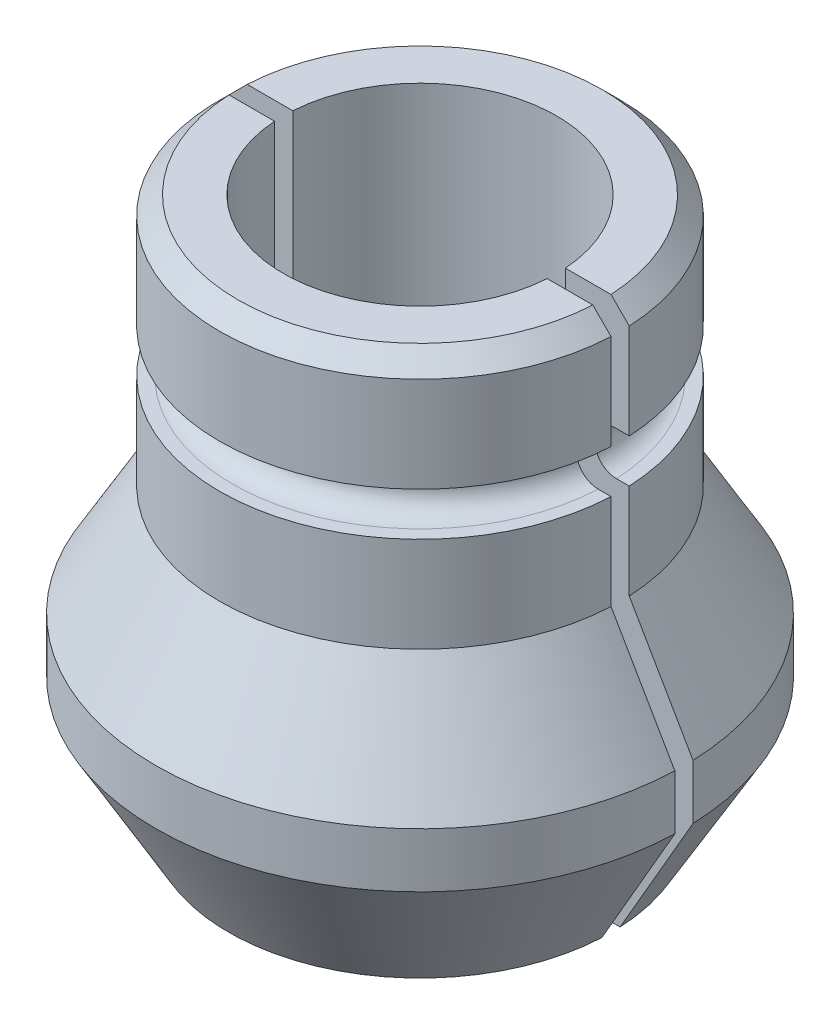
ISO-10303-21;
HEADER;
FILE_DESCRIPTION(('STEP AP214'),'2;1');
FILE_NAME('part.step','',(''),(''),'','','');
FILE_SCHEMA(('AUTOMOTIVE_DESIGN { 1 0 10303 214 1 1 1 1 }'));
ENDSEC;
DATA;
#1=APPLICATION_CONTEXT('core data for automotive mechanical design processes');
#2=APPLICATION_PROTOCOL_DEFINITION('international standard','automotive_design',2000,#1);
#3=PRODUCT_CONTEXT('',#1,'mechanical');
#4=PRODUCT('Part','Part','',(#3));
#5=PRODUCT_RELATED_PRODUCT_CATEGORY('part','',(#4));
#6=PRODUCT_DEFINITION_FORMATION('','',#4);
#7=PRODUCT_DEFINITION_CONTEXT('part definition',#1,'design');
#8=PRODUCT_DEFINITION('design','',#6,#7);
#9=PRODUCT_DEFINITION_SHAPE('','',#8);
#10=(LENGTH_UNIT() NAMED_UNIT(*) SI_UNIT(.MILLI.,.METRE.));
#11=(NAMED_UNIT(*) PLANE_ANGLE_UNIT() SI_UNIT($,.RADIAN.));
#12=(NAMED_UNIT(*) SI_UNIT($,.STERADIAN.) SOLID_ANGLE_UNIT());
#13=UNCERTAINTY_MEASURE_WITH_UNIT(LENGTH_MEASURE(1.E-05),#10,'distance_accuracy_value','');
#14=(GEOMETRIC_REPRESENTATION_CONTEXT(3) GLOBAL_UNCERTAINTY_ASSIGNED_CONTEXT((#13)) GLOBAL_UNIT_ASSIGNED_CONTEXT((#10,
#11,#12)) REPRESENTATION_CONTEXT('',''));
#15=CARTESIAN_POINT('',(0.,0.,0.));
#16=DIRECTION('',(0.,0.,1.));
#17=DIRECTION('',(1.,0.,0.));
#18=AXIS2_PLACEMENT_3D('',#15,#16,#17);
#19=CARTESIAN_POINT('',(0.,0.,0.));
#20=DIRECTION('',(0.,-1.,0.));
#21=DIRECTION('',(0.,0.,-1.));
#22=AXIS2_PLACEMENT_3D('',#19,#20,#21);
#23=CYLINDRICAL_SURFACE('',#22,11.);
#24=CARTESIAN_POINT('',(0.,11.2904639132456,0.));
#25=DIRECTION('',(0.,1.,0.));
#26=DIRECTION('',(0.,0.,1.));
#27=AXIS2_PLACEMENT_3D('',#24,#25,#26);
#28=CIRCLE('',#27,11.);
#29=CARTESIAN_POINT('',(10.988630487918,11.2904639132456,-0.5));
#30=VERTEX_POINT('',#29);
#31=CARTESIAN_POINT('',(-10.988630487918,11.2904639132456,-0.5));
#32=VERTEX_POINT('',#31);
#33=EDGE_CURVE('E222',#30,#32,#28,.T.);
#34=ORIENTED_EDGE('',*,*,#33,.F.);
#35=DIRECTION('',(0.,-1.,0.));
#36=VECTOR('',#35,1.);
#37=CARTESIAN_POINT('',(10.988630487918,0.,-0.5));
#38=LINE('',#37,#36);
#39=CARTESIAN_POINT('',(10.988630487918,6.06217782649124,-0.5));
#40=VERTEX_POINT('',#39);
#41=EDGE_CURVE('E352',#30,#40,#38,.T.);
#42=ORIENTED_EDGE('',*,*,#41,.T.);
#43=CARTESIAN_POINT('',(0.,6.06217782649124,0.));
#44=DIRECTION('',(0.,-1.,0.));
#45=DIRECTION('',(0.,0.,-1.));
#46=AXIS2_PLACEMENT_3D('',#43,#44,#45);
#47=CIRCLE('',#46,11.);
#48=CARTESIAN_POINT('',(-10.988630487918,6.06217782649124,-0.5));
#49=VERTEX_POINT('',#48);
#50=EDGE_CURVE('E213',#49,#40,#47,.T.);
#51=ORIENTED_EDGE('',*,*,#50,.F.);
#52=DIRECTION('',(0.,-1.,0.));
#53=VECTOR('',#52,1.);
#54=CARTESIAN_POINT('',(-10.988630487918,0.,-0.5));
#55=LINE('',#54,#53);
#56=EDGE_CURVE('E354',#49,#32,#55,.F.);
#57=ORIENTED_EDGE('',*,*,#56,.T.);
#58=EDGE_LOOP('',(#34,#42,#51,#57));
#59=FACE_BOUND('',#58,.T.);
#60=ADVANCED_FACE('F48',(#59),#23,.T.);
#61=CARTESIAN_POINT('',(0.,19.9,0.));
#62=DIRECTION('',(0.,-1.,0.));
#63=DIRECTION('',(0.,0.,-1.));
#64=AXIS2_PLACEMENT_3D('',#61,#62,#63);
#65=CONICAL_SURFACE('',#64,10.,0.785398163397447);
#66=CARTESIAN_POINT('',(0.,18.9,0.));
#67=DIRECTION('',(0.,-1.,0.));
#68=DIRECTION('',(0.,0.,-1.));
#69=AXIS2_PLACEMENT_3D('',#66,#67,#68);
#70=CIRCLE('',#69,11.);
#71=CARTESIAN_POINT('',(-10.988630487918,18.9,-0.5));
#72=VERTEX_POINT('',#71);
#73=CARTESIAN_POINT('',(10.988630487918,18.9,-0.5));
#74=VERTEX_POINT('',#73);
#75=EDGE_CURVE('E218',#72,#74,#70,.T.);
#76=ORIENTED_EDGE('',*,*,#75,.F.);
#77=CARTESIAN_POINT('',(-24.2086664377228,5.68617067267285,-0.5));
#78=CARTESIAN_POINT('',(-23.3729459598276,6.52171154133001,-0.5));
#79=CARTESIAN_POINT('',(-22.5372175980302,7.3572445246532,-0.5));
#80=CARTESIAN_POINT('',(-20.8657347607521,9.02828469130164,-0.5));
#81=CARTESIAN_POINT('',(-20.0299802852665,9.8637918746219,-0.5));
#82=CARTESIAN_POINT('',(-18.3584314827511,11.5347738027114,-0.5));
#83=CARTESIAN_POINT('',(-17.5226371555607,12.37024854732,-0.5));
#84=CARTESIAN_POINT('',(-15.8509932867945,14.0411424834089,-0.5));
#85=CARTESIAN_POINT('',(-15.0151437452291,14.8765616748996,-0.5));
#86=CARTESIAN_POINT('',(-13.3430058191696,16.5476626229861,-0.5));
#87=CARTESIAN_POINT('',(-12.5067173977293,17.3833443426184,-0.5));
#88=CARTESIAN_POINT('',(-10.8339791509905,19.0545471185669,-0.5));
#89=CARTESIAN_POINT('',(-9.99752932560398,19.8900681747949,-0.5));
#90=CARTESIAN_POINT('',(-8.32432856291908,21.5608044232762,-0.5));
#91=CARTESIAN_POINT('',(-7.48757762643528,22.3960196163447,-0.5));
#92=CARTESIAN_POINT('',(-6.23182933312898,23.6482180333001,-0.5));
#93=CARTESIAN_POINT('',(-5.81314310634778,24.0655132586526,-0.5));
#94=CARTESIAN_POINT('',(-4.97538293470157,24.8997142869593,-0.5));
#95=CARTESIAN_POINT('',(-4.55630899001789,25.3166200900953,-0.5));
#96=CARTESIAN_POINT('',(-4.02186010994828,25.8472009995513,-0.5));
#97=CARTESIAN_POINT('',(-3.90688517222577,25.961278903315,-0.5));
#98=CARTESIAN_POINT('',(-3.67684539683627,26.1893440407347,-0.5));
#99=CARTESIAN_POINT('',(-3.56178055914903,26.3033312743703,-0.5));
#100=CARTESIAN_POINT('',(-3.21642752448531,26.6451143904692,-0.5));
#101=CARTESIAN_POINT('',(-2.98597144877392,26.872740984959,-0.5));
#102=CARTESIAN_POINT('',(-2.60060473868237,27.2519061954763,-0.5));
#103=CARTESIAN_POINT('',(-2.44593692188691,27.4036915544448,-0.5));
#104=CARTESIAN_POINT('',(-2.13592225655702,27.7065927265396,-0.5));
#105=CARTESIAN_POINT('',(-1.98057535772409,27.8577084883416,-0.5));
#106=CARTESIAN_POINT('',(-1.72019172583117,28.1088236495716,-0.5));
#107=CARTESIAN_POINT('',(-1.6155135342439,28.2091943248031,-0.5));
#108=CARTESIAN_POINT('',(-1.40519118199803,28.408879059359,-0.5));
#109=CARTESIAN_POINT('',(-1.29954722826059,28.5081933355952,-0.5));
#110=CARTESIAN_POINT('',(-1.12160519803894,28.6723040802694,-0.5));
#111=CARTESIAN_POINT('',(-1.04982647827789,28.73766000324,-0.5));
#112=CARTESIAN_POINT('',(-0.941044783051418,28.8344967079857,-0.5));
#113=CARTESIAN_POINT('',(-0.904585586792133,28.8665871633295,-0.5));
#114=CARTESIAN_POINT('',(-0.831175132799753,28.9301990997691,-0.5));
#115=CARTESIAN_POINT('',(-0.794223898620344,28.9617206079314,-0.5));
#116=CARTESIAN_POINT('',(-0.726520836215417,29.0182107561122,-0.5));
#117=CARTESIAN_POINT('',(-0.69588290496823,29.0433154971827,-0.5));
#118=CARTESIAN_POINT('',(-0.634006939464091,29.0927713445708,-0.5));
#119=CARTESIAN_POINT('',(-0.602768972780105,29.1171225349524,-0.5));
#120=CARTESIAN_POINT('',(-0.539479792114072,29.1647430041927,-0.5));
#121=CARTESIAN_POINT('',(-0.507428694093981,29.1880124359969,-0.5));
#122=CARTESIAN_POINT('',(-0.442213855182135,29.2329223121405,-0.5));
#123=CARTESIAN_POINT('',(-0.409050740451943,29.2545636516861,-0.5));
#124=CARTESIAN_POINT('',(-0.342019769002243,29.2947938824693,-0.5));
#125=CARTESIAN_POINT('',(-0.308190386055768,29.3134456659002,-0.5));
#126=CARTESIAN_POINT('',(-0.238614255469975,29.34681958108,-0.5));
#127=CARTESIAN_POINT('',(-0.202870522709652,29.3615476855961,-0.5));
#128=CARTESIAN_POINT('',(-0.13712280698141,29.3822622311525,-0.5));
#129=CARTESIAN_POINT('',(-0.107510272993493,29.3894404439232,-0.5));
#130=CARTESIAN_POINT('',(-0.0475273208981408,29.3986126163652,-0.5));
#131=CARTESIAN_POINT('',(-0.0171592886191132,29.4006212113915,-0.5));
#132=CARTESIAN_POINT('',(0.0434675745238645,29.3990327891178,-0.5));
#133=CARTESIAN_POINT('',(0.073726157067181,29.3954269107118,-0.5));
#134=CARTESIAN_POINT('',(0.133285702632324,29.3833709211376,-0.5));
#135=CARTESIAN_POINT('',(0.162583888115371,29.3749078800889,-0.5));
#136=CARTESIAN_POINT('',(0.22479846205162,29.3526917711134,-0.5));
#137=CARTESIAN_POINT('',(0.257470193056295,29.3382791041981,-0.5));
#138=CARTESIAN_POINT('',(0.321271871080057,29.3063238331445,-0.5));
#139=CARTESIAN_POINT('',(0.352398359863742,29.2887745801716,-0.5));
#140=CARTESIAN_POINT('',(0.413670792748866,29.2515183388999,-0.5));
#141=CARTESIAN_POINT('',(0.443806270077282,29.231794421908,-0.5));
#142=CARTESIAN_POINT('',(0.503107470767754,29.1910180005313,-0.5));
#143=CARTESIAN_POINT('',(0.532274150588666,29.1699668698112,-0.5));
#144=CARTESIAN_POINT('',(0.592956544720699,29.1246627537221,-0.5));
#145=CARTESIAN_POINT('',(0.624394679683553,29.1003065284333,-0.5));
#146=CARTESIAN_POINT('',(0.68664654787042,29.0508062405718,-0.5));
#147=CARTESIAN_POINT('',(0.717460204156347,29.0256620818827,-0.5));
#148=CARTESIAN_POINT('',(0.809232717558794,28.949375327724,-0.5));
#149=CARTESIAN_POINT('',(0.86949644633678,28.8973990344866,-0.5));
#150=CARTESIAN_POINT('',(0.989023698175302,28.7921277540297,-0.5));
#151=CARTESIAN_POINT('',(1.04828541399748,28.7388307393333,-0.5));
#152=CARTESIAN_POINT('',(1.16608338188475,28.6314719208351,-0.5));
#153=CARTESIAN_POINT('',(1.22461981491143,28.5774103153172,-0.5));
#154=CARTESIAN_POINT('',(1.34097067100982,28.469000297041,-0.5));
#155=CARTESIAN_POINT('',(1.39878708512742,28.4146540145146,-0.5));
#156=CARTESIAN_POINT('',(1.51408581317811,28.3056011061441,-0.5));
#157=CARTESIAN_POINT('',(1.57156810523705,28.250894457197,-0.5));
#158=CARTESIAN_POINT('',(1.74353946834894,28.0864991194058,-0.5));
#159=CARTESIAN_POINT('',(1.85766470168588,27.9764301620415,-0.5));
#160=CARTESIAN_POINT('',(2.08496658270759,27.7560962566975,-0.5));
#161=CARTESIAN_POINT('',(2.19814514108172,27.6458332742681,-0.5));
#162=CARTESIAN_POINT('',(2.42414522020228,27.4249418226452,-0.5));
#163=CARTESIAN_POINT('',(2.53696674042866,27.3143133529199,-0.5));
#164=CARTESIAN_POINT('',(2.8750837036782,26.9820671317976,-0.5));
#165=CARTESIAN_POINT('',(3.10002787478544,26.7600921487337,-0.5));
#166=CARTESIAN_POINT('',(3.54952760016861,26.3155797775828,-0.5));
#167=CARTESIAN_POINT('',(3.77408297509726,26.0930422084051,-0.5));
#168=CARTESIAN_POINT('',(4.22290978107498,25.6476840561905,-0.5));
#169=CARTESIAN_POINT('',(4.44718121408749,25.4248634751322,-0.5));
#170=CARTESIAN_POINT('',(4.89575267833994,24.9788386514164,-0.5));
#171=CARTESIAN_POINT('',(5.12005254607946,24.7556342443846,-0.5));
#172=CARTESIAN_POINT('',(5.56853222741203,24.3091040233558,-0.5));
#173=CARTESIAN_POINT('',(5.79271204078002,24.0857782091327,-0.5));
#174=CARTESIAN_POINT('',(6.46507031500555,23.4157312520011,-0.5));
#175=CARTESIAN_POINT('',(6.91312378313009,22.9688846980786,-0.5));
#176=CARTESIAN_POINT('',(8.06442514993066,21.8202301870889,-0.5));
#177=CARTESIAN_POINT('',(8.76754349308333,21.1182924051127,-0.5));
#178=CARTESIAN_POINT('',(10.1735744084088,19.71421046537,-0.5));
#179=CARTESIAN_POINT('',(10.8764869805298,19.0120663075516,-0.5));
#180=CARTESIAN_POINT('',(12.9851330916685,16.9053902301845,-0.5));
#181=CARTESIAN_POINT('',(14.3906990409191,15.5006905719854,-0.5));
#182=CARTESIAN_POINT('',(17.1984199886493,12.6943661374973,-0.5));
#183=CARTESIAN_POINT('',(18.6005753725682,11.2927417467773,-0.5));
#184=CARTESIAN_POINT('',(21.4047136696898,8.48947281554,-0.5));
#185=CARTESIAN_POINT('',(22.8066965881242,7.08782828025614,-0.5));
#186=CARTESIAN_POINT('',(24.2086664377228,5.68617067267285,-0.5));
#187=B_SPLINE_CURVE_WITH_KNOTS('',3,(#77,#78,#79,#80,#81,#82,#83,#84,#85,#86,#87,#88,#89,#90,
#91,#92,#93,#94,#95,#96,#97,#98,#99,#100,#101,#102,#103,#104,#105,#106,#107,#108,#109,#110,#111,
#112,#113,#114,#115,#116,#117,#118,#119,#120,#121,#122,#123,#124,#125,#126,#127,#128,#129,#130,
#131,#132,#133,#134,#135,#136,#137,#138,#139,#140,#141,#142,#143,#144,#145,#146,#147,#148,#149,
#150,#151,#152,#153,#154,#155,#156,#157,#158,#159,#160,#161,#162,#163,#164,#165,#166,#167,#168,
#169,#170,#171,#172,#173,#174,#175,#176,#177,#178,#179,#180,#181,#182,#183,#184,#185,#186),
.UNSPECIFIED.,.F.,.F.,(4,2,2,2,2,2,2,2,2,2,2,2,2,2,2,2,2,2,2,2,2,2,2,2,2,2,2,2,2,2,2,2,2,2,2,2,
2,2,2,2,2,2,2,2,2,2,2,2,2,2,2,2,2,2,4),(0.,3.54528071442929,7.09056210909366,10.6358592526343,
14.1811557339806,17.7279402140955,21.2747266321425,24.8215035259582,26.5948904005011,
28.3682764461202,28.8541745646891,29.3400727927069,30.3118296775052,30.9619431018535,
31.6121055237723,32.0471726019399,32.4821485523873,32.7733571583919,32.9190640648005,
33.0647640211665,33.1835851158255,33.3023929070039,33.421183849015,33.5399089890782,
33.6556595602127,33.7712329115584,33.8622825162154,33.953074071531,34.0440090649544,
34.1351872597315,34.2420513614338,34.3491447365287,34.4571401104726,34.5650254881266,
34.684314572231,34.8036182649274,35.0423266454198,35.2814274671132,35.5204673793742,
35.7585123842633,35.9965728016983,36.4722340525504,36.9462646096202,37.420295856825,
38.3683737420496,39.3168105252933,40.2652407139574,41.2145434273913,42.163847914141,
44.062219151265,47.042794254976,50.0233701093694,55.9848439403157,61.9325591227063,
67.8799511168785),.UNSPECIFIED.);
#188=CARTESIAN_POINT('',(-9.98749217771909,19.9,-0.5));
#189=VERTEX_POINT('',#188);
#190=EDGE_CURVE('E185',#72,#189,#187,.T.);
#191=ORIENTED_EDGE('',*,*,#190,.T.);
#192=CARTESIAN_POINT('',(0.,19.9,0.));
#193=DIRECTION('',(0.,-1.,0.));
#194=DIRECTION('',(0.,0.,-1.));
#195=AXIS2_PLACEMENT_3D('',#192,#193,#194);
#196=CIRCLE('',#195,10.);
#197=CARTESIAN_POINT('',(9.98749217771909,19.9,-0.5));
#198=VERTEX_POINT('',#197);
#199=EDGE_CURVE('E175',#189,#198,#196,.T.);
#200=ORIENTED_EDGE('',*,*,#199,.T.);
#201=EDGE_CURVE('E180',#198,#74,#187,.T.);
#202=ORIENTED_EDGE('',*,*,#201,.T.);
#203=EDGE_LOOP('',(#76,#191,#200,#202));
#204=FACE_BOUND('',#203,.T.);
#205=ADVANCED_FACE('F50',(#204),#65,.T.);
#206=CARTESIAN_POINT('',(0.,19.9,0.));
#207=DIRECTION('',(0.,-1.,0.));
#208=DIRECTION('',(0.,0.,-1.));
#209=AXIS2_PLACEMENT_3D('',#206,#207,#208);
#210=PLANE('',#209);
#211=ORIENTED_EDGE('',*,*,#199,.F.);
#212=DIRECTION('',(-1.,0.,0.));
#213=VECTOR('',#212,1.);
#214=CARTESIAN_POINT('',(-14.5,19.9,-0.5));
#215=LINE('',#214,#213);
#216=CARTESIAN_POINT('',(-7.48331477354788,19.9,-0.5));
#217=VERTEX_POINT('',#216);
#218=EDGE_CURVE('E61',#217,#189,#215,.T.);
#219=ORIENTED_EDGE('',*,*,#218,.F.);
#220=CARTESIAN_POINT('',(0.,19.9,0.));
#221=DIRECTION('',(0.,-1.,0.));
#222=DIRECTION('',(0.,0.,-1.));
#223=AXIS2_PLACEMENT_3D('',#220,#221,#222);
#224=CIRCLE('',#223,7.5);
#225=CARTESIAN_POINT('',(7.48331477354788,19.9,-0.5));
#226=VERTEX_POINT('',#225);
#227=EDGE_CURVE('E173',#217,#226,#224,.T.);
#228=ORIENTED_EDGE('',*,*,#227,.T.);
#229=EDGE_CURVE('E13',#198,#226,#215,.T.);
#230=ORIENTED_EDGE('',*,*,#229,.F.);
#231=EDGE_LOOP('',(#211,#219,#228,#230));
#232=FACE_BOUND('',#231,.T.);
#233=ADVANCED_FACE('F171',(#232),#210,.F.);
#234=CARTESIAN_POINT('',(0.,0.,0.));
#235=DIRECTION('',(0.,-1.,0.));
#236=DIRECTION('',(0.,0.,-1.));
#237=AXIS2_PLACEMENT_3D('',#234,#235,#236);
#238=CYLINDRICAL_SURFACE('',#237,7.5);
#239=CARTESIAN_POINT('',(0.,6.06217782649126,0.));
#240=DIRECTION('',(0.,-1.,0.));
#241=DIRECTION('',(0.,0.,-1.));
#242=AXIS2_PLACEMENT_3D('',#239,#240,#241);
#243=CIRCLE('',#242,7.49999999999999);
#244=CARTESIAN_POINT('',(-7.48331477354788,6.06217782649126,-0.5));
#245=VERTEX_POINT('',#244);
#246=CARTESIAN_POINT('',(7.48331477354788,6.06217782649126,-0.5));
#247=VERTEX_POINT('',#246);
#248=EDGE_CURVE('E179',#245,#247,#243,.T.);
#249=ORIENTED_EDGE('',*,*,#248,.T.);
#250=DIRECTION('',(0.,-1.,0.));
#251=VECTOR('',#250,1.);
#252=CARTESIAN_POINT('',(7.48331477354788,0.,-0.5));
#253=LINE('',#252,#251);
#254=EDGE_CURVE('E68',#247,#226,#253,.F.);
#255=ORIENTED_EDGE('',*,*,#254,.T.);
#256=ORIENTED_EDGE('',*,*,#227,.F.);
#257=DIRECTION('',(0.,-1.,0.));
#258=VECTOR('',#257,1.);
#259=CARTESIAN_POINT('',(-7.48331477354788,0.,-0.5));
#260=LINE('',#259,#258);
#261=EDGE_CURVE('E156',#217,#245,#260,.T.);
#262=ORIENTED_EDGE('',*,*,#261,.T.);
#263=EDGE_LOOP('',(#249,#255,#256,#262));
#264=FACE_BOUND('',#263,.T.);
#265=ADVANCED_FACE('F178',(#264),#238,.F.);
#266=CARTESIAN_POINT('',(0.,0.,0.));
#267=DIRECTION('',(0.,-1.,0.));
#268=DIRECTION('',(0.,0.,-1.));
#269=AXIS2_PLACEMENT_3D('',#266,#267,#268);
#270=CONICAL_SURFACE('',#269,11.,0.523598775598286);
#271=CARTESIAN_POINT('',(0.,0.,0.));
#272=DIRECTION('',(0.,-1.,0.));
#273=DIRECTION('',(0.,0.,-1.));
#274=AXIS2_PLACEMENT_3D('',#271,#272,#273);
#275=CIRCLE('',#274,11.);
#276=CARTESIAN_POINT('',(-10.988630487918,0.,-0.5));
#277=VERTEX_POINT('',#276);
#278=CARTESIAN_POINT('',(10.988630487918,0.,-0.5));
#279=VERTEX_POINT('',#278);
#280=EDGE_CURVE('E166',#277,#279,#275,.T.);
#281=ORIENTED_EDGE('',*,*,#280,.T.);
#282=CARTESIAN_POINT('',(18.8985640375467,-13.6921684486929,-0.5));
#283=CARTESIAN_POINT('',(17.8479578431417,-11.8731267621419,-0.5));
#284=CARTESIAN_POINT('',(16.7973265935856,-10.0540995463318,-0.5));
#285=CARTESIAN_POINT('',(14.6958968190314,-6.41613758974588,-0.5));
#286=CARTESIAN_POINT('',(13.64509829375,-4.59720284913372,-0.5));
#287=CARTESIAN_POINT('',(11.5432863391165,-0.959609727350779,-0.5));
#288=CARTESIAN_POINT('',(10.4922729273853,0.859048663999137,-0.5));
#289=CARTESIAN_POINT('',(8.9152302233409,3.58673230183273,-0.5));
#290=CARTESIAN_POINT('',(8.38946261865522,4.4959088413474,-0.5));
#291=CARTESIAN_POINT('',(7.33762363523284,6.31408617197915,-0.5));
#292=CARTESIAN_POINT('',(6.81155225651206,7.22308696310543,-0.5));
#293=CARTESIAN_POINT('',(6.02206013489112,8.58621460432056,-0.5));
#294=CARTESIAN_POINT('',(5.75886460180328,9.04047188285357,-0.5));
#295=CARTESIAN_POINT('',(5.2322445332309,9.94885555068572,-0.5));
#296=CARTESIAN_POINT('',(4.96881999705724,10.4029819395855,-0.5));
#297=CARTESIAN_POINT('',(4.44160033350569,11.3110396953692,-0.5));
#298=CARTESIAN_POINT('',(4.17780519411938,11.7649710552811,-0.5));
#299=CARTESIAN_POINT('',(3.64960872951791,12.6724758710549,-0.5));
#300=CARTESIAN_POINT('',(3.38520740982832,13.1260493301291,-0.5));
#301=CARTESIAN_POINT('',(2.98769498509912,13.8058753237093,-0.5));
#302=CARTESIAN_POINT('',(2.85503953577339,14.0323942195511,-0.5));
#303=CARTESIAN_POINT('',(2.58926199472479,14.4851661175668,-0.5));
#304=CARTESIAN_POINT('',(2.45613989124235,14.7114191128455,-0.5));
#305=CARTESIAN_POINT('',(2.18916153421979,15.1634814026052,-0.5));
#306=CARTESIAN_POINT('',(2.0553053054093,15.3892907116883,-0.5));
#307=CARTESIAN_POINT('',(1.78635048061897,15.8401483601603,-0.5));
#308=CARTESIAN_POINT('',(1.65125197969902,16.0651967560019,-0.5));
#309=CARTESIAN_POINT('',(1.44673839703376,16.401554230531,-0.5));
#310=CARTESIAN_POINT('',(1.3782750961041,16.5134406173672,-0.5));
#311=CARTESIAN_POINT('',(1.24034637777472,16.7366246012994,-0.5));
#312=CARTESIAN_POINT('',(1.17088076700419,16.8479220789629,-0.5));
#313=CARTESIAN_POINT('',(1.03031105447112,17.0696264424,-0.5));
#314=CARTESIAN_POINT('',(0.959205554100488,17.1800324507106,-0.5));
#315=CARTESIAN_POINT('',(0.850384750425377,17.3441859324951,-0.5));
#316=CARTESIAN_POINT('',(0.813756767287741,17.3986525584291,-0.5));
#317=CARTESIAN_POINT('',(0.739457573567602,17.5068676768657,-0.5));
#318=CARTESIAN_POINT('',(0.701786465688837,17.5606162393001,-0.5));
#319=CARTESIAN_POINT('',(0.641240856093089,17.6443522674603,-0.5));
#320=CARTESIAN_POINT('',(0.618891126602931,17.6747184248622,-0.5));
#321=CARTESIAN_POINT('',(0.57350893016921,17.7349487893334,-0.5));
#322=CARTESIAN_POINT('',(0.55047632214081,17.7648128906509,-0.5));
#323=CARTESIAN_POINT('',(0.503573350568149,17.8237472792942,-0.5));
#324=CARTESIAN_POINT('',(0.479705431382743,17.8528195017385,-0.5));
#325=CARTESIAN_POINT('',(0.430748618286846,17.9099106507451,-0.5));
#326=CARTESIAN_POINT('',(0.405660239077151,17.9379300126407,-0.5));
#327=CARTESIAN_POINT('',(0.358743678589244,17.9870748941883,-0.5));
#328=CARTESIAN_POINT('',(0.337219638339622,18.00848793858,-0.5));
#329=CARTESIAN_POINT('',(0.292528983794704,18.049741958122,-0.5));
#330=CARTESIAN_POINT('',(0.269356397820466,18.0695766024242,-0.5));
#331=CARTESIAN_POINT('',(0.220495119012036,18.1068466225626,-0.5));
#332=CARTESIAN_POINT('',(0.194771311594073,18.1242371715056,-0.5));
#333=CARTESIAN_POINT('',(0.140603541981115,18.1540176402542,-0.5));
#334=CARTESIAN_POINT('',(0.112182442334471,18.1664456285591,-0.5));
#335=CARTESIAN_POINT('',(0.0660803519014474,18.1794585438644,-0.5));
#336=CARTESIAN_POINT('',(0.0492090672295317,18.1828503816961,-0.5));
#337=CARTESIAN_POINT('',(0.0151305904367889,18.1866352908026,-0.5));
#338=CARTESIAN_POINT('',(-0.0020763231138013,18.1870307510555,-0.5));
#339=CARTESIAN_POINT('',(-0.0362594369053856,18.1847639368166,-0.5));
#340=CARTESIAN_POINT('',(-0.0532358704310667,18.182105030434,-0.5));
#341=CARTESIAN_POINT('',(-0.0865479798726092,18.1741220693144,-0.5));
#342=CARTESIAN_POINT('',(-0.10288274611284,18.1687943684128,-0.5));
#343=CARTESIAN_POINT('',(-0.144782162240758,18.15202516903,-0.5));
#344=CARTESIAN_POINT('',(-0.169638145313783,18.1388487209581,-0.5));
#345=CARTESIAN_POINT('',(-0.217245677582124,18.10911068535,-0.5));
#346=CARTESIAN_POINT('',(-0.239987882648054,18.0925350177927,-0.5));
#347=CARTESIAN_POINT('',(-0.280643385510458,18.0598551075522,-0.5));
#348=CARTESIAN_POINT('',(-0.298781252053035,18.0440247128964,-0.5));
#349=CARTESIAN_POINT('',(-0.33409273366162,18.0113153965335,-0.5));
#350=CARTESIAN_POINT('',(-0.35126580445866,17.9944358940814,-0.5));
#351=CARTESIAN_POINT('',(-0.401733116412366,17.9426304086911,-0.5));
#352=CARTESIAN_POINT('',(-0.433893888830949,17.906607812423,-0.5));
#353=CARTESIAN_POINT('',(-0.496481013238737,17.8327558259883,-0.5));
#354=CARTESIAN_POINT('',(-0.526895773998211,17.7949168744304,-0.5));
#355=CARTESIAN_POINT('',(-0.586365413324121,17.7182804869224,-0.5));
#356=CARTESIAN_POINT('',(-0.615422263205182,17.6794845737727,-0.5));
#357=CARTESIAN_POINT('',(-0.700336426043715,17.5633349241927,-0.5));
#358=CARTESIAN_POINT('',(-0.75488993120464,17.4850343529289,-0.5));
#359=CARTESIAN_POINT('',(-0.862065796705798,17.3271155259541,-0.5));
#360=CARTESIAN_POINT('',(-0.914687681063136,17.2474969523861,-0.5));
#361=CARTESIAN_POINT('',(-1.01876752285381,17.0873758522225,-0.5));
#362=CARTESIAN_POINT('',(-1.07022409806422,17.0068724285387,-0.5));
#363=CARTESIAN_POINT('',(-1.1723196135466,16.8453631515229,-0.5));
#364=CARTESIAN_POINT('',(-1.22295864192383,16.7643573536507,-0.5));
#365=CARTESIAN_POINT('',(-1.32342206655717,16.602388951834,-0.5));
#366=CARTESIAN_POINT('',(-1.37324923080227,16.5214280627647,-0.5));
#367=CARTESIAN_POINT('',(-1.47249295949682,16.3592523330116,-0.5));
#368=CARTESIAN_POINT('',(-1.52190951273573,16.2780374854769,-0.5));
#369=CARTESIAN_POINT('',(-1.66964566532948,16.0342071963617,-0.5));
#370=CARTESIAN_POINT('',(-1.76750794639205,15.8713148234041,-0.5));
#371=CARTESIAN_POINT('',(-1.96239732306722,15.5452620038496,-0.5));
#372=CARTESIAN_POINT('',(-2.05942518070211,15.3821020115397,-0.5));
#373=CARTESIAN_POINT('',(-2.2529946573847,15.0554936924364,-0.5));
#374=CARTESIAN_POINT('',(-2.34953627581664,14.8920453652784,-0.5));
#375=CARTESIAN_POINT('',(-2.63867061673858,14.401407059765,-0.5));
#376=CARTESIAN_POINT('',(-2.83077086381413,14.073927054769,-0.5));
#377=CARTESIAN_POINT('',(-3.21432261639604,13.4184876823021,-0.5));
#378=CARTESIAN_POINT('',(-3.40577396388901,13.090528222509,-0.5));
#379=CARTESIAN_POINT('',(-3.78825282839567,12.4343644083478,-0.5));
#380=CARTESIAN_POINT('',(-3.97928034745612,12.1061600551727,-0.5));
#381=CARTESIAN_POINT('',(-4.36143314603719,11.4489575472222,-0.5));
#382=CARTESIAN_POINT('',(-4.55255789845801,11.1199590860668,-0.5));
#383=CARTESIAN_POINT('',(-4.93462004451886,10.4618528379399,-0.5));
#384=CARTESIAN_POINT('',(-5.12555743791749,10.1327450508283,-0.5));
#385=CARTESIAN_POINT('',(-5.69814331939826,9.14535770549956,-0.5));
#386=CARTESIAN_POINT('',(-6.0795947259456,8.48696387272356,-0.5));
#387=CARTESIAN_POINT('',(-6.98094403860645,6.93043273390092,-0.5));
#388=CARTESIAN_POINT('',(-7.50071856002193,6.03222399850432,-0.5));
#389=CARTESIAN_POINT('',(-8.53998520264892,4.23564297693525,-0.5));
#390=CARTESIAN_POINT('',(-9.0594773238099,3.33727069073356,-0.5));
#391=CARTESIAN_POINT('',(-10.6177426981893,0.64195427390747,-0.5));
#392=CARTESIAN_POINT('',(-11.6562713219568,-1.15513127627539,-0.5));
#393=CARTESIAN_POINT('',(-13.7288599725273,-4.74219032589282,-0.5));
#394=CARTESIAN_POINT('',(-14.7629210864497,-6.53216319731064,-0.5));
#395=CARTESIAN_POINT('',(-16.8308511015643,-10.1121420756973,-0.5));
#396=CARTESIAN_POINT('',(-17.8647200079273,-11.9021480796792,-0.5));
#397=CARTESIAN_POINT('',(-18.8985640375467,-13.6921684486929,-0.5));
#398=B_SPLINE_CURVE_WITH_KNOTS('',3,(#282,#283,#284,#285,#286,#287,#288,#289,#290,#291,#292,
#293,#294,#295,#296,#297,#298,#299,#300,#301,#302,#303,#304,#305,#306,#307,#308,#309,#310,#311,
#312,#313,#314,#315,#316,#317,#318,#319,#320,#321,#322,#323,#324,#325,#326,#327,#328,#329,#330,
#331,#332,#333,#334,#335,#336,#337,#338,#339,#340,#341,#342,#343,#344,#345,#346,#347,#348,#349,
#350,#351,#352,#353,#354,#355,#356,#357,#358,#359,#360,#361,#362,#363,#364,#365,#366,#367,#368,
#369,#370,#371,#372,#373,#374,#375,#376,#377,#378,#379,#380,#381,#382,#383,#384,#385,#386,#387,
#388,#389,#390,#391,#392,#393,#394,#395,#396,#397),.UNSPECIFIED.,.F.,.F.,(4,2,2,2,2,2,2,2,2,2,2,
2,2,2,2,2,2,2,2,2,2,2,2,2,2,2,2,2,2,2,2,2,2,2,2,2,2,2,2,2,2,2,2,2,2,2,2,2,2,2,2,2,2,2,2,2,2,4),
(0.,6.3019182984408,12.6038473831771,18.9053810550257,22.056143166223,25.2069051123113,
26.7818952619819,28.3568901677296,29.9319373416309,31.5069702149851,32.2944815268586,
33.0820128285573,33.8695177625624,34.6569629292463,35.0504716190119,35.4440572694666,
35.8379920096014,36.034896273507,36.2317812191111,36.3448874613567,36.4580172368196,
36.5708398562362,36.6836153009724,36.7746454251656,36.8660239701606,36.9589054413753,
37.0510600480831,37.1024543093,37.1538075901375,37.2051042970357,37.2564712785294,
37.3403805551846,37.42464468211,37.4968136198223,37.5690228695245,37.7137631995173,
37.8593738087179,38.0047660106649,38.2909949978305,38.5772940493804,38.8639165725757,
39.1505079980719,39.4357021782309,39.7209041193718,40.2909866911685,40.8604770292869,
41.4299680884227,42.5689617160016,43.7082152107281,44.847463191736,45.9889174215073,
47.1303731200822,49.4131100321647,52.5263880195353,55.6396665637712,61.8664251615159,
68.0680029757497,74.2693784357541),.UNSPECIFIED.);
#399=EDGE_CURVE('E191',#279,#247,#398,.T.);
#400=ORIENTED_EDGE('',*,*,#399,.T.);
#401=ORIENTED_EDGE('',*,*,#248,.F.);
#402=EDGE_CURVE('E161',#245,#277,#398,.T.);
#403=ORIENTED_EDGE('',*,*,#402,.T.);
#404=EDGE_LOOP('',(#281,#400,#401,#403));
#405=FACE_BOUND('',#404,.T.);
#406=ADVANCED_FACE('F256',(#405),#270,.F.);
#407=CARTESIAN_POINT('',(0.,0.,0.));
#408=DIRECTION('',(0.,-1.,0.));
#409=DIRECTION('',(0.,0.,-1.));
#410=AXIS2_PLACEMENT_3D('',#407,#408,#409);
#411=CYLINDRICAL_SURFACE('',#410,11.);
#412=CARTESIAN_POINT('',(0.,-3.,0.));
#413=DIRECTION('',(0.,-1.,0.));
#414=DIRECTION('',(0.,0.,-1.));
#415=AXIS2_PLACEMENT_3D('',#412,#413,#414);
#416=CIRCLE('',#415,11.);
#417=CARTESIAN_POINT('',(-10.988630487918,-3.,-0.5));
#418=VERTEX_POINT('',#417);
#419=CARTESIAN_POINT('',(10.988630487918,-3.,-0.5));
#420=VERTEX_POINT('',#419);
#421=EDGE_CURVE('E192',#418,#420,#416,.T.);
#422=ORIENTED_EDGE('',*,*,#421,.T.);
#423=DIRECTION('',(0.,-1.,0.));
#424=VECTOR('',#423,1.);
#425=CARTESIAN_POINT('',(10.988630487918,0.,-0.5));
#426=LINE('',#425,#424);
#427=EDGE_CURVE('E195',#420,#279,#426,.F.);
#428=ORIENTED_EDGE('',*,*,#427,.T.);
#429=ORIENTED_EDGE('',*,*,#280,.F.);
#430=DIRECTION('',(0.,-1.,0.));
#431=VECTOR('',#430,1.);
#432=CARTESIAN_POINT('',(-10.988630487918,0.,-0.5));
#433=LINE('',#432,#431);
#434=EDGE_CURVE('E200',#277,#418,#433,.T.);
#435=ORIENTED_EDGE('',*,*,#434,.T.);
#436=EDGE_LOOP('',(#422,#428,#429,#435));
#437=FACE_BOUND('',#436,.T.);
#438=ADVANCED_FACE('F316',(#437),#411,.F.);
#439=CARTESIAN_POINT('',(0.,-3.,0.));
#440=DIRECTION('',(0.,1.,0.));
#441=DIRECTION('',(0.,0.,1.));
#442=AXIS2_PLACEMENT_3D('',#439,#440,#441);
#443=CONICAL_SURFACE('',#442,11.,0.523598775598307);
#444=CARTESIAN_POINT('',(18.8985640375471,10.6921684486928,-0.5));
#445=CARTESIAN_POINT('',(17.847957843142,8.8731267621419,-0.5));
#446=CARTESIAN_POINT('',(16.7973265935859,7.05409954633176,-0.5));
#447=CARTESIAN_POINT('',(14.6958968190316,3.41613758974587,-0.5));
#448=CARTESIAN_POINT('',(13.6450982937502,1.59720284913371,-0.5));
#449=CARTESIAN_POINT('',(11.5432863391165,-2.04039027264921,-0.5));
#450=CARTESIAN_POINT('',(10.4922729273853,-3.85904866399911,-0.5));
#451=CARTESIAN_POINT('',(8.91523022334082,-6.58673230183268,-0.5));
#452=CARTESIAN_POINT('',(8.38946261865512,-7.49590884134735,-0.5));
#453=CARTESIAN_POINT('',(7.3376236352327,-9.31408617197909,-0.5));
#454=CARTESIAN_POINT('',(6.81155225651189,-10.2230869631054,-0.5));
#455=CARTESIAN_POINT('',(6.02206013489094,-11.5862146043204,-0.5));
#456=CARTESIAN_POINT('',(5.7588646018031,-12.0404718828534,-0.5));
#457=CARTESIAN_POINT('',(5.23224453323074,-12.9488555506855,-0.5));
#458=CARTESIAN_POINT('',(4.96881999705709,-13.4029819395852,-0.5));
#459=CARTESIAN_POINT('',(4.44160033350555,-14.3110396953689,-0.5));
#460=CARTESIAN_POINT('',(4.17780519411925,-14.7649710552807,-0.5));
#461=CARTESIAN_POINT('',(3.6496087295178,-15.6724758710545,-0.5));
#462=CARTESIAN_POINT('',(3.38520740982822,-16.1260493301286,-0.5));
#463=CARTESIAN_POINT('',(2.98769498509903,-16.8058753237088,-0.5));
#464=CARTESIAN_POINT('',(2.8550395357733,-17.0323942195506,-0.5));
#465=CARTESIAN_POINT('',(2.58926199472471,-17.4851661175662,-0.5));
#466=CARTESIAN_POINT('',(2.45613989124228,-17.7114191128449,-0.5));
#467=CARTESIAN_POINT('',(2.18916153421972,-18.1634814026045,-0.5));
#468=CARTESIAN_POINT('',(2.05530530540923,-18.3892907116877,-0.5));
#469=CARTESIAN_POINT('',(1.78635048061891,-18.8401483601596,-0.5));
#470=CARTESIAN_POINT('',(1.65125197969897,-19.0651967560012,-0.5));
#471=CARTESIAN_POINT('',(1.44673839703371,-19.4015542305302,-0.5));
#472=CARTESIAN_POINT('',(1.37827509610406,-19.5134406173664,-0.5));
#473=CARTESIAN_POINT('',(1.24034637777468,-19.7366246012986,-0.5));
#474=CARTESIAN_POINT('',(1.17088076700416,-19.8479220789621,-0.5));
#475=CARTESIAN_POINT('',(1.03031105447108,-20.0696264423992,-0.5));
#476=CARTESIAN_POINT('',(0.959205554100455,-20.1800324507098,-0.5));
#477=CARTESIAN_POINT('',(0.850384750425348,-20.3441859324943,-0.5));
#478=CARTESIAN_POINT('',(0.813756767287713,-20.3986525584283,-0.5));
#479=CARTESIAN_POINT('',(0.739457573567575,-20.5068676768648,-0.5));
#480=CARTESIAN_POINT('',(0.701786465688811,-20.5606162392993,-0.5));
#481=CARTESIAN_POINT('',(0.641240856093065,-20.6443522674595,-0.5));
#482=CARTESIAN_POINT('',(0.618891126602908,-20.6747184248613,-0.5));
#483=CARTESIAN_POINT('',(0.57350893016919,-20.7349487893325,-0.5));
#484=CARTESIAN_POINT('',(0.550476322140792,-20.7648128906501,-0.5));
#485=CARTESIAN_POINT('',(0.503573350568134,-20.8237472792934,-0.5));
#486=CARTESIAN_POINT('',(0.479705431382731,-20.8528195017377,-0.5));
#487=CARTESIAN_POINT('',(0.430748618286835,-20.9099106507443,-0.5));
#488=CARTESIAN_POINT('',(0.40566023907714,-20.9379300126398,-0.5));
#489=CARTESIAN_POINT('',(0.358743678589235,-20.9870748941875,-0.5));
#490=CARTESIAN_POINT('',(0.337219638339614,-21.0084879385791,-0.5));
#491=CARTESIAN_POINT('',(0.292528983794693,-21.0497419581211,-0.5));
#492=CARTESIAN_POINT('',(0.26935639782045,-21.0695766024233,-0.5));
#493=CARTESIAN_POINT('',(0.220495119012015,-21.1068466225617,-0.5));
#494=CARTESIAN_POINT('',(0.194771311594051,-21.1242371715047,-0.5));
#495=CARTESIAN_POINT('',(0.140603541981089,-21.1540176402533,-0.5));
#496=CARTESIAN_POINT('',(0.112182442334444,-21.1664456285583,-0.5));
#497=CARTESIAN_POINT('',(0.0660803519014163,-21.1794585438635,-0.5));
#498=CARTESIAN_POINT('',(0.0492090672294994,-21.1828503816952,-0.5));
#499=CARTESIAN_POINT('',(0.0151305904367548,-21.1866352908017,-0.5));
#500=CARTESIAN_POINT('',(-0.00207632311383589,-21.1870307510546,-0.5));
#501=CARTESIAN_POINT('',(-0.0362594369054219,-21.1847639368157,-0.5));
#502=CARTESIAN_POINT('',(-0.0532358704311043,-21.1821050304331,-0.5));
#503=CARTESIAN_POINT('',(-0.0865479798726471,-21.1741220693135,-0.5));
#504=CARTESIAN_POINT('',(-0.102882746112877,-21.1687943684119,-0.5));
#505=CARTESIAN_POINT('',(-0.144782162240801,-21.152025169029,-0.5));
#506=CARTESIAN_POINT('',(-0.169638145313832,-21.1388487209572,-0.5));
#507=CARTESIAN_POINT('',(-0.217245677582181,-21.109110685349,-0.5));
#508=CARTESIAN_POINT('',(-0.239987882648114,-21.0925350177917,-0.5));
#509=CARTESIAN_POINT('',(-0.28064338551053,-21.0598551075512,-0.5));
#510=CARTESIAN_POINT('',(-0.298781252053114,-21.0440247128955,-0.5));
#511=CARTESIAN_POINT('',(-0.334092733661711,-21.0113153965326,-0.5));
#512=CARTESIAN_POINT('',(-0.351265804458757,-20.9944358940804,-0.5));
#513=CARTESIAN_POINT('',(-0.401733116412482,-20.9426304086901,-0.5));
#514=CARTESIAN_POINT('',(-0.43389388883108,-20.906607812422,-0.5));
#515=CARTESIAN_POINT('',(-0.496481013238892,-20.8327558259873,-0.5));
#516=CARTESIAN_POINT('',(-0.526895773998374,-20.7949168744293,-0.5));
#517=CARTESIAN_POINT('',(-0.586365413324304,-20.7182804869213,-0.5));
#518=CARTESIAN_POINT('',(-0.615422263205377,-20.6794845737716,-0.5));
#519=CARTESIAN_POINT('',(-0.700336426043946,-20.5633349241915,-0.5));
#520=CARTESIAN_POINT('',(-0.754889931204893,-20.4850343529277,-0.5));
#521=CARTESIAN_POINT('',(-0.862065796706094,-20.3271155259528,-0.5));
#522=CARTESIAN_POINT('',(-0.914687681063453,-20.2474969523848,-0.5));
#523=CARTESIAN_POINT('',(-1.01876752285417,-20.0873758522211,-0.5));
#524=CARTESIAN_POINT('',(-1.0702240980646,-20.0068724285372,-0.5));
#525=CARTESIAN_POINT('',(-1.17231961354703,-19.8453631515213,-0.5));
#526=CARTESIAN_POINT('',(-1.22295864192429,-19.7643573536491,-0.5));
#527=CARTESIAN_POINT('',(-1.32342206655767,-19.6023889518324,-0.5));
#528=CARTESIAN_POINT('',(-1.37324923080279,-19.5214280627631,-0.5));
#529=CARTESIAN_POINT('',(-1.47249295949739,-19.3592523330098,-0.5));
#530=CARTESIAN_POINT('',(-1.52190951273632,-19.2780374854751,-0.5));
#531=CARTESIAN_POINT('',(-1.66964566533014,-19.0342071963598,-0.5));
#532=CARTESIAN_POINT('',(-1.76750794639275,-18.8713148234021,-0.5));
#533=CARTESIAN_POINT('',(-1.96239732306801,-18.5452620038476,-0.5));
#534=CARTESIAN_POINT('',(-2.05942518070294,-18.3821020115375,-0.5));
#535=CARTESIAN_POINT('',(-2.25299465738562,-18.0554936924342,-0.5));
#536=CARTESIAN_POINT('',(-2.3495362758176,-17.892045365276,-0.5));
#537=CARTESIAN_POINT('',(-2.63867061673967,-17.4014070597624,-0.5));
#538=CARTESIAN_POINT('',(-2.83077086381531,-17.0739270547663,-0.5));
#539=CARTESIAN_POINT('',(-3.2143226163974,-16.4184876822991,-0.5));
#540=CARTESIAN_POINT('',(-3.40577396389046,-16.0905282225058,-0.5));
#541=CARTESIAN_POINT('',(-3.78825282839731,-15.4343644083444,-0.5));
#542=CARTESIAN_POINT('',(-3.97928034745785,-15.1061600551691,-0.5));
#543=CARTESIAN_POINT('',(-4.3614331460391,-14.4489575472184,-0.5));
#544=CARTESIAN_POINT('',(-4.55255789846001,-14.1199590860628,-0.5));
#545=CARTESIAN_POINT('',(-4.93462004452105,-13.4618528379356,-0.5));
#546=CARTESIAN_POINT('',(-5.12555743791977,-13.1327450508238,-0.5));
#547=CARTESIAN_POINT('',(-5.69814331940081,-12.1453577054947,-0.5));
#548=CARTESIAN_POINT('',(-6.07959472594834,-11.4869638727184,-0.5));
#549=CARTESIAN_POINT('',(-6.98094403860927,-9.93043273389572,-0.5));
#550=CARTESIAN_POINT('',(-7.50071856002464,-9.03222399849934,-0.5));
#551=CARTESIAN_POINT('',(-8.53998520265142,-7.23564297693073,-0.5));
#552=CARTESIAN_POINT('',(-9.05947732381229,-6.33727069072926,-0.5));
#553=CARTESIAN_POINT('',(-10.6177426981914,-3.64195427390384,-0.5));
#554=CARTESIAN_POINT('',(-11.6562713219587,-1.84486872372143,-0.5));
#555=CARTESIAN_POINT('',(-13.7288599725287,1.74219032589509,-0.5));
#556=CARTESIAN_POINT('',(-14.762921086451,3.53216319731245,-0.5));
#557=CARTESIAN_POINT('',(-16.8308511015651,7.11214207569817,-0.5));
#558=CARTESIAN_POINT('',(-17.8647200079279,8.90214807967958,-0.5));
#559=CARTESIAN_POINT('',(-18.8985640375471,10.6921684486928,-0.5));
#560=B_SPLINE_CURVE_WITH_KNOTS('',3,(#444,#445,#446,#447,#448,#449,#450,#451,#452,#453,#454,
#455,#456,#457,#458,#459,#460,#461,#462,#463,#464,#465,#466,#467,#468,#469,#470,#471,#472,#473,
#474,#475,#476,#477,#478,#479,#480,#481,#482,#483,#484,#485,#486,#487,#488,#489,#490,#491,#492,
#493,#494,#495,#496,#497,#498,#499,#500,#501,#502,#503,#504,#505,#506,#507,#508,#509,#510,#511,
#512,#513,#514,#515,#516,#517,#518,#519,#520,#521,#522,#523,#524,#525,#526,#527,#528,#529,#530,
#531,#532,#533,#534,#535,#536,#537,#538,#539,#540,#541,#542,#543,#544,#545,#546,#547,#548,#549,
#550,#551,#552,#553,#554,#555,#556,#557,#558,#559),.UNSPECIFIED.,.F.,.F.,(4,2,2,2,2,2,2,2,2,2,2,
2,2,2,2,2,2,2,2,2,2,2,2,2,2,2,2,2,2,2,2,2,2,2,2,2,2,2,2,2,2,2,2,2,2,2,2,2,2,2,2,2,2,2,2,2,2,4),
(0.,6.30191829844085,12.6038473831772,18.9053810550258,22.0561431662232,25.2069051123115,
26.781895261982,28.3568901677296,29.9319373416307,31.5069702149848,32.2944815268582,
33.0820128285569,33.869517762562,34.6569629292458,35.0504716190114,35.4440572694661,
35.8379920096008,36.0348962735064,36.2317812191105,36.3448874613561,36.458017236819,
36.5708398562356,36.6836153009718,36.774645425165,36.86602397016,36.9589054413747,
37.0510600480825,37.1024543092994,37.1538075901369,37.2051042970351,37.2564712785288,
37.340380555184,37.4246446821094,37.4968136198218,37.569022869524,37.7137631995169,
37.8593738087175,38.0047660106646,38.2909949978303,38.5772940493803,38.8639165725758,
39.1505079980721,39.4357021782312,39.7209041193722,40.2909866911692,40.8604770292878,
41.4299680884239,42.5689617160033,43.7082152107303,44.8474631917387,45.9889174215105,
47.1303731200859,49.4131100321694,52.5263880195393,55.6396665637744,61.8664251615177,
68.06800297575,74.2693784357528),.UNSPECIFIED.);
#561=CARTESIAN_POINT('',(7.48331477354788,-9.06217782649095,-0.5));
#562=VERTEX_POINT('',#561);
#563=EDGE_CURVE('E247',#420,#562,#560,.T.);
#564=ORIENTED_EDGE('',*,*,#563,.F.);
#565=ORIENTED_EDGE('',*,*,#421,.F.);
#566=CARTESIAN_POINT('',(-7.48331477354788,-9.06217782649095,-0.5));
#567=VERTEX_POINT('',#566);
#568=EDGE_CURVE('E304',#567,#418,#560,.T.);
#569=ORIENTED_EDGE('',*,*,#568,.F.);
#570=CARTESIAN_POINT('',(0.,-9.06217782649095,0.));
#571=DIRECTION('',(0.,-1.,0.));
#572=DIRECTION('',(0.,0.,-1.));
#573=AXIS2_PLACEMENT_3D('',#570,#571,#572);
#574=CIRCLE('',#573,7.5);
#575=EDGE_CURVE('E196',#567,#562,#574,.T.);
#576=ORIENTED_EDGE('',*,*,#575,.T.);
#577=EDGE_LOOP('',(#564,#565,#569,#576));
#578=FACE_BOUND('',#577,.T.);
#579=ADVANCED_FACE('F311',(#578),#443,.F.);
#580=CARTESIAN_POINT('',(0.,0.,0.));
#581=DIRECTION('',(0.,-1.,0.));
#582=DIRECTION('',(0.,0.,-1.));
#583=AXIS2_PLACEMENT_3D('',#580,#581,#582);
#584=CYLINDRICAL_SURFACE('',#583,7.5);
#585=DIRECTION('',(0.,-1.,0.));
#586=VECTOR('',#585,1.);
#587=CARTESIAN_POINT('',(7.48331477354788,0.,-0.5));
#588=LINE('',#587,#586);
#589=CARTESIAN_POINT('',(7.48331477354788,-9.92820323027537,-0.5));
#590=VERTEX_POINT('',#589);
#591=EDGE_CURVE('E245',#562,#590,#588,.T.);
#592=ORIENTED_EDGE('',*,*,#591,.F.);
#593=ORIENTED_EDGE('',*,*,#575,.F.);
#594=DIRECTION('',(0.,-1.,0.));
#595=VECTOR('',#594,1.);
#596=CARTESIAN_POINT('',(-7.48331477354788,0.,-0.5));
#597=LINE('',#596,#595);
#598=CARTESIAN_POINT('',(-7.48331477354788,-9.92820323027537,-0.5));
#599=VERTEX_POINT('',#598);
#600=EDGE_CURVE('E310',#599,#567,#597,.F.);
#601=ORIENTED_EDGE('',*,*,#600,.F.);
#602=CARTESIAN_POINT('',(0.,-9.92820323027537,0.));
#603=DIRECTION('',(0.,-1.,0.));
#604=DIRECTION('',(0.,0.,-1.));
#605=AXIS2_PLACEMENT_3D('',#602,#603,#604);
#606=CIRCLE('',#605,7.5);
#607=EDGE_CURVE('E199',#599,#590,#606,.T.);
#608=ORIENTED_EDGE('',*,*,#607,.T.);
#609=EDGE_LOOP('',(#592,#593,#601,#608));
#610=FACE_BOUND('',#609,.T.);
#611=ADVANCED_FACE('F315',(#610),#584,.F.);
#612=CARTESIAN_POINT('',(0.,-9.92820323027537,0.));
#613=DIRECTION('',(0.,-1.,0.));
#614=DIRECTION('',(0.,0.,-1.));
#615=AXIS2_PLACEMENT_3D('',#612,#613,#614);
#616=PLANE('',#615);
#617=DIRECTION('',(1.,0.,0.));
#618=VECTOR('',#617,1.);
#619=CARTESIAN_POINT('',(-14.5,-9.92820323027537,-0.5));
#620=LINE('',#619,#618);
#621=CARTESIAN_POINT('',(-10.4880884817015,-9.92820323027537,-0.5));
#622=VERTEX_POINT('',#621);
#623=EDGE_CURVE('E362',#622,#599,#620,.T.);
#624=ORIENTED_EDGE('',*,*,#623,.F.);
#625=CARTESIAN_POINT('',(0.,-9.92820323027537,0.));
#626=DIRECTION('',(0.,-1.,0.));
#627=DIRECTION('',(0.,0.,-1.));
#628=AXIS2_PLACEMENT_3D('',#625,#626,#627);
#629=CIRCLE('',#628,10.5);
#630=CARTESIAN_POINT('',(10.4880884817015,-9.92820323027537,-0.5));
#631=VERTEX_POINT('',#630);
#632=EDGE_CURVE('E203',#622,#631,#629,.T.);
#633=ORIENTED_EDGE('',*,*,#632,.T.);
#634=EDGE_CURVE('E246',#590,#631,#620,.T.);
#635=ORIENTED_EDGE('',*,*,#634,.F.);
#636=ORIENTED_EDGE('',*,*,#607,.F.);
#637=EDGE_LOOP('',(#624,#633,#635,#636));
#638=FACE_BOUND('',#637,.T.);
#639=ADVANCED_FACE('F376',(#638),#616,.T.);
#640=CARTESIAN_POINT('',(0.,-9.92820323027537,0.));
#641=DIRECTION('',(0.,1.,0.));
#642=DIRECTION('',(0.,0.,1.));
#643=AXIS2_PLACEMENT_3D('',#640,#641,#642);
#644=CONICAL_SURFACE('',#643,10.5,0.523598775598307);
#645=CARTESIAN_POINT('',(-24.8236815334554,14.8898618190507,-0.5));
#646=CARTESIAN_POINT('',(-23.4424403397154,12.4979862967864,-0.5));
#647=CARTESIAN_POINT('',(-22.0611801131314,10.1061217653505,-0.5));
#648=CARTESIAN_POINT('',(-19.2985313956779,5.32246234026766,-0.5));
#649=CARTESIAN_POINT('',(-17.9171429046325,2.93066744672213,-0.5));
#650=CARTESIAN_POINT('',(-15.157453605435,-1.84708123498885,-0.5));
#651=CARTESIAN_POINT('',(-13.7791533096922,-4.23303531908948,-0.5));
#652=CARTESIAN_POINT('',(-11.7113060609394,-7.81173506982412,-0.5));
#653=CARTESIAN_POINT('',(-11.0219579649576,-9.00459563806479,-0.5));
#654=CARTESIAN_POINT('',(-9.64303109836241,-11.3901834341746,-0.5));
#655=CARTESIAN_POINT('',(-8.95345232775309,-12.582910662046,-0.5));
#656=CARTESIAN_POINT('',(-7.91853713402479,-14.372159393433,-0.5));
#657=CARTESIAN_POINT('',(-7.57337138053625,-14.9687796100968,-0.5));
#658=CARTESIAN_POINT('',(-6.88286568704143,-16.1619215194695,-0.5));
#659=CARTESIAN_POINT('',(-6.53752574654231,-16.7584432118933,-0.5));
#660=CARTESIAN_POINT('',(-5.84626070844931,-17.9518643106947,-0.5));
#661=CARTESIAN_POINT('',(-5.50033536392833,-18.548763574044,-0.5));
#662=CARTESIAN_POINT('',(-4.80802596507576,-19.7422890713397,-0.5));
#663=CARTESIAN_POINT('',(-4.46164191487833,-20.3389153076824,-0.5));
#664=CARTESIAN_POINT('',(-3.94130248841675,-21.2335795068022,-0.5));
#665=CARTESIAN_POINT('',(-3.7676920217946,-21.5318180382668,-0.5));
#666=CARTESIAN_POINT('',(-3.42011602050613,-22.1280987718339,-0.5));
#667=CARTESIAN_POINT('',(-3.24615047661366,-22.4261409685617,-0.5));
#668=CARTESIAN_POINT('',(-2.89796473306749,-23.0213820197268,-0.5));
#669=CARTESIAN_POINT('',(-2.72374550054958,-23.318581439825,-0.5));
#670=CARTESIAN_POINT('',(-2.37438432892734,-23.9124041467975,-0.5));
#671=CARTESIAN_POINT('',(-2.19924247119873,-24.2090274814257,-0.5));
#672=CARTESIAN_POINT('',(-1.93526392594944,-24.6528813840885,-0.5));
#673=CARTESIAN_POINT('',(-1.84713324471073,-24.8005313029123,-0.5));
#674=CARTESIAN_POINT('',(-1.67012562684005,-25.0954336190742,-0.5));
#675=CARTESIAN_POINT('',(-1.58124850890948,-25.2426859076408,-0.5));
#676=CARTESIAN_POINT('',(-1.40190125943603,-25.537241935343,-0.5));
#677=CARTESIAN_POINT('',(-1.31142534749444,-25.6845421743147,-0.5));
#678=CARTESIAN_POINT('',(-1.17419018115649,-25.9044678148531,-0.5));
#679=CARTESIAN_POINT('',(-1.12820917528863,-25.9775782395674,-0.5));
#680=CARTESIAN_POINT('',(-1.03551105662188,-26.1233293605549,-0.5));
#681=CARTESIAN_POINT('',(-0.98879396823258,-26.1959700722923,-0.5));
#682=CARTESIAN_POINT('',(-0.89423972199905,-26.340611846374,-0.5));
#683=CARTESIAN_POINT('',(-0.846401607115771,-26.4126122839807,-0.5));
#684=CARTESIAN_POINT('',(-0.748957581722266,-26.555647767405,-0.5));
#685=CARTESIAN_POINT('',(-0.699348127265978,-26.6266804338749,-0.5));
#686=CARTESIAN_POINT('',(-0.622924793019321,-26.7314789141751,-0.5));
#687=CARTESIAN_POINT('',(-0.597188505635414,-26.7660279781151,-0.5));
#688=CARTESIAN_POINT('',(-0.544741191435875,-26.8343752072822,-0.5));
#689=CARTESIAN_POINT('',(-0.518030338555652,-26.8681735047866,-0.5));
#690=CARTESIAN_POINT('',(-0.463326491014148,-26.9345358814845,-0.5));
#691=CARTESIAN_POINT('',(-0.435337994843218,-26.9671036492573,-0.5));
#692=CARTESIAN_POINT('',(-0.377391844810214,-27.0304223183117,-0.5));
#693=CARTESIAN_POINT('',(-0.347436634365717,-27.0611753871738,-0.5));
#694=CARTESIAN_POINT('',(-0.303245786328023,-27.1020493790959,-0.5));
#695=CARTESIAN_POINT('',(-0.29028798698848,-27.1135381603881,-0.5));
#696=CARTESIAN_POINT('',(-0.263769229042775,-27.1357993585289,-0.5));
#697=CARTESIAN_POINT('',(-0.250207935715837,-27.1465713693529,-0.5));
#698=CARTESIAN_POINT('',(-0.208580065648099,-27.177389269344,-0.5));
#699=CARTESIAN_POINT('',(-0.179415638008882,-27.1960870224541,-0.5));
#700=CARTESIAN_POINT('',(-0.132117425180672,-27.2193963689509,-0.5));
#701=CARTESIAN_POINT('',(-0.115231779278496,-27.2265002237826,-0.5));
#702=CARTESIAN_POINT('',(-0.080559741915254,-27.2380360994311,-0.5));
#703=CARTESIAN_POINT('',(-0.0627745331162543,-27.2424715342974,-0.5));
#704=CARTESIAN_POINT('',(-0.0264916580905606,-27.2480638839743,-0.5));
#705=CARTESIAN_POINT('',(-0.00798869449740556,-27.249188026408,-0.5));
#706=CARTESIAN_POINT('',(0.028883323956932,-27.247856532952,-0.5));
#707=CARTESIAN_POINT('',(0.0472523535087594,-27.2454002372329,-0.5));
#708=CARTESIAN_POINT('',(0.0861354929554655,-27.2366890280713,-0.5));
#709=CARTESIAN_POINT('',(0.106523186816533,-27.2298897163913,-0.5));
#710=CARTESIAN_POINT('',(0.145977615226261,-27.2131711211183,-0.5));
#711=CARTESIAN_POINT('',(0.165040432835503,-27.2032430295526,-0.5));
#712=CARTESIAN_POINT('',(0.206046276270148,-27.1787811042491,-0.5));
#713=CARTESIAN_POINT('',(0.227663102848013,-27.1637133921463,-0.5));
#714=CARTESIAN_POINT('',(0.269365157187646,-27.1315647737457,-0.5));
#715=CARTESIAN_POINT('',(0.289447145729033,-27.1144797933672,-0.5));
#716=CARTESIAN_POINT('',(0.328542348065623,-27.0788863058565,-0.5));
#717=CARTESIAN_POINT('',(0.347547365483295,-27.0603689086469,-0.5));
#718=CARTESIAN_POINT('',(0.384602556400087,-27.0224488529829,-0.5));
#719=CARTESIAN_POINT('',(0.402653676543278,-27.003047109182,-0.5));
#720=CARTESIAN_POINT('',(0.459158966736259,-26.9400876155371,-0.5));
#721=CARTESIAN_POINT('',(0.496263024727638,-26.8953249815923,-0.5));
#722=CARTESIAN_POINT('',(0.568435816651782,-26.8041779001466,-0.5));
#723=CARTESIAN_POINT('',(0.603503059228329,-26.757792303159,-0.5));
#724=CARTESIAN_POINT('',(0.672359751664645,-26.6639279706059,-0.5));
#725=CARTESIAN_POINT('',(0.706146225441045,-26.6164470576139,-0.5));
#726=CARTESIAN_POINT('',(0.772767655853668,-26.5208493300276,-0.5));
#727=CARTESIAN_POINT('',(0.805602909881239,-26.472732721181,-0.5));
#728=CARTESIAN_POINT('',(0.903033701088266,-26.3278274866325,-0.5));
#729=CARTESIAN_POINT('',(0.9666341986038,-26.2303713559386,-0.5));
#730=CARTESIAN_POINT('',(1.09225129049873,-26.034631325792,-0.5));
#731=CARTESIAN_POINT('',(1.15426982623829,-25.9363486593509,-0.5));
#732=CARTESIAN_POINT('',(1.27691302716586,-25.7398896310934,-0.5));
#733=CARTESIAN_POINT('',(1.33754447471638,-25.6417174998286,-0.5));
#734=CARTESIAN_POINT('',(1.45817281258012,-25.4449837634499,-0.5));
#735=CARTESIAN_POINT('',(1.51816969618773,-25.3464221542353,-0.5));
#736=CARTESIAN_POINT('',(1.69750398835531,-25.0503298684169,-0.5));
#737=CARTESIAN_POINT('',(1.8161804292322,-24.8523991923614,-0.5));
#738=CARTESIAN_POINT('',(2.05264087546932,-24.4558507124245,-0.5));
#739=CARTESIAN_POINT('',(2.17042431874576,-24.2572325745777,-0.5));
#740=CARTESIAN_POINT('',(2.40538879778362,-23.859645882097,-0.5));
#741=CARTESIAN_POINT('',(2.52256984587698,-23.6606773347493,-0.5));
#742=CARTESIAN_POINT('',(2.7563924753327,-23.2627588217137,-0.5));
#743=CARTESIAN_POINT('',(2.87303454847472,-23.063809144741,-0.5));
#744=CARTESIAN_POINT('',(3.10604627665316,-22.665748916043,-0.5));
#745=CARTESIAN_POINT('',(3.22241593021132,-22.4666383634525,-0.5));
#746=CARTESIAN_POINT('',(3.57118304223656,-21.8692212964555,-0.5));
#747=CARTESIAN_POINT('',(3.80328850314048,-21.4707443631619,-0.5));
#748=CARTESIAN_POINT('',(4.49900116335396,-20.2748945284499,-0.5));
#749=CARTESIAN_POINT('',(4.96197495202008,-19.4771533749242,-0.5));
#750=CARTESIAN_POINT('',(5.88723959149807,-17.8812742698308,-0.5));
#751=CARTESIAN_POINT('',(6.34953044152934,-17.0831363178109,-0.5));
#752=CARTESIAN_POINT('',(7.27378193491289,-15.4865839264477,-0.5));
#753=CARTESIAN_POINT('',(7.73574254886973,-14.6881694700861,-0.5));
#754=CARTESIAN_POINT('',(8.65945312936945,-13.0912191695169,-0.5));
#755=CARTESIAN_POINT('',(9.1212030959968,-12.2926833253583,-0.5));
#756=CARTESIAN_POINT('',(10.5066481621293,-9.89628860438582,-0.5));
#757=CARTESIAN_POINT('',(11.4301482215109,-8.29831696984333,-0.5));
#758=CARTESIAN_POINT('',(13.276891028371,-5.10227174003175,-0.5));
#759=CARTESIAN_POINT('',(14.2001337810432,-3.50419814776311,-0.5));
#760=CARTESIAN_POINT('',(15.9319674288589,-0.506212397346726,-0.5));
#761=CARTESIAN_POINT('',(16.7405740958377,0.893690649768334,-0.5));
#762=CARTESIAN_POINT('',(18.3577264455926,3.6935450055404,-0.5));
#763=CARTESIAN_POINT('',(19.1662721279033,5.09349631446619,-0.5));
#764=CARTESIAN_POINT('',(20.7829828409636,7.89284433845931,-0.5));
#765=CARTESIAN_POINT('',(21.5911478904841,9.29224104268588,-0.5));
#766=CARTESIAN_POINT('',(23.2074392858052,12.0910437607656,-0.5));
#767=CARTESIAN_POINT('',(24.0155656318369,13.4904497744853,-0.5));
#768=CARTESIAN_POINT('',(24.8236815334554,14.8898618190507,-0.5));
#769=B_SPLINE_CURVE_WITH_KNOTS('',3,(#645,#646,#647,#648,#649,#650,#651,#652,#653,#654,#655,
#656,#657,#658,#659,#660,#661,#662,#663,#664,#665,#666,#667,#668,#669,#670,#671,#672,#673,#674,
#675,#676,#677,#678,#679,#680,#681,#682,#683,#684,#685,#686,#687,#688,#689,#690,#691,#692,#693,
#694,#695,#696,#697,#698,#699,#700,#701,#702,#703,#704,#705,#706,#707,#708,#709,#710,#711,#712,
#713,#714,#715,#716,#717,#718,#719,#720,#721,#722,#723,#724,#725,#726,#727,#728,#729,#730,#731,
#732,#733,#734,#735,#736,#737,#738,#739,#740,#741,#742,#743,#744,#745,#746,#747,#748,#749,#750,
#751,#752,#753,#754,#755,#756,#757,#758,#759,#760,#761,#762,#763,#764,#765,#766,#767,#768),
.UNSPECIFIED.,.F.,.F.,(4,2,2,2,2,2,2,2,2,2,2,2,2,2,2,2,2,2,2,2,2,2,2,2,2,2,2,2,2,2,2,2,2,2,2,2,
2,2,2,2,2,2,2,2,2,2,2,2,2,2,2,2,2,2,2,2,2,2,2,2,2,4),(0.,8.28613671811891,16.5722849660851,
24.8386261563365,28.9717913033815,33.1049563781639,35.1727706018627,37.2405907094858,
39.3102712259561,41.3799332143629,42.4152018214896,43.4504976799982,44.4839953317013,
45.517403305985,46.0332580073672,46.5492418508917,47.0678330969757,47.3269336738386,
47.5860256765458,47.8453475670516,48.105221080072,48.2344537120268,48.3636633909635,
48.4924487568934,48.6210770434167,48.673003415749,48.7249589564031,48.8282279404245,
48.8830228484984,48.9377475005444,48.9930119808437,49.0482866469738,49.1123960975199,
49.1766876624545,49.2555479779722,49.3345703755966,49.4141301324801,49.4936093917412,
49.6679063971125,49.8423294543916,50.0171356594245,50.1918866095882,50.5409756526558,
50.8896133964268,51.2357674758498,51.5819252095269,52.2742669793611,52.9670133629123,
53.65974550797,54.3516102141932,55.0434786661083,56.4269199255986,59.1939789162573,
61.9610410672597,64.7283247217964,67.4956072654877,73.0325098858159,78.569291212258,
83.4192561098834,88.2692548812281,93.1172417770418,97.9651947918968),.UNSPECIFIED.);
#770=CARTESIAN_POINT('',(-14.4913767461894,-3.,-0.5));
#771=VERTEX_POINT('',#770);
#772=EDGE_CURVE('E289',#771,#622,#769,.T.);
#773=ORIENTED_EDGE('',*,*,#772,.F.);
#774=CARTESIAN_POINT('',(0.,-3.,0.));
#775=DIRECTION('',(0.,-1.,0.));
#776=DIRECTION('',(0.,0.,-1.));
#777=AXIS2_PLACEMENT_3D('',#774,#775,#776);
#778=CIRCLE('',#777,14.5);
#779=CARTESIAN_POINT('',(14.4913767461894,-3.,-0.5));
#780=VERTEX_POINT('',#779);
#781=EDGE_CURVE('E206',#771,#780,#778,.T.);
#782=ORIENTED_EDGE('',*,*,#781,.T.);
#783=EDGE_CURVE('E361',#631,#780,#769,.T.);
#784=ORIENTED_EDGE('',*,*,#783,.F.);
#785=ORIENTED_EDGE('',*,*,#632,.F.);
#786=EDGE_LOOP('',(#773,#782,#784,#785));
#787=FACE_BOUND('',#786,.T.);
#788=ADVANCED_FACE('F374',(#787),#644,.T.);
#789=CARTESIAN_POINT('',(0.,0.,0.));
#790=DIRECTION('',(0.,-1.,0.));
#791=DIRECTION('',(0.,0.,-1.));
#792=AXIS2_PLACEMENT_3D('',#789,#790,#791);
#793=CYLINDRICAL_SURFACE('',#792,14.5);
#794=CARTESIAN_POINT('',(0.,0.,0.));
#795=DIRECTION('',(0.,-1.,0.));
#796=DIRECTION('',(0.,0.,-1.));
#797=AXIS2_PLACEMENT_3D('',#794,#795,#796);
#798=CIRCLE('',#797,14.5);
#799=CARTESIAN_POINT('',(-14.4913767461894,0.,-0.5));
#800=VERTEX_POINT('',#799);
#801=CARTESIAN_POINT('',(14.4913767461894,0.,-0.5));
#802=VERTEX_POINT('',#801);
#803=EDGE_CURVE('E209',#800,#802,#798,.T.);
#804=ORIENTED_EDGE('',*,*,#803,.T.);
#805=DIRECTION('',(0.,-1.,0.));
#806=VECTOR('',#805,1.);
#807=CARTESIAN_POINT('',(14.4913767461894,0.,-0.5));
#808=LINE('',#807,#806);
#809=EDGE_CURVE('E212',#802,#780,#808,.T.);
#810=ORIENTED_EDGE('',*,*,#809,.T.);
#811=ORIENTED_EDGE('',*,*,#781,.F.);
#812=DIRECTION('',(0.,-1.,0.));
#813=VECTOR('',#812,1.);
#814=CARTESIAN_POINT('',(-14.4913767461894,0.,-0.5));
#815=LINE('',#814,#813);
#816=EDGE_CURVE('E398',#771,#800,#815,.F.);
#817=ORIENTED_EDGE('',*,*,#816,.T.);
#818=EDGE_LOOP('',(#804,#810,#811,#817));
#819=FACE_BOUND('',#818,.T.);
#820=ADVANCED_FACE('F343',(#819),#793,.T.);
#821=CARTESIAN_POINT('',(0.,6.06217782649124,0.));
#822=DIRECTION('',(0.,-1.,0.));
#823=DIRECTION('',(0.,0.,-1.));
#824=AXIS2_PLACEMENT_3D('',#821,#822,#823);
#825=CONICAL_SURFACE('',#824,11.,0.523598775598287);
#826=ORIENTED_EDGE('',*,*,#803,.F.);
#827=CARTESIAN_POINT('',(-21.221164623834,-11.6515995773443,-0.5));
#828=CARTESIAN_POINT('',(-20.5134149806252,-10.426083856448,-0.5));
#829=CARTESIAN_POINT('',(-19.8056526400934,-9.20057546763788,-0.5));
#830=CARTESIAN_POINT('',(-18.3900870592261,-6.74958237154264,-0.5));
#831=CARTESIAN_POINT('',(-17.6822838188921,-5.52409766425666,-0.5));
#832=CARTESIAN_POINT('',(-16.2666209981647,-3.07316106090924,-0.5));
#833=CARTESIAN_POINT('',(-15.5587614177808,-1.84770916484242,-0.5));
#834=CARTESIAN_POINT('',(-14.1429581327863,0.603146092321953,-0.5));
#835=CARTESIAN_POINT('',(-13.4350144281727,1.82854945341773,-0.5));
#836=CARTESIAN_POINT('',(-12.0189932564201,4.27927937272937,-0.5));
#837=CARTESIAN_POINT('',(-11.3109157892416,5.50460593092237,-0.5));
#838=CARTESIAN_POINT('',(-9.89453667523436,7.955129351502,-0.5));
#839=CARTESIAN_POINT('',(-9.18623502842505,9.18032621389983,-0.5));
#840=CARTESIAN_POINT('',(-8.12344881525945,11.0179287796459,-0.5));
#841=CARTESIAN_POINT('',(-7.76913105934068,11.630430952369,-0.5));
#842=CARTESIAN_POINT('',(-7.06032578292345,12.8553370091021,-0.5));
#843=CARTESIAN_POINT('',(-6.70583826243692,13.467740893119,-0.5));
#844=CARTESIAN_POINT('',(-5.99659781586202,14.6923952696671,-0.5));
#845=CARTESIAN_POINT('',(-5.64184488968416,15.3046457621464,-0.5));
#846=CARTESIAN_POINT('',(-5.10937025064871,16.2228214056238,-0.5));
#847=CARTESIAN_POINT('',(-4.93182114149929,16.5288466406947,-0.5));
#848=CARTESIAN_POINT('',(-4.57655793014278,17.140801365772,-0.5));
#849=CARTESIAN_POINT('',(-4.39884382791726,17.4467308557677,-0.5));
#850=CARTESIAN_POINT('',(-4.22102228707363,17.7525979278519,-0.5));
#851=B_SPLINE_CURVE_WITH_KNOTS('',3,(#827,#828,#829,#830,#831,#832,#833,#834,#835,#836,#837,
#838,#839,#840,#841,#842,#843,#844,#845,#846,#847,#848,#849,#850),.UNSPECIFIED.,.F.,.F.,(4,2,2,
2,2,2,2,2,2,2,2,4),(0.,4.24560773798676,8.49121532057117,12.7368222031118,16.9824292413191,
21.2280375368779,25.4736454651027,27.5964501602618,29.7192547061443,31.842059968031,
32.903462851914,33.964865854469),.UNSPECIFIED.);
#852=EDGE_CURVE('E217',#800,#49,#851,.T.);
#853=ORIENTED_EDGE('',*,*,#852,.T.);
#854=ORIENTED_EDGE('',*,*,#50,.T.);
#855=CARTESIAN_POINT('',(4.22102228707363,17.7525979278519,-0.5));
#856=CARTESIAN_POINT('',(4.45838653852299,17.3442983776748,-0.5));
#857=CARTESIAN_POINT('',(4.6955687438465,16.9358930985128,-0.5));
#858=CARTESIAN_POINT('',(5.16966760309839,16.1189285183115,-0.5));
#859=CARTESIAN_POINT('',(5.40658425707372,15.7103692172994,-0.5));
#860=CARTESIAN_POINT('',(6.11708368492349,14.4845464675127,-0.5));
#861=CARTESIAN_POINT('',(6.59041606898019,13.6671379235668,-0.5));
#862=CARTESIAN_POINT('',(8.00827871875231,11.2174723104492,-0.5));
#863=CARTESIAN_POINT('',(8.95232225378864,9.58493360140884,-0.5));
#864=CARTESIAN_POINT('',(10.8399503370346,6.31959024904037,-0.5));
#865=CARTESIAN_POINT('',(11.783534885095,4.68678560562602,-0.5));
#866=CARTESIAN_POINT('',(14.1430288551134,0.603185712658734,-0.5));
#867=CARTESIAN_POINT('',(15.5587936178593,-1.84769312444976,-0.5));
#868=CARTESIAN_POINT('',(17.6822838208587,-5.52410097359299,-0.5));
#869=CARTESIAN_POINT('',(18.3900875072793,-6.74958480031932,-0.5));
#870=CARTESIAN_POINT('',(19.8056539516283,-9.20057608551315,-0.5));
#871=CARTESIAN_POINT('',(20.5134167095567,-10.4260835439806,-0.5));
#872=CARTESIAN_POINT('',(21.221164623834,-11.6515995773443,-0.5));
#873=B_SPLINE_CURVE_WITH_KNOTS('',3,(#855,#856,#857,#858,#859,#860,#861,#862,#863,#864,#865,
#866,#867,#868,#869,#870,#871,#872),.UNSPECIFIED.,.F.,.F.,(4,2,2,2,2,2,2,2,4),(0.,
1.41684589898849,2.83369154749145,5.66738198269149,11.324908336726,16.9824365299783,
25.473653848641,29.7192598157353,33.9648657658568),.UNSPECIFIED.);
#874=EDGE_CURVE('E216',#40,#802,#873,.T.);
#875=ORIENTED_EDGE('',*,*,#874,.T.);
#876=EDGE_LOOP('',(#826,#853,#854,#875));
#877=FACE_BOUND('',#876,.T.);
#878=ADVANCED_FACE('F264',(#877),#825,.T.);
#879=ORIENTED_EDGE('',*,*,#75,.T.);
#880=DIRECTION('',(0.,-1.,0.));
#881=VECTOR('',#880,1.);
#882=CARTESIAN_POINT('',(10.988630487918,0.,-0.5));
#883=LINE('',#882,#881);
#884=CARTESIAN_POINT('',(10.988630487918,13.6717139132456,-0.5));
#885=VERTEX_POINT('',#884);
#886=EDGE_CURVE('E221',#74,#885,#883,.T.);
#887=ORIENTED_EDGE('',*,*,#886,.T.);
#888=CARTESIAN_POINT('',(0.,13.6717139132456,0.));
#889=DIRECTION('',(0.,1.,0.));
#890=DIRECTION('',(0.,0.,1.));
#891=AXIS2_PLACEMENT_3D('',#888,#889,#890);
#892=CIRCLE('',#891,11.);
#893=CARTESIAN_POINT('',(-10.988630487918,13.6717139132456,-0.5));
#894=VERTEX_POINT('',#893);
#895=EDGE_CURVE('E53',#885,#894,#892,.T.);
#896=ORIENTED_EDGE('',*,*,#895,.T.);
#897=DIRECTION('',(0.,-1.,0.));
#898=VECTOR('',#897,1.);
#899=CARTESIAN_POINT('',(-10.988630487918,0.,-0.5));
#900=LINE('',#899,#898);
#901=EDGE_CURVE('E226',#894,#72,#900,.F.);
#902=ORIENTED_EDGE('',*,*,#901,.T.);
#903=EDGE_LOOP('',(#879,#887,#896,#902));
#904=FACE_BOUND('',#903,.T.);
#905=ADVANCED_FACE('F327',(#904),#23,.T.);
#906=CARTESIAN_POINT('',(0.,11.2904639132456,0.));
#907=DIRECTION('',(0.,1.,0.));
#908=DIRECTION('',(0.,0.,1.));
#909=AXIS2_PLACEMENT_3D('',#906,#907,#908);
#910=PLANE('',#909);
#911=DIRECTION('',(-1.,0.,0.));
#912=VECTOR('',#911,1.);
#913=CARTESIAN_POINT('',(0.,11.2904639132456,-0.5));
#914=LINE('',#913,#912);
#915=CARTESIAN_POINT('',(10.2878569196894,11.2904639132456,-0.5));
#916=VERTEX_POINT('',#915);
#917=EDGE_CURVE('E59',#30,#916,#914,.T.);
#918=ORIENTED_EDGE('',*,*,#917,.F.);
#919=ORIENTED_EDGE('',*,*,#33,.T.);
#920=CARTESIAN_POINT('',(-10.2878569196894,11.2904639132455,-0.5));
#921=VERTEX_POINT('',#920);
#922=EDGE_CURVE('E176',#921,#32,#914,.T.);
#923=ORIENTED_EDGE('',*,*,#922,.F.);
#924=CARTESIAN_POINT('',(0.,11.2904639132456,0.));
#925=DIRECTION('',(0.,1.,0.));
#926=DIRECTION('',(0.,0.,1.));
#927=AXIS2_PLACEMENT_3D('',#924,#925,#926);
#928=CIRCLE('',#927,10.3);
#929=EDGE_CURVE('E225',#916,#921,#928,.T.);
#930=ORIENTED_EDGE('',*,*,#929,.F.);
#931=EDGE_LOOP('',(#918,#919,#923,#930));
#932=FACE_BOUND('',#931,.T.);
#933=ADVANCED_FACE('F335',(#932),#910,.T.);
#934=CARTESIAN_POINT('',(0.,12.4810889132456,0.));
#935=DIRECTION('',(0.,1.,0.));
#936=DIRECTION('',(0.,0.,1.));
#937=AXIS2_PLACEMENT_3D('',#934,#935,#936);
#938=TOROIDAL_SURFACE('',#937,10.3,1.190625);
#939=ORIENTED_EDGE('',*,*,#929,.T.);
#940=CARTESIAN_POINT('',(-9.7385827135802,11.4243785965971,-0.5));
#941=CARTESIAN_POINT('',(-9.67915291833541,11.4551942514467,-0.5));
#942=CARTESIAN_POINT('',(-9.62227999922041,11.4910463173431,-0.5));
#943=CARTESIAN_POINT('',(-9.51531118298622,11.5718174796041,-0.5));
#944=CARTESIAN_POINT('',(-9.46522345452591,11.6167473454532,-0.5));
#945=CARTESIAN_POINT('',(-9.37332291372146,11.7143676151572,-0.5));
#946=CARTESIAN_POINT('',(-9.33150662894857,11.7670547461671,-0.5));
#947=CARTESIAN_POINT('',(-9.25733548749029,11.8786935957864,-0.5));
#948=CARTESIAN_POINT('',(-9.22497826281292,11.9376437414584,-0.5));
#949=CARTESIAN_POINT('',(-9.17066095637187,12.0600914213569,-0.5));
#950=CARTESIAN_POINT('',(-9.14869163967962,12.1235848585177,-0.5));
#951=CARTESIAN_POINT('',(-9.11573787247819,12.2533635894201,-0.5));
#952=CARTESIAN_POINT('',(-9.10475377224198,12.319648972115,-0.5));
#953=CARTESIAN_POINT('',(-9.09409370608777,12.453043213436,-0.5));
#954=CARTESIAN_POINT('',(-9.09440429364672,12.5201509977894,-0.5));
#955=CARTESIAN_POINT('',(-9.10629133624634,12.6533609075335,-0.5));
#956=CARTESIAN_POINT('',(-9.117867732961,12.719463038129,-0.5));
#957=CARTESIAN_POINT('',(-9.15194918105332,12.8487658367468,-0.5));
#958=CARTESIAN_POINT('',(-9.17445098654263,12.911967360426,-0.5));
#959=CARTESIAN_POINT('',(-9.22973798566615,13.0336996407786,-0.5));
#960=CARTESIAN_POINT('',(-9.2625231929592,13.092230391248,-0.5));
#961=CARTESIAN_POINT('',(-9.33747020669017,13.2030090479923,-0.5));
#962=CARTESIAN_POINT('',(-9.37963909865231,13.2552521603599,-0.5));
#963=CARTESIAN_POINT('',(-9.47213845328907,13.3519294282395,-0.5));
#964=CARTESIAN_POINT('',(-9.52246898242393,13.3963635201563,-0.5));
#965=CARTESIAN_POINT('',(-9.62993571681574,13.4762253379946,-0.5));
#966=CARTESIAN_POINT('',(-9.68708103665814,13.5116407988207,-0.5));
#967=CARTESIAN_POINT('',(-9.80650082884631,13.5723886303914,-0.5));
#968=CARTESIAN_POINT('',(-9.86877533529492,13.5977209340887,-0.5));
#969=CARTESIAN_POINT('',(-9.99676633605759,13.637612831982,-0.5));
#970=CARTESIAN_POINT('',(-10.062486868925,13.6521594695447,-0.5));
#971=CARTESIAN_POINT('',(-10.1954371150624,13.6700189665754,-0.5));
#972=CARTESIAN_POINT('',(-10.2626668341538,13.6733317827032,-0.5));
#973=CARTESIAN_POINT('',(-10.3967626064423,13.6686274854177,-0.5));
#974=CARTESIAN_POINT('',(-10.4636284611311,13.6606047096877,-0.5));
#975=CARTESIAN_POINT('',(-10.5950633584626,13.6334438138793,-0.5));
#976=CARTESIAN_POINT('',(-10.6596324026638,13.6143057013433,-0.5));
#977=CARTESIAN_POINT('',(-10.7846185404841,13.5654610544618,-0.5));
#978=CARTESIAN_POINT('',(-10.8450368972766,13.5357577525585,-0.5));
#979=CARTESIAN_POINT('',(-10.9600234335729,13.4666209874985,-0.5));
#980=CARTESIAN_POINT('',(-11.0145916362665,13.4271875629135,-0.5));
#981=CARTESIAN_POINT('',(-11.1162781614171,13.3397453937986,-0.5));
#982=CARTESIAN_POINT('',(-11.1634028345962,13.2917440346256,-0.5));
#983=CARTESIAN_POINT('',(-11.2489146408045,13.1885040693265,-0.5));
#984=CARTESIAN_POINT('',(-11.2873018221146,13.1332655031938,-0.5));
#985=CARTESIAN_POINT('',(-11.3542082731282,13.0171791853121,-0.5));
#986=CARTESIAN_POINT('',(-11.3827374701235,12.9563371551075,-0.5));
#987=CARTESIAN_POINT('',(-11.4291671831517,12.8307244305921,-0.5));
#988=CARTESIAN_POINT('',(-11.4470677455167,12.7659537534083,-0.5));
#989=CARTESIAN_POINT('',(-11.4717189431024,12.6343774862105,-0.5));
#990=CARTESIAN_POINT('',(-11.4784783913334,12.5675735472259,-0.5));
#991=CARTESIAN_POINT('',(-11.4806818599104,12.4337794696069,-0.5));
#992=CARTESIAN_POINT('',(-11.4761259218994,12.3667893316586,-0.5));
#993=CARTESIAN_POINT('',(-11.4558321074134,12.2345473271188,-0.5));
#994=CARTESIAN_POINT('',(-11.4400978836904,12.1692948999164,-0.5));
#995=CARTESIAN_POINT('',(-11.3979002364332,12.0423567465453,-0.5));
#996=CARTESIAN_POINT('',(-11.3714367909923,11.9806710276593,-0.5));
#997=CARTESIAN_POINT('',(-11.3085274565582,11.8626011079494,-0.5));
#998=CARTESIAN_POINT('',(-11.2720792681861,11.8062181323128,-0.5));
#999=CARTESIAN_POINT('',(-11.1902406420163,11.7003658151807,-0.5));
#1000=CARTESIAN_POINT('',(-11.144850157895,11.6508965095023,-0.5));
#1001=CARTESIAN_POINT('',(-11.0463804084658,11.5602357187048,-0.5));
#1002=CARTESIAN_POINT('',(-10.9932954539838,11.5190504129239,-0.5));
#1003=CARTESIAN_POINT('',(-10.880972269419,11.446167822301,-0.5));
#1004=CARTESIAN_POINT('',(-10.8217342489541,11.4144702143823,-0.5));
#1005=CARTESIAN_POINT('',(-10.6987287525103,11.3614295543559,-0.5));
#1006=CARTESIAN_POINT('',(-10.6349572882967,11.3400957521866,-0.5));
#1007=CARTESIAN_POINT('',(-10.5047219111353,11.3084217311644,-0.5));
#1008=CARTESIAN_POINT('',(-10.4382573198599,11.2980843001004,-0.5));
#1009=CARTESIAN_POINT('',(-10.3044488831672,11.2886924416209,-0.5));
#1010=CARTESIAN_POINT('',(-10.2371039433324,11.2896537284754,-0.5));
#1011=CARTESIAN_POINT('',(-10.1035879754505,11.3028726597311,-0.5));
#1012=CARTESIAN_POINT('',(-10.0374156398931,11.3151167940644,-0.5));
#1013=CARTESIAN_POINT('',(-9.93227117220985,11.3438908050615,-0.5));
#1014=CARTESIAN_POINT('',(-9.89236414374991,11.3571159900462,-0.5));
#1015=CARTESIAN_POINT('',(-9.81416347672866,11.3876927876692,-0.5));
#1016=CARTESIAN_POINT('',(-9.77586983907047,11.4050444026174,-0.5));
#1017=CARTESIAN_POINT('',(-9.7385827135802,11.4243785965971,-0.5));
#1018=B_SPLINE_CURVE_WITH_KNOTS('',3,(#940,#941,#942,#943,#944,#945,#946,#947,#948,#949,#950,
#951,#952,#953,#954,#955,#956,#957,#958,#959,#960,#961,#962,#963,#964,#965,#966,#967,#968,#969,
#970,#971,#972,#973,#974,#975,#976,#977,#978,#979,#980,#981,#982,#983,#984,#985,#986,#987,#988,
#989,#990,#991,#992,#993,#994,#995,#996,#997,#998,#999,#1000,#1001,#1002,#1003,#1004,#1005,
#1006,#1007,#1008,#1009,#1010,#1011,#1012,#1013,#1014,#1015,#1016,#1017),.UNSPECIFIED.,.T.,.F.,
(4,2,2,2,2,2,2,2,2,2,2,2,2,2,2,2,2,2,2,2,2,2,2,2,2,2,2,2,2,2,2,2,2,2,2,2,2,2,4),(0.,
0.200679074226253,0.401597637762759,0.60243167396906,0.803215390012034,1.00382027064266,
1.20443154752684,1.4048040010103,1.60517541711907,1.80548734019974,2.00579952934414,
2.20626348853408,2.40672908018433,2.60746586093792,2.80820397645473,3.00918284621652,
3.21016249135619,3.41124256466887,3.61232250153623,3.8133409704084,4.01435864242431,
4.21520387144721,4.41604799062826,4.61668926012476,4.81732965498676,5.01781125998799,
5.2182921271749,5.41870751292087,5.6191233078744,5.81958529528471,6.02004832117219,
6.22066032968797,6.42126550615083,6.62204939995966,6.82288418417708,7.02399832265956,
7.22487195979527,7.35078088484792,7.47668988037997),.UNSPECIFIED.);
#1019=CARTESIAN_POINT('',(-10.2878569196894,13.6717139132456,-0.5));
#1020=VERTEX_POINT('',#1019);
#1021=EDGE_CURVE('E228',#921,#1020,#1018,.T.);
#1022=ORIENTED_EDGE('',*,*,#1021,.T.);
#1023=CARTESIAN_POINT('',(0.,13.6717139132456,0.));
#1024=DIRECTION('',(0.,1.,0.));
#1025=DIRECTION('',(0.,0.,1.));
#1026=AXIS2_PLACEMENT_3D('',#1023,#1024,#1025);
#1027=CIRCLE('',#1026,10.3);
#1028=CARTESIAN_POINT('',(10.2878569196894,13.6717139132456,-0.5));
#1029=VERTEX_POINT('',#1028);
#1030=EDGE_CURVE('E229',#1029,#1020,#1027,.T.);
#1031=ORIENTED_EDGE('',*,*,#1030,.F.);
#1032=CARTESIAN_POINT('',(9.17073817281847,12.0652384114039,-0.5));
#1033=CARTESIAN_POINT('',(9.19413259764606,12.0025775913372,-0.5));
#1034=CARTESIAN_POINT('',(9.22284132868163,11.9418484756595,-0.5));
#1035=CARTESIAN_POINT('',(9.2900759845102,11.8260247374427,-0.5));
#1036=CARTESIAN_POINT('',(9.32861381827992,11.7709370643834,-0.5));
#1037=CARTESIAN_POINT('',(9.4143724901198,11.6680374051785,-0.5));
#1038=CARTESIAN_POINT('',(9.46158866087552,11.6202215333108,-0.5));
#1039=CARTESIAN_POINT('',(9.56335837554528,11.5331993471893,-0.5));
#1040=CARTESIAN_POINT('',(9.61791010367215,11.4939909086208,-0.5));
#1041=CARTESIAN_POINT('',(9.7328768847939,11.4252319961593,-0.5));
#1042=CARTESIAN_POINT('',(9.79329838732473,11.395692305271,-0.5));
#1043=CARTESIAN_POINT('',(9.91824194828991,11.3471629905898,-0.5));
#1044=CARTESIAN_POINT('',(9.98276419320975,11.3281738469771,-0.5));
#1045=CARTESIAN_POINT('',(10.1141458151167,11.3012692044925,-0.5));
#1046=CARTESIAN_POINT('',(10.1810074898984,11.2933649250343,-0.5));
#1047=CARTESIAN_POINT('',(10.3151090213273,11.2888904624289,-0.5));
#1048=CARTESIAN_POINT('',(10.3823488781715,11.2923202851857,-0.5));
#1049=CARTESIAN_POINT('',(10.515315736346,11.3104212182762,-0.5));
#1050=CARTESIAN_POINT('',(10.5810423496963,11.3250951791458,-0.5));
#1051=CARTESIAN_POINT('',(10.7090969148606,11.3652749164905,-0.5));
#1052=CARTESIAN_POINT('',(10.7714248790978,11.3907806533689,-0.5));
#1053=CARTESIAN_POINT('',(10.8908781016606,11.4518881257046,-0.5));
#1054=CARTESIAN_POINT('',(10.948005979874,11.4874847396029,-0.5));
#1055=CARTESIAN_POINT('',(11.0554673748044,11.5677722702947,-0.5));
#1056=CARTESIAN_POINT('',(11.1058009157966,11.6124631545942,-0.5));
#1057=CARTESIAN_POINT('',(11.1981935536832,11.7096256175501,-0.5));
#1058=CARTESIAN_POINT('',(11.240260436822,11.7620897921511,-0.5));
#1059=CARTESIAN_POINT('',(11.3149788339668,11.8733416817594,-0.5));
#1060=CARTESIAN_POINT('',(11.3476304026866,11.9321293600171,-0.5));
#1061=CARTESIAN_POINT('',(11.4025583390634,12.0542974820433,-0.5));
#1062=CARTESIAN_POINT('',(11.4248448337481,12.117673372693,-0.5));
#1063=CARTESIAN_POINT('',(11.458453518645,12.2472685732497,-0.5));
#1064=CARTESIAN_POINT('',(11.469775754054,12.3134878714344,-0.5));
#1065=CARTESIAN_POINT('',(11.4811286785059,12.4468424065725,-0.5));
#1066=CARTESIAN_POINT('',(11.4811669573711,12.5139769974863,-0.5));
#1067=CARTESIAN_POINT('',(11.4699699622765,12.647299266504,-0.5));
#1068=CARTESIAN_POINT('',(11.458734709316,12.7134869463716,-0.5));
#1069=CARTESIAN_POINT('',(11.4253140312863,12.8430257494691,-0.5));
#1070=CARTESIAN_POINT('',(11.4031303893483,12.9063773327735,-0.5));
#1071=CARTESIAN_POINT('',(11.3484461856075,13.0284590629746,-0.5));
#1072=CARTESIAN_POINT('',(11.3159456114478,13.0871892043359,-0.5));
#1073=CARTESIAN_POINT('',(11.2415382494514,13.1983867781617,-0.5));
#1074=CARTESIAN_POINT('',(11.1996277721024,13.2508517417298,-0.5));
#1075=CARTESIAN_POINT('',(11.1076002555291,13.3480081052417,-0.5));
#1076=CARTESIAN_POINT('',(11.057483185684,13.392699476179,-0.5));
#1077=CARTESIAN_POINT('',(10.9504210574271,13.4730806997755,-0.5));
#1078=CARTESIAN_POINT('',(10.8934703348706,13.5087630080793,-0.5));
#1079=CARTESIAN_POINT('',(10.7743913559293,13.5700711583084,-0.5));
#1080=CARTESIAN_POINT('',(10.7122630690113,13.5956969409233,-0.5));
#1081=CARTESIAN_POINT('',(10.5845252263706,13.6361916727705,-0.5));
#1082=CARTESIAN_POINT('',(10.5189122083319,13.6510497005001,-0.5));
#1083=CARTESIAN_POINT('',(10.3861235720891,13.6695492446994,-0.5));
#1084=CARTESIAN_POINT('',(10.3189479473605,13.6731907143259,-0.5));
#1085=CARTESIAN_POINT('',(10.1848829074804,13.6691544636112,-0.5));
#1086=CARTESIAN_POINT('',(10.11799376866,13.6614675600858,-0.5));
#1087=CARTESIAN_POINT('',(9.98645431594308,13.6349758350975,-0.5));
#1088=CARTESIAN_POINT('',(9.92180401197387,13.6161709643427,-0.5));
#1089=CARTESIAN_POINT('',(9.7965641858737,13.5679693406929,-0.5));
#1090=CARTESIAN_POINT('',(9.73597554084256,13.5385703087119,-0.5));
#1091=CARTESIAN_POINT('',(9.62059762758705,13.4700117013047,-0.5));
#1092=CARTESIAN_POINT('',(9.56580835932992,13.4308521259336,-0.5));
#1093=CARTESIAN_POINT('',(9.46362105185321,13.343905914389,-0.5));
#1094=CARTESIAN_POINT('',(9.41621873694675,13.2961243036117,-0.5));
#1095=CARTESIAN_POINT('',(9.33012288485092,13.1932740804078,-0.5));
#1096=CARTESIAN_POINT('',(9.29142894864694,13.1382058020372,-0.5));
#1097=CARTESIAN_POINT('',(9.22390197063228,13.0224242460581,-0.5));
#1098=CARTESIAN_POINT('',(9.19505556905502,12.961718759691,-0.5));
#1099=CARTESIAN_POINT('',(9.14797250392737,12.8363050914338,-0.5));
#1100=CARTESIAN_POINT('',(9.12973840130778,12.7715959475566,-0.5));
#1101=CARTESIAN_POINT('',(9.10442364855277,12.6400946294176,-0.5));
#1102=CARTESIAN_POINT('',(9.09733362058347,12.573304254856,-0.5));
#1103=CARTESIAN_POINT('',(9.09449127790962,12.4395382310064,-0.5));
#1104=CARTESIAN_POINT('',(9.09872523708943,12.372562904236,-0.5));
#1105=CARTESIAN_POINT('',(9.11464683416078,12.2653079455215,-0.5));
#1106=CARTESIAN_POINT('',(9.12291920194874,12.224490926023,-0.5));
#1107=CARTESIAN_POINT('',(9.14368825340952,12.143946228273,-0.5));
#1108=CARTESIAN_POINT('',(9.15618493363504,12.1042185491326,-0.5));
#1109=CARTESIAN_POINT('',(9.17073817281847,12.0652384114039,-0.5));
#1110=B_SPLINE_CURVE_WITH_KNOTS('',3,(#1032,#1033,#1034,#1035,#1036,#1037,#1038,#1039,#1040,
#1041,#1042,#1043,#1044,#1045,#1046,#1047,#1048,#1049,#1050,#1051,#1052,#1053,#1054,#1055,#1056,
#1057,#1058,#1059,#1060,#1061,#1062,#1063,#1064,#1065,#1066,#1067,#1068,#1069,#1070,#1071,#1072,
#1073,#1074,#1075,#1076,#1077,#1078,#1079,#1080,#1081,#1082,#1083,#1084,#1085,#1086,#1087,#1088,
#1089,#1090,#1091,#1092,#1093,#1094,#1095,#1096,#1097,#1098,#1099,#1100,#1101,#1102,#1103,#1104,
#1105,#1106,#1107,#1108,#1109),.UNSPECIFIED.,.T.,.F.,(4,2,2,2,2,2,2,2,2,2,2,2,2,2,2,2,2,2,2,2,2,
2,2,2,2,2,2,2,2,2,2,2,2,2,2,2,2,2,4),(0.,0.200504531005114,0.401253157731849,0.601894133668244,
0.802485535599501,1.00329988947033,1.20412338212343,1.40514998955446,1.6061767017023,
1.80725439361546,2.00833135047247,2.20930643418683,2.41028079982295,2.61106495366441,
2.81184794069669,3.01243434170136,3.21301991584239,3.4134705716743,3.61392085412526,
3.81433850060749,4.01475638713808,4.21525299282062,4.41575034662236,4.61641504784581,
4.81708093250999,5.01795006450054,5.2188200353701,5.41985292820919,5.62088671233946,
5.82196377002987,6.02304082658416,6.22400106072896,6.42495208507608,6.62562939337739,
6.82635510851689,7.02691182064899,7.2272255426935,7.35195580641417,7.47668596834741),.UNSPECIFIED.);
#1111=EDGE_CURVE('E237',#1029,#916,#1110,.T.);
#1112=ORIENTED_EDGE('',*,*,#1111,.T.);
#1113=EDGE_LOOP('',(#939,#1022,#1031,#1112));
#1114=FACE_BOUND('',#1113,.T.);
#1115=ADVANCED_FACE('F341',(#1114),#938,.F.);
#1116=CARTESIAN_POINT('',(0.,13.6717139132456,0.));
#1117=DIRECTION('',(0.,1.,0.));
#1118=DIRECTION('',(0.,0.,1.));
#1119=AXIS2_PLACEMENT_3D('',#1116,#1117,#1118);
#1120=PLANE('',#1119);
#1121=ORIENTED_EDGE('',*,*,#895,.F.);
#1122=DIRECTION('',(-1.,0.,0.));
#1123=VECTOR('',#1122,1.);
#1124=CARTESIAN_POINT('',(0.,13.6717139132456,-0.5));
#1125=LINE('',#1124,#1123);
#1126=EDGE_CURVE('E231',#885,#1029,#1125,.T.);
#1127=ORIENTED_EDGE('',*,*,#1126,.T.);
#1128=ORIENTED_EDGE('',*,*,#1030,.T.);
#1129=EDGE_CURVE('E177',#1020,#894,#1125,.T.);
#1130=ORIENTED_EDGE('',*,*,#1129,.T.);
#1131=EDGE_LOOP('',(#1121,#1127,#1128,#1130));
#1132=FACE_BOUND('',#1131,.T.);
#1133=ADVANCED_FACE('F425',(#1132),#1120,.F.);
#1134=CARTESIAN_POINT('',(0.,0.,-0.5));
#1135=DIRECTION('',(0.,0.,-1.));
#1136=DIRECTION('',(-1.,0.,0.));
#1137=AXIS2_PLACEMENT_3D('',#1134,#1135,#1136);
#1138=PLANE('',#1137);
#1139=ORIENTED_EDGE('',*,*,#218,.T.);
#1140=ORIENTED_EDGE('',*,*,#190,.F.);
#1141=ORIENTED_EDGE('',*,*,#901,.F.);
#1142=ORIENTED_EDGE('',*,*,#1129,.F.);
#1143=ORIENTED_EDGE('',*,*,#1021,.F.);
#1144=ORIENTED_EDGE('',*,*,#922,.T.);
#1145=ORIENTED_EDGE('',*,*,#56,.F.);
#1146=ORIENTED_EDGE('',*,*,#852,.F.);
#1147=ORIENTED_EDGE('',*,*,#816,.F.);
#1148=ORIENTED_EDGE('',*,*,#772,.T.);
#1149=ORIENTED_EDGE('',*,*,#623,.T.);
#1150=ORIENTED_EDGE('',*,*,#600,.T.);
#1151=ORIENTED_EDGE('',*,*,#568,.T.);
#1152=ORIENTED_EDGE('',*,*,#434,.F.);
#1153=ORIENTED_EDGE('',*,*,#402,.F.);
#1154=ORIENTED_EDGE('',*,*,#261,.F.);
#1155=EDGE_LOOP('',(#1139,#1140,#1141,#1142,#1143,#1144,#1145,#1146,#1147,#1148,#1149,#1150,
#1151,#1152,#1153,#1154));
#1156=FACE_BOUND('',#1155,.T.);
#1157=ADVANCED_FACE('F158',(#1156),#1138,.F.);
#1158=ORIENTED_EDGE('',*,*,#399,.F.);
#1159=ORIENTED_EDGE('',*,*,#427,.F.);
#1160=ORIENTED_EDGE('',*,*,#563,.T.);
#1161=ORIENTED_EDGE('',*,*,#591,.T.);
#1162=ORIENTED_EDGE('',*,*,#634,.T.);
#1163=ORIENTED_EDGE('',*,*,#783,.T.);
#1164=ORIENTED_EDGE('',*,*,#809,.F.);
#1165=ORIENTED_EDGE('',*,*,#874,.F.);
#1166=ORIENTED_EDGE('',*,*,#41,.F.);
#1167=ORIENTED_EDGE('',*,*,#917,.T.);
#1168=ORIENTED_EDGE('',*,*,#1111,.F.);
#1169=ORIENTED_EDGE('',*,*,#1126,.F.);
#1170=ORIENTED_EDGE('',*,*,#886,.F.);
#1171=ORIENTED_EDGE('',*,*,#201,.F.);
#1172=ORIENTED_EDGE('',*,*,#229,.T.);
#1173=ORIENTED_EDGE('',*,*,#254,.F.);
#1174=EDGE_LOOP('',(#1158,#1159,#1160,#1161,#1162,#1163,#1164,#1165,#1166,#1167,#1168,#1169,
#1170,#1171,#1172,#1173));
#1175=FACE_BOUND('',#1174,.T.);
#1176=ADVANCED_FACE('F260',(#1175),#1138,.F.);
#1177=CLOSED_SHELL('',(#60,#205,#233,#265,#406,#438,#579,#611,#639,#788,#820,#878,#905,#933,
#1115,#1133,#1157,#1176));
#1178=MANIFOLD_SOLID_BREP('B2',#1177);
#1179=CARTESIAN_POINT('',(0.,6.06217782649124,0.));
#1180=DIRECTION('',(0.,-1.,0.));
#1181=DIRECTION('',(0.,0.,-1.));
#1182=AXIS2_PLACEMENT_3D('',#1179,#1180,#1181);
#1183=CONICAL_SURFACE('',#1182,11.,0.523598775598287);
#1184=CARTESIAN_POINT('',(-21.221164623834,-11.6515995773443,0.5));
#1185=CARTESIAN_POINT('',(-20.5134149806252,-10.426083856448,0.5));
#1186=CARTESIAN_POINT('',(-19.8056526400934,-9.20057546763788,0.5));
#1187=CARTESIAN_POINT('',(-18.3900870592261,-6.74958237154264,0.5));
#1188=CARTESIAN_POINT('',(-17.6822838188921,-5.52409766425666,0.5));
#1189=CARTESIAN_POINT('',(-16.2666209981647,-3.07316106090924,0.5));
#1190=CARTESIAN_POINT('',(-15.5587614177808,-1.84770916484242,0.5));
#1191=CARTESIAN_POINT('',(-14.1429581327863,0.603146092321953,0.5));
#1192=CARTESIAN_POINT('',(-13.4350144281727,1.82854945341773,0.5));
#1193=CARTESIAN_POINT('',(-12.0189932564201,4.27927937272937,0.5));
#1194=CARTESIAN_POINT('',(-11.3109157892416,5.50460593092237,0.5));
#1195=CARTESIAN_POINT('',(-9.89453667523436,7.955129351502,0.5));
#1196=CARTESIAN_POINT('',(-9.18623502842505,9.18032621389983,0.5));
#1197=CARTESIAN_POINT('',(-8.12344881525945,11.0179287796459,0.5));
#1198=CARTESIAN_POINT('',(-7.76913105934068,11.630430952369,0.5));
#1199=CARTESIAN_POINT('',(-7.06032578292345,12.8553370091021,0.5));
#1200=CARTESIAN_POINT('',(-6.70583826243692,13.467740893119,0.5));
#1201=CARTESIAN_POINT('',(-5.99659781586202,14.6923952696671,0.5));
#1202=CARTESIAN_POINT('',(-5.64184488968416,15.3046457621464,0.5));
#1203=CARTESIAN_POINT('',(-5.10937025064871,16.2228214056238,0.5));
#1204=CARTESIAN_POINT('',(-4.93182114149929,16.5288466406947,0.5));
#1205=CARTESIAN_POINT('',(-4.57655793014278,17.140801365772,0.5));
#1206=CARTESIAN_POINT('',(-4.39884382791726,17.4467308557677,0.5));
#1207=CARTESIAN_POINT('',(-4.22102228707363,17.7525979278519,0.5));
#1208=B_SPLINE_CURVE_WITH_KNOTS('',3,(#1184,#1185,#1186,#1187,#1188,#1189,#1190,#1191,#1192,
#1193,#1194,#1195,#1196,#1197,#1198,#1199,#1200,#1201,#1202,#1203,#1204,#1205,#1206,#1207),
.UNSPECIFIED.,.F.,.F.,(4,2,2,2,2,2,2,2,2,2,2,4),(0.,4.24560773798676,8.49121532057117,
12.7368222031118,16.9824292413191,21.2280375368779,25.4736454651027,27.5964501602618,
29.7192547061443,31.842059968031,32.903462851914,33.964865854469),.UNSPECIFIED.);
#1209=CARTESIAN_POINT('',(-14.4913767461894,0.,0.5));
#1210=VERTEX_POINT('',#1209);
#1211=CARTESIAN_POINT('',(-10.988630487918,6.06217782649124,0.5));
#1212=VERTEX_POINT('',#1211);
#1213=EDGE_CURVE('E723',#1210,#1212,#1208,.T.);
#1214=ORIENTED_EDGE('',*,*,#1213,.F.);
#1215=CARTESIAN_POINT('',(0.,0.,0.));
#1216=DIRECTION('',(0.,-1.,0.));
#1217=DIRECTION('',(0.,0.,-1.));
#1218=AXIS2_PLACEMENT_3D('',#1215,#1216,#1217);
#1219=CIRCLE('',#1218,14.5);
#1220=CARTESIAN_POINT('',(14.4913767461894,0.,0.5));
#1221=VERTEX_POINT('',#1220);
#1222=EDGE_CURVE('E655',#1221,#1210,#1219,.T.);
#1223=ORIENTED_EDGE('',*,*,#1222,.F.);
#1224=CARTESIAN_POINT('',(4.22102228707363,17.7525979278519,0.5));
#1225=CARTESIAN_POINT('',(4.45838653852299,17.3442983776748,0.5));
#1226=CARTESIAN_POINT('',(4.6955687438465,16.9358930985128,0.5));
#1227=CARTESIAN_POINT('',(5.16966760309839,16.1189285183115,0.5));
#1228=CARTESIAN_POINT('',(5.40658425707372,15.7103692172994,0.5));
#1229=CARTESIAN_POINT('',(6.11708368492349,14.4845464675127,0.5));
#1230=CARTESIAN_POINT('',(6.59041606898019,13.6671379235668,0.5));
#1231=CARTESIAN_POINT('',(8.00827871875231,11.2174723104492,0.5));
#1232=CARTESIAN_POINT('',(8.95232225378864,9.58493360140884,0.5));
#1233=CARTESIAN_POINT('',(10.8399503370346,6.31959024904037,0.5));
#1234=CARTESIAN_POINT('',(11.783534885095,4.68678560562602,0.5));
#1235=CARTESIAN_POINT('',(14.1430288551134,0.603185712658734,0.5));
#1236=CARTESIAN_POINT('',(15.5587936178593,-1.84769312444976,0.5));
#1237=CARTESIAN_POINT('',(17.6822838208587,-5.52410097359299,0.5));
#1238=CARTESIAN_POINT('',(18.3900875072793,-6.74958480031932,0.5));
#1239=CARTESIAN_POINT('',(19.8056539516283,-9.20057608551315,0.5));
#1240=CARTESIAN_POINT('',(20.5134167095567,-10.4260835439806,0.5));
#1241=CARTESIAN_POINT('',(21.221164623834,-11.6515995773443,0.5));
#1242=B_SPLINE_CURVE_WITH_KNOTS('',3,(#1224,#1225,#1226,#1227,#1228,#1229,#1230,#1231,#1232,
#1233,#1234,#1235,#1236,#1237,#1238,#1239,#1240,#1241),.UNSPECIFIED.,.F.,.F.,(4,2,2,2,2,2,2,2,
4),(0.,1.41684589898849,2.83369154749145,5.66738198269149,11.324908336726,16.9824365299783,
25.473653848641,29.7192598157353,33.9648657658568),.UNSPECIFIED.);
#1243=CARTESIAN_POINT('',(10.988630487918,6.06217782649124,0.5));
#1244=VERTEX_POINT('',#1243);
#1245=EDGE_CURVE('E721',#1244,#1221,#1242,.T.);
#1246=ORIENTED_EDGE('',*,*,#1245,.F.);
#1247=CARTESIAN_POINT('',(0.,6.06217782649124,0.));
#1248=DIRECTION('',(0.,-1.,0.));
#1249=DIRECTION('',(0.,0.,-1.));
#1250=AXIS2_PLACEMENT_3D('',#1247,#1248,#1249);
#1251=CIRCLE('',#1250,11.);
#1252=EDGE_CURVE('E710',#1244,#1212,#1251,.T.);
#1253=ORIENTED_EDGE('',*,*,#1252,.T.);
#1254=EDGE_LOOP('',(#1214,#1223,#1246,#1253));
#1255=FACE_BOUND('',#1254,.T.);
#1256=ADVANCED_FACE('F512',(#1255),#1183,.T.);
#1257=CARTESIAN_POINT('',(0.,0.,0.));
#1258=DIRECTION('',(0.,-1.,0.));
#1259=DIRECTION('',(0.,0.,-1.));
#1260=AXIS2_PLACEMENT_3D('',#1257,#1258,#1259);
#1261=CYLINDRICAL_SURFACE('',#1260,14.5);
#1262=DIRECTION('',(0.,-1.,0.));
#1263=VECTOR('',#1262,1.);
#1264=CARTESIAN_POINT('',(14.4913767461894,0.,0.5));
#1265=LINE('',#1264,#1263);
#1266=CARTESIAN_POINT('',(14.4913767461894,-3.,0.5));
#1267=VERTEX_POINT('',#1266);
#1268=EDGE_CURVE('E717',#1221,#1267,#1265,.T.);
#1269=ORIENTED_EDGE('',*,*,#1268,.F.);
#1270=ORIENTED_EDGE('',*,*,#1222,.T.);
#1271=DIRECTION('',(0.,-1.,0.));
#1272=VECTOR('',#1271,1.);
#1273=CARTESIAN_POINT('',(-14.4913767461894,0.,0.5));
#1274=LINE('',#1273,#1272);
#1275=CARTESIAN_POINT('',(-14.4913767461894,-3.,0.5));
#1276=VERTEX_POINT('',#1275);
#1277=EDGE_CURVE('E646',#1276,#1210,#1274,.F.);
#1278=ORIENTED_EDGE('',*,*,#1277,.F.);
#1279=CARTESIAN_POINT('',(0.,-3.,0.));
#1280=DIRECTION('',(0.,-1.,0.));
#1281=DIRECTION('',(0.,0.,-1.));
#1282=AXIS2_PLACEMENT_3D('',#1279,#1280,#1281);
#1283=CIRCLE('',#1282,14.5);
#1284=EDGE_CURVE('E644',#1267,#1276,#1283,.T.);
#1285=ORIENTED_EDGE('',*,*,#1284,.F.);
#1286=EDGE_LOOP('',(#1269,#1270,#1278,#1285));
#1287=FACE_BOUND('',#1286,.T.);
#1288=ADVANCED_FACE('F716',(#1287),#1261,.T.);
#1289=CARTESIAN_POINT('',(0.,-9.92820323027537,0.));
#1290=DIRECTION('',(0.,1.,0.));
#1291=DIRECTION('',(0.,0.,1.));
#1292=AXIS2_PLACEMENT_3D('',#1289,#1290,#1291);
#1293=CONICAL_SURFACE('',#1292,10.5,0.523598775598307);
#1294=ORIENTED_EDGE('',*,*,#1284,.T.);
#1295=CARTESIAN_POINT('',(-24.8236815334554,14.8898618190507,0.5));
#1296=CARTESIAN_POINT('',(-23.4424403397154,12.4979862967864,0.5));
#1297=CARTESIAN_POINT('',(-22.0611801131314,10.1061217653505,0.5));
#1298=CARTESIAN_POINT('',(-19.2985313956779,5.32246234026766,0.5));
#1299=CARTESIAN_POINT('',(-17.9171429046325,2.93066744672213,0.5));
#1300=CARTESIAN_POINT('',(-15.157453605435,-1.84708123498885,0.5));
#1301=CARTESIAN_POINT('',(-13.7791533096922,-4.23303531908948,0.5));
#1302=CARTESIAN_POINT('',(-11.7113060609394,-7.81173506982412,0.5));
#1303=CARTESIAN_POINT('',(-11.0219579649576,-9.00459563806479,0.5));
#1304=CARTESIAN_POINT('',(-9.64303109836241,-11.3901834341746,0.5));
#1305=CARTESIAN_POINT('',(-8.95345232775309,-12.582910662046,0.5));
#1306=CARTESIAN_POINT('',(-7.91853713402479,-14.372159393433,0.5));
#1307=CARTESIAN_POINT('',(-7.57337138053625,-14.9687796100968,0.5));
#1308=CARTESIAN_POINT('',(-6.88286568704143,-16.1619215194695,0.5));
#1309=CARTESIAN_POINT('',(-6.53752574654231,-16.7584432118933,0.5));
#1310=CARTESIAN_POINT('',(-5.84626070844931,-17.9518643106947,0.5));
#1311=CARTESIAN_POINT('',(-5.50033536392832,-18.548763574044,0.5));
#1312=CARTESIAN_POINT('',(-4.80802596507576,-19.7422890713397,0.5));
#1313=CARTESIAN_POINT('',(-4.46164191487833,-20.3389153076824,0.5));
#1314=CARTESIAN_POINT('',(-3.94130248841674,-21.2335795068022,0.5));
#1315=CARTESIAN_POINT('',(-3.76769202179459,-21.5318180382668,0.5));
#1316=CARTESIAN_POINT('',(-3.42011602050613,-22.1280987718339,0.5));
#1317=CARTESIAN_POINT('',(-3.24615047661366,-22.4261409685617,0.5));
#1318=CARTESIAN_POINT('',(-2.89796473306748,-23.0213820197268,0.5));
#1319=CARTESIAN_POINT('',(-2.72374550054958,-23.318581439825,0.5));
#1320=CARTESIAN_POINT('',(-2.37438432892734,-23.9124041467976,0.5));
#1321=CARTESIAN_POINT('',(-2.19924247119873,-24.2090274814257,0.5));
#1322=CARTESIAN_POINT('',(-1.93526392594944,-24.6528813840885,0.5));
#1323=CARTESIAN_POINT('',(-1.84713324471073,-24.8005313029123,0.5));
#1324=CARTESIAN_POINT('',(-1.67012562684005,-25.0954336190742,0.5));
#1325=CARTESIAN_POINT('',(-1.58124850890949,-25.2426859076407,0.5));
#1326=CARTESIAN_POINT('',(-1.40190125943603,-25.537241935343,0.5));
#1327=CARTESIAN_POINT('',(-1.31142534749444,-25.6845421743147,0.5));
#1328=CARTESIAN_POINT('',(-1.17419018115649,-25.9044678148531,0.5));
#1329=CARTESIAN_POINT('',(-1.12820917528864,-25.9775782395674,0.5));
#1330=CARTESIAN_POINT('',(-1.03551105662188,-26.1233293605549,0.5));
#1331=CARTESIAN_POINT('',(-0.988793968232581,-26.1959700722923,0.5));
#1332=CARTESIAN_POINT('',(-0.894239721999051,-26.340611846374,0.5));
#1333=CARTESIAN_POINT('',(-0.846401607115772,-26.4126122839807,0.5));
#1334=CARTESIAN_POINT('',(-0.748957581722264,-26.555647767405,0.5));
#1335=CARTESIAN_POINT('',(-0.699348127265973,-26.6266804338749,0.5));
#1336=CARTESIAN_POINT('',(-0.622924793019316,-26.7314789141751,0.5));
#1337=CARTESIAN_POINT('',(-0.597188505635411,-26.7660279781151,0.5));
#1338=CARTESIAN_POINT('',(-0.544741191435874,-26.8343752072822,0.5));
#1339=CARTESIAN_POINT('',(-0.518030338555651,-26.8681735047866,0.5));
#1340=CARTESIAN_POINT('',(-0.463326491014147,-26.9345358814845,0.5));
#1341=CARTESIAN_POINT('',(-0.435337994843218,-26.9671036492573,0.5));
#1342=CARTESIAN_POINT('',(-0.377391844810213,-27.0304223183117,0.5));
#1343=CARTESIAN_POINT('',(-0.347436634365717,-27.0611753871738,0.5));
#1344=CARTESIAN_POINT('',(-0.303245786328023,-27.1020493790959,0.5));
#1345=CARTESIAN_POINT('',(-0.29028798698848,-27.1135381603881,0.5));
#1346=CARTESIAN_POINT('',(-0.263769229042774,-27.1357993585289,0.5));
#1347=CARTESIAN_POINT('',(-0.250207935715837,-27.1465713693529,0.5));
#1348=CARTESIAN_POINT('',(-0.208580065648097,-27.177389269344,0.5));
#1349=CARTESIAN_POINT('',(-0.17941563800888,-27.1960870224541,0.5));
#1350=CARTESIAN_POINT('',(-0.132117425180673,-27.2193963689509,0.5));
#1351=CARTESIAN_POINT('',(-0.1152317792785,-27.2265002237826,0.5));
#1352=CARTESIAN_POINT('',(-0.0805597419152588,-27.2380360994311,0.5));
#1353=CARTESIAN_POINT('',(-0.062774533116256,-27.2424715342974,0.5));
#1354=CARTESIAN_POINT('',(-0.0264916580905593,-27.2480638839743,0.5));
#1355=CARTESIAN_POINT('',(-0.00798869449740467,-27.249188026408,0.5));
#1356=CARTESIAN_POINT('',(0.0288833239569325,-27.247856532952,0.5));
#1357=CARTESIAN_POINT('',(0.0472523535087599,-27.2454002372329,0.5));
#1358=CARTESIAN_POINT('',(0.0861354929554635,-27.2366890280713,0.5));
#1359=CARTESIAN_POINT('',(0.106523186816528,-27.2298897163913,0.5));
#1360=CARTESIAN_POINT('',(0.145977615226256,-27.2131711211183,0.5));
#1361=CARTESIAN_POINT('',(0.165040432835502,-27.2032430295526,0.5));
#1362=CARTESIAN_POINT('',(0.206046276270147,-27.1787811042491,0.5));
#1363=CARTESIAN_POINT('',(0.227663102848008,-27.1637133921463,0.5));
#1364=CARTESIAN_POINT('',(0.269365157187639,-27.1315647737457,0.5));
#1365=CARTESIAN_POINT('',(0.289447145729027,-27.1144797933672,0.5));
#1366=CARTESIAN_POINT('',(0.328542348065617,-27.0788863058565,0.5));
#1367=CARTESIAN_POINT('',(0.347547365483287,-27.0603689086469,0.5));
#1368=CARTESIAN_POINT('',(0.38460255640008,-27.0224488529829,0.5));
#1369=CARTESIAN_POINT('',(0.402653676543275,-27.003047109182,0.5));
#1370=CARTESIAN_POINT('',(0.459158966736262,-26.9400876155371,0.5));
#1371=CARTESIAN_POINT('',(0.496263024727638,-26.8953249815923,0.5));
#1372=CARTESIAN_POINT('',(0.568435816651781,-26.8041779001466,0.5));
#1373=CARTESIAN_POINT('',(0.603503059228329,-26.757792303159,0.5));
#1374=CARTESIAN_POINT('',(0.672359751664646,-26.6639279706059,0.5));
#1375=CARTESIAN_POINT('',(0.706146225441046,-26.6164470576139,0.5));
#1376=CARTESIAN_POINT('',(0.77276765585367,-26.5208493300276,0.5));
#1377=CARTESIAN_POINT('',(0.805602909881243,-26.472732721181,0.5));
#1378=CARTESIAN_POINT('',(0.90303370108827,-26.3278274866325,0.5));
#1379=CARTESIAN_POINT('',(0.966634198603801,-26.2303713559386,0.5));
#1380=CARTESIAN_POINT('',(1.09225129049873,-26.034631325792,0.5));
#1381=CARTESIAN_POINT('',(1.15426982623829,-25.9363486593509,0.5));
#1382=CARTESIAN_POINT('',(1.27691302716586,-25.7398896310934,0.5));
#1383=CARTESIAN_POINT('',(1.33754447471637,-25.6417174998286,0.5));
#1384=CARTESIAN_POINT('',(1.45817281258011,-25.4449837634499,0.5));
#1385=CARTESIAN_POINT('',(1.51816969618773,-25.3464221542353,0.5));
#1386=CARTESIAN_POINT('',(1.69750398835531,-25.0503298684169,0.5));
#1387=CARTESIAN_POINT('',(1.81618042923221,-24.8523991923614,0.5));
#1388=CARTESIAN_POINT('',(2.05264087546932,-24.4558507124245,0.5));
#1389=CARTESIAN_POINT('',(2.17042431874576,-24.2572325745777,0.5));
#1390=CARTESIAN_POINT('',(2.40538879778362,-23.859645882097,0.5));
#1391=CARTESIAN_POINT('',(2.52256984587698,-23.6606773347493,0.5));
#1392=CARTESIAN_POINT('',(2.7563924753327,-23.2627588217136,0.5));
#1393=CARTESIAN_POINT('',(2.87303454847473,-23.063809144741,0.5));
#1394=CARTESIAN_POINT('',(3.10604627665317,-22.665748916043,0.5));
#1395=CARTESIAN_POINT('',(3.22241593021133,-22.4666383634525,0.5));
#1396=CARTESIAN_POINT('',(3.57118304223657,-21.8692212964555,0.5));
#1397=CARTESIAN_POINT('',(3.80328850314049,-21.4707443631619,0.5));
#1398=CARTESIAN_POINT('',(4.49900116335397,-20.2748945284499,0.5));
#1399=CARTESIAN_POINT('',(4.96197495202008,-19.4771533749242,0.5));
#1400=CARTESIAN_POINT('',(5.88723959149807,-17.8812742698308,0.5));
#1401=CARTESIAN_POINT('',(6.34953044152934,-17.0831363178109,0.5));
#1402=CARTESIAN_POINT('',(7.27378193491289,-15.4865839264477,0.5));
#1403=CARTESIAN_POINT('',(7.73574254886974,-14.6881694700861,0.5));
#1404=CARTESIAN_POINT('',(8.65945312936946,-13.0912191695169,0.5));
#1405=CARTESIAN_POINT('',(9.12120309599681,-12.2926833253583,0.5));
#1406=CARTESIAN_POINT('',(10.5066481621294,-9.8962886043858,0.5));
#1407=CARTESIAN_POINT('',(11.4301482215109,-8.29831696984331,0.5));
#1408=CARTESIAN_POINT('',(13.2768910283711,-5.10227174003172,0.5));
#1409=CARTESIAN_POINT('',(14.2001337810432,-3.50419814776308,0.5));
#1410=CARTESIAN_POINT('',(15.9319674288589,-0.506212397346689,0.5));
#1411=CARTESIAN_POINT('',(16.7405740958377,0.893690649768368,0.5));
#1412=CARTESIAN_POINT('',(18.3577264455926,3.69354500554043,0.5));
#1413=CARTESIAN_POINT('',(19.1662721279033,5.09349631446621,0.5));
#1414=CARTESIAN_POINT('',(20.7829828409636,7.89284433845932,0.5));
#1415=CARTESIAN_POINT('',(21.5911478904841,9.29224104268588,0.5));
#1416=CARTESIAN_POINT('',(23.2074392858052,12.0910437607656,0.5));
#1417=CARTESIAN_POINT('',(24.0155656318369,13.4904497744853,0.5));
#1418=CARTESIAN_POINT('',(24.8236815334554,14.8898618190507,0.5));
#1419=B_SPLINE_CURVE_WITH_KNOTS('',3,(#1295,#1296,#1297,#1298,#1299,#1300,#1301,#1302,#1303,
#1304,#1305,#1306,#1307,#1308,#1309,#1310,#1311,#1312,#1313,#1314,#1315,#1316,#1317,#1318,#1319,
#1320,#1321,#1322,#1323,#1324,#1325,#1326,#1327,#1328,#1329,#1330,#1331,#1332,#1333,#1334,#1335,
#1336,#1337,#1338,#1339,#1340,#1341,#1342,#1343,#1344,#1345,#1346,#1347,#1348,#1349,#1350,#1351,
#1352,#1353,#1354,#1355,#1356,#1357,#1358,#1359,#1360,#1361,#1362,#1363,#1364,#1365,#1366,#1367,
#1368,#1369,#1370,#1371,#1372,#1373,#1374,#1375,#1376,#1377,#1378,#1379,#1380,#1381,#1382,#1383,
#1384,#1385,#1386,#1387,#1388,#1389,#1390,#1391,#1392,#1393,#1394,#1395,#1396,#1397,#1398,#1399,
#1400,#1401,#1402,#1403,#1404,#1405,#1406,#1407,#1408,#1409,#1410,#1411,#1412,#1413,#1414,#1415,
#1416,#1417,#1418),.UNSPECIFIED.,.F.,.F.,(4,2,2,2,2,2,2,2,2,2,2,2,2,2,2,2,2,2,2,2,2,2,2,2,2,2,2,
2,2,2,2,2,2,2,2,2,2,2,2,2,2,2,2,2,2,2,2,2,2,2,2,2,2,2,2,2,2,2,2,2,2,4),(0.,8.28613671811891,
16.5722849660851,24.8386261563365,28.9717913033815,33.1049563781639,35.1727706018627,
37.2405907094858,39.3102712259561,41.3799332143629,42.4152018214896,43.4504976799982,
44.4839953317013,45.517403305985,46.0332580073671,46.5492418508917,47.0678330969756,
47.3269336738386,47.5860256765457,47.8453475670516,48.105221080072,48.2344537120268,
48.3636633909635,48.4924487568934,48.6210770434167,48.673003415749,48.7249589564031,
48.8282279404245,48.8830228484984,48.9377475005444,48.9930119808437,49.0482866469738,
49.1123960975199,49.1766876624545,49.2555479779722,49.3345703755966,49.41413013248,
49.4936093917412,49.6679063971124,49.8423294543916,50.0171356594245,50.1918866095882,
50.5409756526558,50.8896133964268,51.2357674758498,51.5819252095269,52.2742669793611,
52.9670133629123,53.6597455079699,54.3516102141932,55.0434786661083,56.4269199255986,
59.1939789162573,61.9610410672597,64.7283247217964,67.4956072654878,73.032509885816,
78.5692912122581,83.4192561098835,88.2692548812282,93.1172417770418,97.9651947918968),.UNSPECIFIED.);
#1420=CARTESIAN_POINT('',(-10.4880884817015,-9.92820323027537,0.5));
#1421=VERTEX_POINT('',#1420);
#1422=EDGE_CURVE('E626',#1276,#1421,#1419,.T.);
#1423=ORIENTED_EDGE('',*,*,#1422,.T.);
#1424=CARTESIAN_POINT('',(0.,-9.92820323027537,0.));
#1425=DIRECTION('',(0.,-1.,0.));
#1426=DIRECTION('',(0.,0.,-1.));
#1427=AXIS2_PLACEMENT_3D('',#1424,#1425,#1426);
#1428=CIRCLE('',#1427,10.5);
#1429=CARTESIAN_POINT('',(10.4880884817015,-9.92820323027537,0.5));
#1430=VERTEX_POINT('',#1429);
#1431=EDGE_CURVE('E642',#1430,#1421,#1428,.T.);
#1432=ORIENTED_EDGE('',*,*,#1431,.F.);
#1433=EDGE_CURVE('E648',#1430,#1267,#1419,.T.);
#1434=ORIENTED_EDGE('',*,*,#1433,.T.);
#1435=EDGE_LOOP('',(#1294,#1423,#1432,#1434));
#1436=FACE_BOUND('',#1435,.T.);
#1437=ADVANCED_FACE('F640',(#1436),#1293,.T.);
#1438=CARTESIAN_POINT('',(0.,-9.92820323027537,0.));
#1439=DIRECTION('',(0.,-1.,0.));
#1440=DIRECTION('',(0.,0.,-1.));
#1441=AXIS2_PLACEMENT_3D('',#1438,#1439,#1440);
#1442=PLANE('',#1441);
#1443=ORIENTED_EDGE('',*,*,#1431,.T.);
#1444=DIRECTION('',(1.,0.,0.));
#1445=VECTOR('',#1444,1.);
#1446=CARTESIAN_POINT('',(-14.5,-9.92820323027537,0.5));
#1447=LINE('',#1446,#1445);
#1448=CARTESIAN_POINT('',(-7.48331477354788,-9.92820323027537,0.5));
#1449=VERTEX_POINT('',#1448);
#1450=EDGE_CURVE('E623',#1421,#1449,#1447,.T.);
#1451=ORIENTED_EDGE('',*,*,#1450,.T.);
#1452=CARTESIAN_POINT('',(0.,-9.92820323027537,0.));
#1453=DIRECTION('',(0.,-1.,0.));
#1454=DIRECTION('',(0.,0.,-1.));
#1455=AXIS2_PLACEMENT_3D('',#1452,#1453,#1454);
#1456=CIRCLE('',#1455,7.5);
#1457=CARTESIAN_POINT('',(7.48331477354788,-9.92820323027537,0.5));
#1458=VERTEX_POINT('',#1457);
#1459=EDGE_CURVE('E651',#1458,#1449,#1456,.T.);
#1460=ORIENTED_EDGE('',*,*,#1459,.F.);
#1461=EDGE_CURVE('E635',#1458,#1430,#1447,.T.);
#1462=ORIENTED_EDGE('',*,*,#1461,.T.);
#1463=EDGE_LOOP('',(#1443,#1451,#1460,#1462));
#1464=FACE_BOUND('',#1463,.T.);
#1465=ADVANCED_FACE('F650',(#1464),#1442,.T.);
#1466=CARTESIAN_POINT('',(0.,0.,0.));
#1467=DIRECTION('',(0.,-1.,0.));
#1468=DIRECTION('',(0.,0.,-1.));
#1469=AXIS2_PLACEMENT_3D('',#1466,#1467,#1468);
#1470=CYLINDRICAL_SURFACE('',#1469,7.5);
#1471=CARTESIAN_POINT('',(0.,-9.06217782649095,0.));
#1472=DIRECTION('',(0.,-1.,0.));
#1473=DIRECTION('',(0.,0.,-1.));
#1474=AXIS2_PLACEMENT_3D('',#1471,#1472,#1473);
#1475=CIRCLE('',#1474,7.5);
#1476=CARTESIAN_POINT('',(7.48331477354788,-9.06217782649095,0.5));
#1477=VERTEX_POINT('',#1476);
#1478=CARTESIAN_POINT('',(-7.48331477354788,-9.06217782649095,0.5));
#1479=VERTEX_POINT('',#1478);
#1480=EDGE_CURVE('E653',#1477,#1479,#1475,.T.);
#1481=ORIENTED_EDGE('',*,*,#1480,.F.);
#1482=DIRECTION('',(0.,-1.,0.));
#1483=VECTOR('',#1482,1.);
#1484=CARTESIAN_POINT('',(7.48331477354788,0.,0.5));
#1485=LINE('',#1484,#1483);
#1486=EDGE_CURVE('E809',#1477,#1458,#1485,.T.);
#1487=ORIENTED_EDGE('',*,*,#1486,.T.);
#1488=ORIENTED_EDGE('',*,*,#1459,.T.);
#1489=DIRECTION('',(0.,-1.,0.));
#1490=VECTOR('',#1489,1.);
#1491=CARTESIAN_POINT('',(-7.48331477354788,0.,0.5));
#1492=LINE('',#1491,#1490);
#1493=EDGE_CURVE('E629',#1449,#1479,#1492,.F.);
#1494=ORIENTED_EDGE('',*,*,#1493,.T.);
#1495=EDGE_LOOP('',(#1481,#1487,#1488,#1494));
#1496=FACE_BOUND('',#1495,.T.);
#1497=ADVANCED_FACE('F790',(#1496),#1470,.F.);
#1498=CARTESIAN_POINT('',(0.,-3.,0.));
#1499=DIRECTION('',(0.,1.,0.));
#1500=DIRECTION('',(0.,0.,1.));
#1501=AXIS2_PLACEMENT_3D('',#1498,#1499,#1500);
#1502=CONICAL_SURFACE('',#1501,11.,0.523598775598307);
#1503=CARTESIAN_POINT('',(0.,-3.,0.));
#1504=DIRECTION('',(0.,-1.,0.));
#1505=DIRECTION('',(0.,0.,-1.));
#1506=AXIS2_PLACEMENT_3D('',#1503,#1504,#1505);
#1507=CIRCLE('',#1506,11.);
#1508=CARTESIAN_POINT('',(10.988630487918,-3.,0.5));
#1509=VERTEX_POINT('',#1508);
#1510=CARTESIAN_POINT('',(-10.988630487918,-3.,0.5));
#1511=VERTEX_POINT('',#1510);
#1512=EDGE_CURVE('E661',#1509,#1511,#1507,.T.);
#1513=ORIENTED_EDGE('',*,*,#1512,.F.);
#1514=CARTESIAN_POINT('',(18.8985640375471,10.6921684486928,0.5));
#1515=CARTESIAN_POINT('',(17.847957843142,8.8731267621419,0.5));
#1516=CARTESIAN_POINT('',(16.7973265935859,7.05409954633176,0.5));
#1517=CARTESIAN_POINT('',(14.6958968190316,3.41613758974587,0.5));
#1518=CARTESIAN_POINT('',(13.6450982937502,1.59720284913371,0.5));
#1519=CARTESIAN_POINT('',(11.5432863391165,-2.04039027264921,0.5));
#1520=CARTESIAN_POINT('',(10.4922729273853,-3.85904866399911,0.5));
#1521=CARTESIAN_POINT('',(8.91523022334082,-6.58673230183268,0.5));
#1522=CARTESIAN_POINT('',(8.38946261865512,-7.49590884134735,0.5));
#1523=CARTESIAN_POINT('',(7.3376236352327,-9.31408617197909,0.5));
#1524=CARTESIAN_POINT('',(6.81155225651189,-10.2230869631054,0.5));
#1525=CARTESIAN_POINT('',(6.02206013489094,-11.5862146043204,0.5));
#1526=CARTESIAN_POINT('',(5.7588646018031,-12.0404718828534,0.5));
#1527=CARTESIAN_POINT('',(5.23224453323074,-12.9488555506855,0.5));
#1528=CARTESIAN_POINT('',(4.96881999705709,-13.4029819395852,0.5));
#1529=CARTESIAN_POINT('',(4.44160033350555,-14.3110396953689,0.5));
#1530=CARTESIAN_POINT('',(4.17780519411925,-14.7649710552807,0.5));
#1531=CARTESIAN_POINT('',(3.6496087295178,-15.6724758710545,0.5));
#1532=CARTESIAN_POINT('',(3.38520740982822,-16.1260493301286,0.5));
#1533=CARTESIAN_POINT('',(2.98769498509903,-16.8058753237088,0.5));
#1534=CARTESIAN_POINT('',(2.8550395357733,-17.0323942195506,0.5));
#1535=CARTESIAN_POINT('',(2.58926199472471,-17.4851661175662,0.5));
#1536=CARTESIAN_POINT('',(2.45613989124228,-17.7114191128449,0.5));
#1537=CARTESIAN_POINT('',(2.18916153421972,-18.1634814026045,0.5));
#1538=CARTESIAN_POINT('',(2.05530530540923,-18.3892907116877,0.5));
#1539=CARTESIAN_POINT('',(1.78635048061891,-18.8401483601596,0.5));
#1540=CARTESIAN_POINT('',(1.65125197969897,-19.0651967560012,0.5));
#1541=CARTESIAN_POINT('',(1.44673839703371,-19.4015542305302,0.5));
#1542=CARTESIAN_POINT('',(1.37827509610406,-19.5134406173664,0.5));
#1543=CARTESIAN_POINT('',(1.24034637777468,-19.7366246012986,0.5));
#1544=CARTESIAN_POINT('',(1.17088076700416,-19.8479220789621,0.5));
#1545=CARTESIAN_POINT('',(1.03031105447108,-20.0696264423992,0.5));
#1546=CARTESIAN_POINT('',(0.959205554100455,-20.1800324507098,0.5));
#1547=CARTESIAN_POINT('',(0.850384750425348,-20.3441859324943,0.5));
#1548=CARTESIAN_POINT('',(0.813756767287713,-20.3986525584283,0.5));
#1549=CARTESIAN_POINT('',(0.739457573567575,-20.5068676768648,0.5));
#1550=CARTESIAN_POINT('',(0.701786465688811,-20.5606162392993,0.5));
#1551=CARTESIAN_POINT('',(0.641240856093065,-20.6443522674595,0.5));
#1552=CARTESIAN_POINT('',(0.618891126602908,-20.6747184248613,0.5));
#1553=CARTESIAN_POINT('',(0.57350893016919,-20.7349487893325,0.5));
#1554=CARTESIAN_POINT('',(0.550476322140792,-20.7648128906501,0.5));
#1555=CARTESIAN_POINT('',(0.503573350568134,-20.8237472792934,0.5));
#1556=CARTESIAN_POINT('',(0.479705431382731,-20.8528195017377,0.5));
#1557=CARTESIAN_POINT('',(0.430748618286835,-20.9099106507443,0.5));
#1558=CARTESIAN_POINT('',(0.40566023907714,-20.9379300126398,0.5));
#1559=CARTESIAN_POINT('',(0.358743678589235,-20.9870748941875,0.5));
#1560=CARTESIAN_POINT('',(0.337219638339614,-21.0084879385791,0.5));
#1561=CARTESIAN_POINT('',(0.292528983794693,-21.0497419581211,0.5));
#1562=CARTESIAN_POINT('',(0.26935639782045,-21.0695766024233,0.5));
#1563=CARTESIAN_POINT('',(0.220495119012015,-21.1068466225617,0.5));
#1564=CARTESIAN_POINT('',(0.194771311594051,-21.1242371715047,0.5));
#1565=CARTESIAN_POINT('',(0.140603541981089,-21.1540176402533,0.5));
#1566=CARTESIAN_POINT('',(0.112182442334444,-21.1664456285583,0.5));
#1567=CARTESIAN_POINT('',(0.0660803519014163,-21.1794585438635,0.5));
#1568=CARTESIAN_POINT('',(0.0492090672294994,-21.1828503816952,0.5));
#1569=CARTESIAN_POINT('',(0.0151305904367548,-21.1866352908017,0.5));
#1570=CARTESIAN_POINT('',(-0.00207632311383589,-21.1870307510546,0.5));
#1571=CARTESIAN_POINT('',(-0.0362594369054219,-21.1847639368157,0.5));
#1572=CARTESIAN_POINT('',(-0.0532358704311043,-21.1821050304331,0.5));
#1573=CARTESIAN_POINT('',(-0.0865479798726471,-21.1741220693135,0.5));
#1574=CARTESIAN_POINT('',(-0.102882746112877,-21.1687943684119,0.5));
#1575=CARTESIAN_POINT('',(-0.144782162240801,-21.152025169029,0.5));
#1576=CARTESIAN_POINT('',(-0.169638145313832,-21.1388487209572,0.5));
#1577=CARTESIAN_POINT('',(-0.217245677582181,-21.109110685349,0.5));
#1578=CARTESIAN_POINT('',(-0.239987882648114,-21.0925350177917,0.5));
#1579=CARTESIAN_POINT('',(-0.28064338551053,-21.0598551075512,0.5));
#1580=CARTESIAN_POINT('',(-0.298781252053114,-21.0440247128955,0.5));
#1581=CARTESIAN_POINT('',(-0.334092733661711,-21.0113153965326,0.5));
#1582=CARTESIAN_POINT('',(-0.351265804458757,-20.9944358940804,0.5));
#1583=CARTESIAN_POINT('',(-0.401733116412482,-20.9426304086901,0.5));
#1584=CARTESIAN_POINT('',(-0.43389388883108,-20.906607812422,0.5));
#1585=CARTESIAN_POINT('',(-0.496481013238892,-20.8327558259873,0.5));
#1586=CARTESIAN_POINT('',(-0.526895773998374,-20.7949168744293,0.5));
#1587=CARTESIAN_POINT('',(-0.586365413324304,-20.7182804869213,0.5));
#1588=CARTESIAN_POINT('',(-0.615422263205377,-20.6794845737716,0.5));
#1589=CARTESIAN_POINT('',(-0.700336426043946,-20.5633349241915,0.5));
#1590=CARTESIAN_POINT('',(-0.754889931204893,-20.4850343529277,0.5));
#1591=CARTESIAN_POINT('',(-0.862065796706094,-20.3271155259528,0.5));
#1592=CARTESIAN_POINT('',(-0.914687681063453,-20.2474969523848,0.5));
#1593=CARTESIAN_POINT('',(-1.01876752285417,-20.0873758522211,0.5));
#1594=CARTESIAN_POINT('',(-1.0702240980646,-20.0068724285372,0.5));
#1595=CARTESIAN_POINT('',(-1.17231961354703,-19.8453631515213,0.5));
#1596=CARTESIAN_POINT('',(-1.22295864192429,-19.7643573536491,0.5));
#1597=CARTESIAN_POINT('',(-1.32342206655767,-19.6023889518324,0.5));
#1598=CARTESIAN_POINT('',(-1.37324923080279,-19.5214280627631,0.5));
#1599=CARTESIAN_POINT('',(-1.47249295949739,-19.3592523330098,0.5));
#1600=CARTESIAN_POINT('',(-1.52190951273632,-19.2780374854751,0.5));
#1601=CARTESIAN_POINT('',(-1.66964566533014,-19.0342071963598,0.5));
#1602=CARTESIAN_POINT('',(-1.76750794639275,-18.8713148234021,0.5));
#1603=CARTESIAN_POINT('',(-1.96239732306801,-18.5452620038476,0.5));
#1604=CARTESIAN_POINT('',(-2.05942518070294,-18.3821020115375,0.5));
#1605=CARTESIAN_POINT('',(-2.25299465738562,-18.0554936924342,0.5));
#1606=CARTESIAN_POINT('',(-2.3495362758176,-17.892045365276,0.5));
#1607=CARTESIAN_POINT('',(-2.63867061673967,-17.4014070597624,0.5));
#1608=CARTESIAN_POINT('',(-2.83077086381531,-17.0739270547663,0.5));
#1609=CARTESIAN_POINT('',(-3.2143226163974,-16.4184876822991,0.5));
#1610=CARTESIAN_POINT('',(-3.40577396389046,-16.0905282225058,0.5));
#1611=CARTESIAN_POINT('',(-3.78825282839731,-15.4343644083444,0.5));
#1612=CARTESIAN_POINT('',(-3.97928034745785,-15.1061600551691,0.5));
#1613=CARTESIAN_POINT('',(-4.3614331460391,-14.4489575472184,0.5));
#1614=CARTESIAN_POINT('',(-4.55255789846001,-14.1199590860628,0.5));
#1615=CARTESIAN_POINT('',(-4.93462004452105,-13.4618528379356,0.5));
#1616=CARTESIAN_POINT('',(-5.12555743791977,-13.1327450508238,0.5));
#1617=CARTESIAN_POINT('',(-5.69814331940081,-12.1453577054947,0.5));
#1618=CARTESIAN_POINT('',(-6.07959472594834,-11.4869638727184,0.5));
#1619=CARTESIAN_POINT('',(-6.98094403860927,-9.93043273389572,0.5));
#1620=CARTESIAN_POINT('',(-7.50071856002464,-9.03222399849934,0.5));
#1621=CARTESIAN_POINT('',(-8.53998520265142,-7.23564297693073,0.5));
#1622=CARTESIAN_POINT('',(-9.05947732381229,-6.33727069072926,0.5));
#1623=CARTESIAN_POINT('',(-10.6177426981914,-3.64195427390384,0.5));
#1624=CARTESIAN_POINT('',(-11.6562713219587,-1.84486872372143,0.5));
#1625=CARTESIAN_POINT('',(-13.7288599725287,1.74219032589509,0.5));
#1626=CARTESIAN_POINT('',(-14.762921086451,3.53216319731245,0.5));
#1627=CARTESIAN_POINT('',(-16.8308511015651,7.11214207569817,0.5));
#1628=CARTESIAN_POINT('',(-17.8647200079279,8.90214807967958,0.5));
#1629=CARTESIAN_POINT('',(-18.8985640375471,10.6921684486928,0.5));
#1630=B_SPLINE_CURVE_WITH_KNOTS('',3,(#1514,#1515,#1516,#1517,#1518,#1519,#1520,#1521,#1522,
#1523,#1524,#1525,#1526,#1527,#1528,#1529,#1530,#1531,#1532,#1533,#1534,#1535,#1536,#1537,#1538,
#1539,#1540,#1541,#1542,#1543,#1544,#1545,#1546,#1547,#1548,#1549,#1550,#1551,#1552,#1553,#1554,
#1555,#1556,#1557,#1558,#1559,#1560,#1561,#1562,#1563,#1564,#1565,#1566,#1567,#1568,#1569,#1570,
#1571,#1572,#1573,#1574,#1575,#1576,#1577,#1578,#1579,#1580,#1581,#1582,#1583,#1584,#1585,#1586,
#1587,#1588,#1589,#1590,#1591,#1592,#1593,#1594,#1595,#1596,#1597,#1598,#1599,#1600,#1601,#1602,
#1603,#1604,#1605,#1606,#1607,#1608,#1609,#1610,#1611,#1612,#1613,#1614,#1615,#1616,#1617,#1618,
#1619,#1620,#1621,#1622,#1623,#1624,#1625,#1626,#1627,#1628,#1629),.UNSPECIFIED.,.F.,.F.,(4,2,2,
2,2,2,2,2,2,2,2,2,2,2,2,2,2,2,2,2,2,2,2,2,2,2,2,2,2,2,2,2,2,2,2,2,2,2,2,2,2,2,2,2,2,2,2,2,2,2,2,
2,2,2,2,2,2,4),(0.,6.30191829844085,12.6038473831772,18.9053810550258,22.0561431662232,
25.2069051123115,26.781895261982,28.3568901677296,29.9319373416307,31.5069702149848,
32.2944815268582,33.0820128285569,33.869517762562,34.6569629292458,35.0504716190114,
35.4440572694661,35.8379920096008,36.0348962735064,36.2317812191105,36.3448874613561,
36.458017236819,36.5708398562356,36.6836153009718,36.774645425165,36.86602397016,
36.9589054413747,37.0510600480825,37.1024543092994,37.1538075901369,37.2051042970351,
37.2564712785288,37.340380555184,37.4246446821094,37.4968136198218,37.569022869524,
37.7137631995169,37.8593738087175,38.0047660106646,38.2909949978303,38.5772940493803,
38.8639165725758,39.1505079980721,39.4357021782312,39.7209041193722,40.2909866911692,
40.8604770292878,41.4299680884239,42.5689617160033,43.7082152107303,44.8474631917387,
45.9889174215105,47.1303731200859,49.4131100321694,52.5263880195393,55.6396665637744,
61.8664251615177,68.06800297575,74.2693784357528),.UNSPECIFIED.);
#1631=EDGE_CURVE('E783',#1509,#1477,#1630,.T.);
#1632=ORIENTED_EDGE('',*,*,#1631,.T.);
#1633=ORIENTED_EDGE('',*,*,#1480,.T.);
#1634=EDGE_CURVE('E774',#1479,#1511,#1630,.T.);
#1635=ORIENTED_EDGE('',*,*,#1634,.T.);
#1636=EDGE_LOOP('',(#1513,#1632,#1633,#1635));
#1637=FACE_BOUND('',#1636,.T.);
#1638=ADVANCED_FACE('F784',(#1637),#1502,.F.);
#1639=CARTESIAN_POINT('',(0.,0.,0.));
#1640=DIRECTION('',(0.,-1.,0.));
#1641=DIRECTION('',(0.,0.,-1.));
#1642=AXIS2_PLACEMENT_3D('',#1639,#1640,#1641);
#1643=CYLINDRICAL_SURFACE('',#1642,11.);
#1644=DIRECTION('',(0.,-1.,0.));
#1645=VECTOR('',#1644,1.);
#1646=CARTESIAN_POINT('',(10.988630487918,0.,0.5));
#1647=LINE('',#1646,#1645);
#1648=CARTESIAN_POINT('',(10.988630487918,0.,0.5));
#1649=VERTEX_POINT('',#1648);
#1650=EDGE_CURVE('E811',#1509,#1649,#1647,.F.);
#1651=ORIENTED_EDGE('',*,*,#1650,.F.);
#1652=ORIENTED_EDGE('',*,*,#1512,.T.);
#1653=DIRECTION('',(0.,-1.,0.));
#1654=VECTOR('',#1653,1.);
#1655=CARTESIAN_POINT('',(-10.988630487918,0.,0.5));
#1656=LINE('',#1655,#1654);
#1657=CARTESIAN_POINT('',(-10.988630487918,0.,0.5));
#1658=VERTEX_POINT('',#1657);
#1659=EDGE_CURVE('E782',#1658,#1511,#1656,.T.);
#1660=ORIENTED_EDGE('',*,*,#1659,.F.);
#1661=CARTESIAN_POINT('',(0.,0.,0.));
#1662=DIRECTION('',(0.,-1.,0.));
#1663=DIRECTION('',(0.,0.,-1.));
#1664=AXIS2_PLACEMENT_3D('',#1661,#1662,#1663);
#1665=CIRCLE('',#1664,11.);
#1666=EDGE_CURVE('E664',#1649,#1658,#1665,.T.);
#1667=ORIENTED_EDGE('',*,*,#1666,.F.);
#1668=EDGE_LOOP('',(#1651,#1652,#1660,#1667));
#1669=FACE_BOUND('',#1668,.T.);
#1670=ADVANCED_FACE('F789',(#1669),#1643,.F.);
#1671=CARTESIAN_POINT('',(0.,0.,0.));
#1672=DIRECTION('',(0.,-1.,0.));
#1673=DIRECTION('',(0.,0.,-1.));
#1674=AXIS2_PLACEMENT_3D('',#1671,#1672,#1673);
#1675=CONICAL_SURFACE('',#1674,11.,0.523598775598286);
#1676=CARTESIAN_POINT('',(18.8985640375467,-13.6921684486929,0.5));
#1677=CARTESIAN_POINT('',(17.8479578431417,-11.8731267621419,0.5));
#1678=CARTESIAN_POINT('',(16.7973265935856,-10.0540995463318,0.5));
#1679=CARTESIAN_POINT('',(14.6958968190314,-6.41613758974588,0.5));
#1680=CARTESIAN_POINT('',(13.64509829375,-4.59720284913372,0.5));
#1681=CARTESIAN_POINT('',(11.5432863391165,-0.959609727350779,0.5));
#1682=CARTESIAN_POINT('',(10.4922729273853,0.859048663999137,0.5));
#1683=CARTESIAN_POINT('',(8.9152302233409,3.58673230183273,0.5));
#1684=CARTESIAN_POINT('',(8.38946261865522,4.4959088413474,0.5));
#1685=CARTESIAN_POINT('',(7.33762363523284,6.31408617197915,0.5));
#1686=CARTESIAN_POINT('',(6.81155225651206,7.22308696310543,0.5));
#1687=CARTESIAN_POINT('',(6.02206013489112,8.58621460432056,0.5));
#1688=CARTESIAN_POINT('',(5.75886460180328,9.04047188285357,0.5));
#1689=CARTESIAN_POINT('',(5.2322445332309,9.94885555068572,0.5));
#1690=CARTESIAN_POINT('',(4.96881999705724,10.4029819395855,0.5));
#1691=CARTESIAN_POINT('',(4.44160033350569,11.3110396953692,0.5));
#1692=CARTESIAN_POINT('',(4.17780519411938,11.7649710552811,0.5));
#1693=CARTESIAN_POINT('',(3.64960872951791,12.6724758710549,0.5));
#1694=CARTESIAN_POINT('',(3.38520740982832,13.1260493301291,0.5));
#1695=CARTESIAN_POINT('',(2.98769498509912,13.8058753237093,0.5));
#1696=CARTESIAN_POINT('',(2.85503953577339,14.0323942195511,0.5));
#1697=CARTESIAN_POINT('',(2.58926199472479,14.4851661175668,0.5));
#1698=CARTESIAN_POINT('',(2.45613989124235,14.7114191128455,0.5));
#1699=CARTESIAN_POINT('',(2.18916153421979,15.1634814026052,0.5));
#1700=CARTESIAN_POINT('',(2.0553053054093,15.3892907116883,0.5));
#1701=CARTESIAN_POINT('',(1.78635048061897,15.8401483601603,0.5));
#1702=CARTESIAN_POINT('',(1.65125197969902,16.0651967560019,0.5));
#1703=CARTESIAN_POINT('',(1.44673839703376,16.401554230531,0.5));
#1704=CARTESIAN_POINT('',(1.3782750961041,16.5134406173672,0.5));
#1705=CARTESIAN_POINT('',(1.24034637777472,16.7366246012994,0.5));
#1706=CARTESIAN_POINT('',(1.17088076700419,16.8479220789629,0.5));
#1707=CARTESIAN_POINT('',(1.03031105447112,17.0696264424,0.5));
#1708=CARTESIAN_POINT('',(0.959205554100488,17.1800324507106,0.5));
#1709=CARTESIAN_POINT('',(0.850384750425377,17.3441859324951,0.5));
#1710=CARTESIAN_POINT('',(0.813756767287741,17.3986525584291,0.5));
#1711=CARTESIAN_POINT('',(0.739457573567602,17.5068676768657,0.5));
#1712=CARTESIAN_POINT('',(0.701786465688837,17.5606162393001,0.5));
#1713=CARTESIAN_POINT('',(0.641240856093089,17.6443522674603,0.5));
#1714=CARTESIAN_POINT('',(0.618891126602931,17.6747184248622,0.5));
#1715=CARTESIAN_POINT('',(0.57350893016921,17.7349487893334,0.5));
#1716=CARTESIAN_POINT('',(0.55047632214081,17.7648128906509,0.5));
#1717=CARTESIAN_POINT('',(0.503573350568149,17.8237472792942,0.5));
#1718=CARTESIAN_POINT('',(0.479705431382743,17.8528195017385,0.5));
#1719=CARTESIAN_POINT('',(0.430748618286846,17.9099106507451,0.5));
#1720=CARTESIAN_POINT('',(0.405660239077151,17.9379300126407,0.5));
#1721=CARTESIAN_POINT('',(0.358743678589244,17.9870748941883,0.5));
#1722=CARTESIAN_POINT('',(0.337219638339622,18.00848793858,0.5));
#1723=CARTESIAN_POINT('',(0.292528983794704,18.049741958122,0.5));
#1724=CARTESIAN_POINT('',(0.269356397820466,18.0695766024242,0.5));
#1725=CARTESIAN_POINT('',(0.220495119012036,18.1068466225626,0.5));
#1726=CARTESIAN_POINT('',(0.194771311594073,18.1242371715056,0.5));
#1727=CARTESIAN_POINT('',(0.140603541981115,18.1540176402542,0.5));
#1728=CARTESIAN_POINT('',(0.112182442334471,18.1664456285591,0.5));
#1729=CARTESIAN_POINT('',(0.0660803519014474,18.1794585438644,0.5));
#1730=CARTESIAN_POINT('',(0.0492090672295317,18.1828503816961,0.5));
#1731=CARTESIAN_POINT('',(0.0151305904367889,18.1866352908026,0.5));
#1732=CARTESIAN_POINT('',(-0.0020763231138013,18.1870307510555,0.5));
#1733=CARTESIAN_POINT('',(-0.0362594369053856,18.1847639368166,0.5));
#1734=CARTESIAN_POINT('',(-0.0532358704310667,18.182105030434,0.5));
#1735=CARTESIAN_POINT('',(-0.0865479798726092,18.1741220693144,0.5));
#1736=CARTESIAN_POINT('',(-0.10288274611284,18.1687943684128,0.5));
#1737=CARTESIAN_POINT('',(-0.144782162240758,18.15202516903,0.5));
#1738=CARTESIAN_POINT('',(-0.169638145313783,18.1388487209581,0.5));
#1739=CARTESIAN_POINT('',(-0.217245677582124,18.10911068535,0.5));
#1740=CARTESIAN_POINT('',(-0.239987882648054,18.0925350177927,0.5));
#1741=CARTESIAN_POINT('',(-0.280643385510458,18.0598551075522,0.5));
#1742=CARTESIAN_POINT('',(-0.298781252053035,18.0440247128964,0.5));
#1743=CARTESIAN_POINT('',(-0.33409273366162,18.0113153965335,0.5));
#1744=CARTESIAN_POINT('',(-0.35126580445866,17.9944358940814,0.5));
#1745=CARTESIAN_POINT('',(-0.401733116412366,17.9426304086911,0.5));
#1746=CARTESIAN_POINT('',(-0.433893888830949,17.906607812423,0.5));
#1747=CARTESIAN_POINT('',(-0.496481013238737,17.8327558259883,0.5));
#1748=CARTESIAN_POINT('',(-0.526895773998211,17.7949168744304,0.5));
#1749=CARTESIAN_POINT('',(-0.586365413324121,17.7182804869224,0.5));
#1750=CARTESIAN_POINT('',(-0.615422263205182,17.6794845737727,0.5));
#1751=CARTESIAN_POINT('',(-0.700336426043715,17.5633349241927,0.5));
#1752=CARTESIAN_POINT('',(-0.75488993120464,17.4850343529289,0.5));
#1753=CARTESIAN_POINT('',(-0.862065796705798,17.3271155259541,0.5));
#1754=CARTESIAN_POINT('',(-0.914687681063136,17.2474969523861,0.5));
#1755=CARTESIAN_POINT('',(-1.01876752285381,17.0873758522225,0.5));
#1756=CARTESIAN_POINT('',(-1.07022409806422,17.0068724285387,0.5));
#1757=CARTESIAN_POINT('',(-1.1723196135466,16.8453631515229,0.5));
#1758=CARTESIAN_POINT('',(-1.22295864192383,16.7643573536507,0.5));
#1759=CARTESIAN_POINT('',(-1.32342206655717,16.602388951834,0.5));
#1760=CARTESIAN_POINT('',(-1.37324923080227,16.5214280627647,0.5));
#1761=CARTESIAN_POINT('',(-1.47249295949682,16.3592523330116,0.5));
#1762=CARTESIAN_POINT('',(-1.52190951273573,16.2780374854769,0.5));
#1763=CARTESIAN_POINT('',(-1.66964566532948,16.0342071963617,0.5));
#1764=CARTESIAN_POINT('',(-1.76750794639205,15.8713148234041,0.5));
#1765=CARTESIAN_POINT('',(-1.96239732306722,15.5452620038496,0.5));
#1766=CARTESIAN_POINT('',(-2.05942518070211,15.3821020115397,0.5));
#1767=CARTESIAN_POINT('',(-2.2529946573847,15.0554936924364,0.5));
#1768=CARTESIAN_POINT('',(-2.34953627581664,14.8920453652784,0.5));
#1769=CARTESIAN_POINT('',(-2.63867061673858,14.401407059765,0.5));
#1770=CARTESIAN_POINT('',(-2.83077086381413,14.073927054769,0.5));
#1771=CARTESIAN_POINT('',(-3.21432261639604,13.4184876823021,0.5));
#1772=CARTESIAN_POINT('',(-3.40577396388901,13.090528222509,0.5));
#1773=CARTESIAN_POINT('',(-3.78825282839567,12.4343644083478,0.5));
#1774=CARTESIAN_POINT('',(-3.97928034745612,12.1061600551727,0.5));
#1775=CARTESIAN_POINT('',(-4.36143314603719,11.4489575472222,0.5));
#1776=CARTESIAN_POINT('',(-4.55255789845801,11.1199590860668,0.5));
#1777=CARTESIAN_POINT('',(-4.93462004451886,10.4618528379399,0.5));
#1778=CARTESIAN_POINT('',(-5.12555743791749,10.1327450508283,0.5));
#1779=CARTESIAN_POINT('',(-5.69814331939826,9.14535770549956,0.5));
#1780=CARTESIAN_POINT('',(-6.0795947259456,8.48696387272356,0.5));
#1781=CARTESIAN_POINT('',(-6.98094403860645,6.93043273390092,0.5));
#1782=CARTESIAN_POINT('',(-7.50071856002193,6.03222399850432,0.5));
#1783=CARTESIAN_POINT('',(-8.53998520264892,4.23564297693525,0.5));
#1784=CARTESIAN_POINT('',(-9.0594773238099,3.33727069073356,0.5));
#1785=CARTESIAN_POINT('',(-10.6177426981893,0.64195427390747,0.5));
#1786=CARTESIAN_POINT('',(-11.6562713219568,-1.15513127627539,0.5));
#1787=CARTESIAN_POINT('',(-13.7288599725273,-4.74219032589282,0.5));
#1788=CARTESIAN_POINT('',(-14.7629210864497,-6.53216319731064,0.5));
#1789=CARTESIAN_POINT('',(-16.8308511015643,-10.1121420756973,0.5));
#1790=CARTESIAN_POINT('',(-17.8647200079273,-11.9021480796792,0.5));
#1791=CARTESIAN_POINT('',(-18.8985640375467,-13.6921684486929,0.5));
#1792=B_SPLINE_CURVE_WITH_KNOTS('',3,(#1676,#1677,#1678,#1679,#1680,#1681,#1682,#1683,#1684,
#1685,#1686,#1687,#1688,#1689,#1690,#1691,#1692,#1693,#1694,#1695,#1696,#1697,#1698,#1699,#1700,
#1701,#1702,#1703,#1704,#1705,#1706,#1707,#1708,#1709,#1710,#1711,#1712,#1713,#1714,#1715,#1716,
#1717,#1718,#1719,#1720,#1721,#1722,#1723,#1724,#1725,#1726,#1727,#1728,#1729,#1730,#1731,#1732,
#1733,#1734,#1735,#1736,#1737,#1738,#1739,#1740,#1741,#1742,#1743,#1744,#1745,#1746,#1747,#1748,
#1749,#1750,#1751,#1752,#1753,#1754,#1755,#1756,#1757,#1758,#1759,#1760,#1761,#1762,#1763,#1764,
#1765,#1766,#1767,#1768,#1769,#1770,#1771,#1772,#1773,#1774,#1775,#1776,#1777,#1778,#1779,#1780,
#1781,#1782,#1783,#1784,#1785,#1786,#1787,#1788,#1789,#1790,#1791),.UNSPECIFIED.,.F.,.F.,(4,2,2,
2,2,2,2,2,2,2,2,2,2,2,2,2,2,2,2,2,2,2,2,2,2,2,2,2,2,2,2,2,2,2,2,2,2,2,2,2,2,2,2,2,2,2,2,2,2,2,2,
2,2,2,2,2,2,4),(0.,6.3019182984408,12.6038473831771,18.9053810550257,22.056143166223,
25.2069051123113,26.7818952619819,28.3568901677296,29.9319373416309,31.5069702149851,
32.2944815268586,33.0820128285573,33.8695177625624,34.6569629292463,35.0504716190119,
35.4440572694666,35.8379920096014,36.034896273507,36.2317812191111,36.3448874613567,
36.4580172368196,36.5708398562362,36.6836153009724,36.7746454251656,36.8660239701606,
36.9589054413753,37.0510600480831,37.1024543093,37.1538075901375,37.2051042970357,
37.2564712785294,37.3403805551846,37.42464468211,37.4968136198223,37.5690228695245,
37.7137631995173,37.8593738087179,38.0047660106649,38.2909949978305,38.5772940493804,
38.8639165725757,39.1505079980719,39.4357021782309,39.7209041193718,40.2909866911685,
40.8604770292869,41.4299680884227,42.5689617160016,43.7082152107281,44.847463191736,
45.9889174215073,47.1303731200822,49.4131100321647,52.5263880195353,55.6396665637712,
61.8664251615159,68.0680029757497,74.2693784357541),.UNSPECIFIED.);
#1793=CARTESIAN_POINT('',(7.48331477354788,6.06217782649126,0.5));
#1794=VERTEX_POINT('',#1793);
#1795=EDGE_CURVE('E700',#1649,#1794,#1792,.T.);
#1796=ORIENTED_EDGE('',*,*,#1795,.F.);
#1797=ORIENTED_EDGE('',*,*,#1666,.T.);
#1798=CARTESIAN_POINT('',(-7.48331477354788,6.06217782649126,0.5));
#1799=VERTEX_POINT('',#1798);
#1800=EDGE_CURVE('E802',#1799,#1658,#1792,.T.);
#1801=ORIENTED_EDGE('',*,*,#1800,.F.);
#1802=CARTESIAN_POINT('',(0.,6.06217782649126,0.));
#1803=DIRECTION('',(0.,-1.,0.));
#1804=DIRECTION('',(0.,0.,-1.));
#1805=AXIS2_PLACEMENT_3D('',#1802,#1803,#1804);
#1806=CIRCLE('',#1805,7.49999999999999);
#1807=EDGE_CURVE('E667',#1794,#1799,#1806,.T.);
#1808=ORIENTED_EDGE('',*,*,#1807,.F.);
#1809=EDGE_LOOP('',(#1796,#1797,#1801,#1808));
#1810=FACE_BOUND('',#1809,.T.);
#1811=ADVANCED_FACE('F795',(#1810),#1675,.F.);
#1812=CARTESIAN_POINT('',(0.,0.,0.));
#1813=DIRECTION('',(0.,-1.,0.));
#1814=DIRECTION('',(0.,0.,-1.));
#1815=AXIS2_PLACEMENT_3D('',#1812,#1813,#1814);
#1816=CYLINDRICAL_SURFACE('',#1815,7.5);
#1817=DIRECTION('',(0.,-1.,0.));
#1818=VECTOR('',#1817,1.);
#1819=CARTESIAN_POINT('',(7.48331477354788,0.,0.5));
#1820=LINE('',#1819,#1818);
#1821=CARTESIAN_POINT('',(7.48331477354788,19.9,0.5));
#1822=VERTEX_POINT('',#1821);
#1823=EDGE_CURVE('E696',#1794,#1822,#1820,.F.);
#1824=ORIENTED_EDGE('',*,*,#1823,.F.);
#1825=ORIENTED_EDGE('',*,*,#1807,.T.);
#1826=DIRECTION('',(0.,-1.,0.));
#1827=VECTOR('',#1826,1.);
#1828=CARTESIAN_POINT('',(-7.48331477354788,0.,0.5));
#1829=LINE('',#1828,#1827);
#1830=CARTESIAN_POINT('',(-7.48331477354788,19.9,0.5));
#1831=VERTEX_POINT('',#1830);
#1832=EDGE_CURVE('E807',#1831,#1799,#1829,.T.);
#1833=ORIENTED_EDGE('',*,*,#1832,.F.);
#1834=CARTESIAN_POINT('',(0.,19.9,0.));
#1835=DIRECTION('',(0.,-1.,0.));
#1836=DIRECTION('',(0.,0.,-1.));
#1837=AXIS2_PLACEMENT_3D('',#1834,#1835,#1836);
#1838=CIRCLE('',#1837,7.5);
#1839=EDGE_CURVE('E670',#1822,#1831,#1838,.T.);
#1840=ORIENTED_EDGE('',*,*,#1839,.F.);
#1841=EDGE_LOOP('',(#1824,#1825,#1833,#1840));
#1842=FACE_BOUND('',#1841,.T.);
#1843=ADVANCED_FACE('F800',(#1842),#1816,.F.);
#1844=CARTESIAN_POINT('',(0.,19.9,0.));
#1845=DIRECTION('',(0.,-1.,0.));
#1846=DIRECTION('',(0.,0.,-1.));
#1847=AXIS2_PLACEMENT_3D('',#1844,#1845,#1846);
#1848=PLANE('',#1847);
#1849=DIRECTION('',(-1.,0.,0.));
#1850=VECTOR('',#1849,1.);
#1851=CARTESIAN_POINT('',(-14.5,19.9,0.5));
#1852=LINE('',#1851,#1850);
#1853=CARTESIAN_POINT('',(-9.98749217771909,19.9,0.5));
#1854=VERTEX_POINT('',#1853);
#1855=EDGE_CURVE('E634',#1831,#1854,#1852,.T.);
#1856=ORIENTED_EDGE('',*,*,#1855,.T.);
#1857=CARTESIAN_POINT('',(0.,19.9,0.));
#1858=DIRECTION('',(0.,-1.,0.));
#1859=DIRECTION('',(0.,0.,-1.));
#1860=AXIS2_PLACEMENT_3D('',#1857,#1858,#1859);
#1861=CIRCLE('',#1860,10.);
#1862=CARTESIAN_POINT('',(9.98749217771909,19.9,0.5));
#1863=VERTEX_POINT('',#1862);
#1864=EDGE_CURVE('E672',#1863,#1854,#1861,.T.);
#1865=ORIENTED_EDGE('',*,*,#1864,.F.);
#1866=EDGE_CURVE('E827',#1863,#1822,#1852,.T.);
#1867=ORIENTED_EDGE('',*,*,#1866,.T.);
#1868=ORIENTED_EDGE('',*,*,#1839,.T.);
#1869=EDGE_LOOP('',(#1856,#1865,#1867,#1868));
#1870=FACE_BOUND('',#1869,.T.);
#1871=ADVANCED_FACE('F832',(#1870),#1848,.F.);
#1872=CARTESIAN_POINT('',(0.,13.6717139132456,0.));
#1873=DIRECTION('',(0.,1.,0.));
#1874=DIRECTION('',(0.,0.,1.));
#1875=AXIS2_PLACEMENT_3D('',#1872,#1873,#1874);
#1876=PLANE('',#1875);
#1877=DIRECTION('',(-1.,0.,0.));
#1878=VECTOR('',#1877,1.);
#1879=CARTESIAN_POINT('',(0.,13.6717139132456,0.5));
#1880=LINE('',#1879,#1878);
#1881=CARTESIAN_POINT('',(10.988630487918,13.6717139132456,0.5));
#1882=VERTEX_POINT('',#1881);
#1883=CARTESIAN_POINT('',(10.2878569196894,13.6717139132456,0.5));
#1884=VERTEX_POINT('',#1883);
#1885=EDGE_CURVE('E46',#1882,#1884,#1880,.T.);
#1886=ORIENTED_EDGE('',*,*,#1885,.F.);
#1887=CARTESIAN_POINT('',(0.,13.6717139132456,0.));
#1888=DIRECTION('',(0.,1.,0.));
#1889=DIRECTION('',(0.,0.,1.));
#1890=AXIS2_PLACEMENT_3D('',#1887,#1888,#1889);
#1891=CIRCLE('',#1890,11.);
#1892=CARTESIAN_POINT('',(-10.988630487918,13.6717139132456,0.5));
#1893=VERTEX_POINT('',#1892);
#1894=EDGE_CURVE('E688',#1893,#1882,#1891,.T.);
#1895=ORIENTED_EDGE('',*,*,#1894,.F.);
#1896=CARTESIAN_POINT('',(-10.2878569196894,13.6717139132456,0.5));
#1897=VERTEX_POINT('',#1896);
#1898=EDGE_CURVE('E517',#1897,#1893,#1880,.T.);
#1899=ORIENTED_EDGE('',*,*,#1898,.F.);
#1900=CARTESIAN_POINT('',(0.,13.6717139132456,0.));
#1901=DIRECTION('',(0.,1.,0.));
#1902=DIRECTION('',(0.,0.,1.));
#1903=AXIS2_PLACEMENT_3D('',#1900,#1901,#1902);
#1904=CIRCLE('',#1903,10.3);
#1905=EDGE_CURVE('E695',#1897,#1884,#1904,.T.);
#1906=ORIENTED_EDGE('',*,*,#1905,.T.);
#1907=EDGE_LOOP('',(#1886,#1895,#1899,#1906));
#1908=FACE_BOUND('',#1907,.T.);
#1909=ADVANCED_FACE('F694',(#1908),#1876,.F.);
#1910=CARTESIAN_POINT('',(0.,12.4810889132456,0.));
#1911=DIRECTION('',(0.,1.,0.));
#1912=DIRECTION('',(0.,0.,1.));
#1913=AXIS2_PLACEMENT_3D('',#1910,#1911,#1912);
#1914=TOROIDAL_SURFACE('',#1913,10.3,1.190625);
#1915=CARTESIAN_POINT('',(-9.7385827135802,11.4243785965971,0.5));
#1916=CARTESIAN_POINT('',(-9.67915291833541,11.4551942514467,0.5));
#1917=CARTESIAN_POINT('',(-9.62227999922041,11.4910463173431,0.5));
#1918=CARTESIAN_POINT('',(-9.51531118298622,11.5718174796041,0.5));
#1919=CARTESIAN_POINT('',(-9.46522345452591,11.6167473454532,0.5));
#1920=CARTESIAN_POINT('',(-9.37332291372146,11.7143676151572,0.5));
#1921=CARTESIAN_POINT('',(-9.33150662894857,11.7670547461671,0.5));
#1922=CARTESIAN_POINT('',(-9.25733548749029,11.8786935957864,0.5));
#1923=CARTESIAN_POINT('',(-9.22497826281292,11.9376437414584,0.5));
#1924=CARTESIAN_POINT('',(-9.17066095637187,12.0600914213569,0.5));
#1925=CARTESIAN_POINT('',(-9.14869163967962,12.1235848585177,0.5));
#1926=CARTESIAN_POINT('',(-9.11573787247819,12.2533635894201,0.5));
#1927=CARTESIAN_POINT('',(-9.10475377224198,12.319648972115,0.5));
#1928=CARTESIAN_POINT('',(-9.09409370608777,12.453043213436,0.5));
#1929=CARTESIAN_POINT('',(-9.09440429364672,12.5201509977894,0.5));
#1930=CARTESIAN_POINT('',(-9.10629133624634,12.6533609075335,0.5));
#1931=CARTESIAN_POINT('',(-9.117867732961,12.719463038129,0.5));
#1932=CARTESIAN_POINT('',(-9.15194918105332,12.8487658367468,0.5));
#1933=CARTESIAN_POINT('',(-9.17445098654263,12.911967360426,0.5));
#1934=CARTESIAN_POINT('',(-9.22973798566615,13.0336996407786,0.5));
#1935=CARTESIAN_POINT('',(-9.2625231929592,13.092230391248,0.5));
#1936=CARTESIAN_POINT('',(-9.33747020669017,13.2030090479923,0.5));
#1937=CARTESIAN_POINT('',(-9.37963909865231,13.2552521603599,0.5));
#1938=CARTESIAN_POINT('',(-9.47213845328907,13.3519294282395,0.5));
#1939=CARTESIAN_POINT('',(-9.52246898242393,13.3963635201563,0.5));
#1940=CARTESIAN_POINT('',(-9.62993571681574,13.4762253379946,0.5));
#1941=CARTESIAN_POINT('',(-9.68708103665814,13.5116407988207,0.5));
#1942=CARTESIAN_POINT('',(-9.80650082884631,13.5723886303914,0.5));
#1943=CARTESIAN_POINT('',(-9.86877533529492,13.5977209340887,0.5));
#1944=CARTESIAN_POINT('',(-9.99676633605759,13.637612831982,0.5));
#1945=CARTESIAN_POINT('',(-10.062486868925,13.6521594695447,0.5));
#1946=CARTESIAN_POINT('',(-10.1954371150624,13.6700189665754,0.5));
#1947=CARTESIAN_POINT('',(-10.2626668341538,13.6733317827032,0.5));
#1948=CARTESIAN_POINT('',(-10.3967626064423,13.6686274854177,0.5));
#1949=CARTESIAN_POINT('',(-10.4636284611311,13.6606047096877,0.5));
#1950=CARTESIAN_POINT('',(-10.5950633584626,13.6334438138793,0.5));
#1951=CARTESIAN_POINT('',(-10.6596324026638,13.6143057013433,0.5));
#1952=CARTESIAN_POINT('',(-10.7846185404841,13.5654610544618,0.5));
#1953=CARTESIAN_POINT('',(-10.8450368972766,13.5357577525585,0.5));
#1954=CARTESIAN_POINT('',(-10.9600234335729,13.4666209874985,0.5));
#1955=CARTESIAN_POINT('',(-11.0145916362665,13.4271875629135,0.5));
#1956=CARTESIAN_POINT('',(-11.1162781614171,13.3397453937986,0.5));
#1957=CARTESIAN_POINT('',(-11.1634028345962,13.2917440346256,0.5));
#1958=CARTESIAN_POINT('',(-11.2489146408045,13.1885040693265,0.5));
#1959=CARTESIAN_POINT('',(-11.2873018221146,13.1332655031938,0.5));
#1960=CARTESIAN_POINT('',(-11.3542082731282,13.0171791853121,0.5));
#1961=CARTESIAN_POINT('',(-11.3827374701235,12.9563371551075,0.5));
#1962=CARTESIAN_POINT('',(-11.4291671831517,12.8307244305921,0.5));
#1963=CARTESIAN_POINT('',(-11.4470677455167,12.7659537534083,0.5));
#1964=CARTESIAN_POINT('',(-11.4717189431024,12.6343774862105,0.5));
#1965=CARTESIAN_POINT('',(-11.4784783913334,12.5675735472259,0.5));
#1966=CARTESIAN_POINT('',(-11.4806818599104,12.4337794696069,0.5));
#1967=CARTESIAN_POINT('',(-11.4761259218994,12.3667893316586,0.5));
#1968=CARTESIAN_POINT('',(-11.4558321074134,12.2345473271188,0.5));
#1969=CARTESIAN_POINT('',(-11.4400978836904,12.1692948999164,0.5));
#1970=CARTESIAN_POINT('',(-11.3979002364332,12.0423567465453,0.5));
#1971=CARTESIAN_POINT('',(-11.3714367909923,11.9806710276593,0.5));
#1972=CARTESIAN_POINT('',(-11.3085274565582,11.8626011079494,0.5));
#1973=CARTESIAN_POINT('',(-11.2720792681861,11.8062181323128,0.5));
#1974=CARTESIAN_POINT('',(-11.1902406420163,11.7003658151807,0.5));
#1975=CARTESIAN_POINT('',(-11.144850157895,11.6508965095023,0.5));
#1976=CARTESIAN_POINT('',(-11.0463804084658,11.5602357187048,0.5));
#1977=CARTESIAN_POINT('',(-10.9932954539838,11.5190504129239,0.5));
#1978=CARTESIAN_POINT('',(-10.880972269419,11.446167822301,0.5));
#1979=CARTESIAN_POINT('',(-10.8217342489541,11.4144702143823,0.5));
#1980=CARTESIAN_POINT('',(-10.6987287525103,11.3614295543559,0.5));
#1981=CARTESIAN_POINT('',(-10.6349572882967,11.3400957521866,0.5));
#1982=CARTESIAN_POINT('',(-10.5047219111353,11.3084217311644,0.5));
#1983=CARTESIAN_POINT('',(-10.4382573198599,11.2980843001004,0.5));
#1984=CARTESIAN_POINT('',(-10.3044488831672,11.2886924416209,0.5));
#1985=CARTESIAN_POINT('',(-10.2371039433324,11.2896537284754,0.5));
#1986=CARTESIAN_POINT('',(-10.1035879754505,11.3028726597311,0.5));
#1987=CARTESIAN_POINT('',(-10.0374156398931,11.3151167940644,0.5));
#1988=CARTESIAN_POINT('',(-9.93227117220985,11.3438908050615,0.5));
#1989=CARTESIAN_POINT('',(-9.89236414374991,11.3571159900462,0.5));
#1990=CARTESIAN_POINT('',(-9.81416347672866,11.3876927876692,0.5));
#1991=CARTESIAN_POINT('',(-9.77586983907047,11.4050444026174,0.5));
#1992=CARTESIAN_POINT('',(-9.7385827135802,11.4243785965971,0.5));
#1993=B_SPLINE_CURVE_WITH_KNOTS('',3,(#1915,#1916,#1917,#1918,#1919,#1920,#1921,#1922,#1923,
#1924,#1925,#1926,#1927,#1928,#1929,#1930,#1931,#1932,#1933,#1934,#1935,#1936,#1937,#1938,#1939,
#1940,#1941,#1942,#1943,#1944,#1945,#1946,#1947,#1948,#1949,#1950,#1951,#1952,#1953,#1954,#1955,
#1956,#1957,#1958,#1959,#1960,#1961,#1962,#1963,#1964,#1965,#1966,#1967,#1968,#1969,#1970,#1971,
#1972,#1973,#1974,#1975,#1976,#1977,#1978,#1979,#1980,#1981,#1982,#1983,#1984,#1985,#1986,#1987,
#1988,#1989,#1990,#1991,#1992),.UNSPECIFIED.,.T.,.F.,(4,2,2,2,2,2,2,2,2,2,2,2,2,2,2,2,2,2,2,2,2,
2,2,2,2,2,2,2,2,2,2,2,2,2,2,2,2,2,4),(0.,0.200679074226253,0.401597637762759,0.60243167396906,
0.803215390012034,1.00382027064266,1.20443154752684,1.4048040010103,1.60517541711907,
1.80548734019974,2.00579952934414,2.20626348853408,2.40672908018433,2.60746586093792,
2.80820397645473,3.00918284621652,3.21016249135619,3.41124256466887,3.61232250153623,
3.8133409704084,4.01435864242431,4.21520387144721,4.41604799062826,4.61668926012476,
4.81732965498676,5.01781125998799,5.2182921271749,5.41870751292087,5.6191233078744,
5.81958529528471,6.02004832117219,6.22066032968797,6.42126550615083,6.62204939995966,
6.82288418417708,7.02399832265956,7.22487195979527,7.35078088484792,7.47668988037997),.UNSPECIFIED.);
#1994=CARTESIAN_POINT('',(-10.2878569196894,11.2904639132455,0.5));
#1995=VERTEX_POINT('',#1994);
#1996=EDGE_CURVE('E528',#1995,#1897,#1993,.T.);
#1997=ORIENTED_EDGE('',*,*,#1996,.F.);
#1998=CARTESIAN_POINT('',(0.,11.2904639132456,0.));
#1999=DIRECTION('',(0.,1.,0.));
#2000=DIRECTION('',(0.,0.,1.));
#2001=AXIS2_PLACEMENT_3D('',#1998,#1999,#2000);
#2002=CIRCLE('',#2001,10.3);
#2003=CARTESIAN_POINT('',(10.2878569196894,11.2904639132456,0.5));
#2004=VERTEX_POINT('',#2003);
#2005=EDGE_CURVE('E698',#1995,#2004,#2002,.T.);
#2006=ORIENTED_EDGE('',*,*,#2005,.T.);
#2007=CARTESIAN_POINT('',(9.17073817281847,12.0652384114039,0.5));
#2008=CARTESIAN_POINT('',(9.19413259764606,12.0025775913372,0.5));
#2009=CARTESIAN_POINT('',(9.22284132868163,11.9418484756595,0.5));
#2010=CARTESIAN_POINT('',(9.2900759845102,11.8260247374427,0.5));
#2011=CARTESIAN_POINT('',(9.32861381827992,11.7709370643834,0.5));
#2012=CARTESIAN_POINT('',(9.4143724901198,11.6680374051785,0.5));
#2013=CARTESIAN_POINT('',(9.46158866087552,11.6202215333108,0.5));
#2014=CARTESIAN_POINT('',(9.56335837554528,11.5331993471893,0.5));
#2015=CARTESIAN_POINT('',(9.61791010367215,11.4939909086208,0.5));
#2016=CARTESIAN_POINT('',(9.7328768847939,11.4252319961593,0.5));
#2017=CARTESIAN_POINT('',(9.79329838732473,11.395692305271,0.5));
#2018=CARTESIAN_POINT('',(9.91824194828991,11.3471629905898,0.5));
#2019=CARTESIAN_POINT('',(9.98276419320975,11.3281738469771,0.5));
#2020=CARTESIAN_POINT('',(10.1141458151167,11.3012692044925,0.5));
#2021=CARTESIAN_POINT('',(10.1810074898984,11.2933649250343,0.5));
#2022=CARTESIAN_POINT('',(10.3151090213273,11.2888904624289,0.5));
#2023=CARTESIAN_POINT('',(10.3823488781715,11.2923202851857,0.5));
#2024=CARTESIAN_POINT('',(10.515315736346,11.3104212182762,0.5));
#2025=CARTESIAN_POINT('',(10.5810423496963,11.3250951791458,0.5));
#2026=CARTESIAN_POINT('',(10.7090969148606,11.3652749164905,0.5));
#2027=CARTESIAN_POINT('',(10.7714248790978,11.3907806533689,0.5));
#2028=CARTESIAN_POINT('',(10.8908781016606,11.4518881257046,0.5));
#2029=CARTESIAN_POINT('',(10.948005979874,11.4874847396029,0.5));
#2030=CARTESIAN_POINT('',(11.0554673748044,11.5677722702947,0.5));
#2031=CARTESIAN_POINT('',(11.1058009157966,11.6124631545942,0.5));
#2032=CARTESIAN_POINT('',(11.1981935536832,11.7096256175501,0.5));
#2033=CARTESIAN_POINT('',(11.240260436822,11.7620897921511,0.5));
#2034=CARTESIAN_POINT('',(11.3149788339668,11.8733416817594,0.5));
#2035=CARTESIAN_POINT('',(11.3476304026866,11.9321293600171,0.5));
#2036=CARTESIAN_POINT('',(11.4025583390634,12.0542974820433,0.5));
#2037=CARTESIAN_POINT('',(11.4248448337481,12.117673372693,0.5));
#2038=CARTESIAN_POINT('',(11.458453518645,12.2472685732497,0.5));
#2039=CARTESIAN_POINT('',(11.469775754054,12.3134878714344,0.5));
#2040=CARTESIAN_POINT('',(11.4811286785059,12.4468424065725,0.5));
#2041=CARTESIAN_POINT('',(11.4811669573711,12.5139769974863,0.5));
#2042=CARTESIAN_POINT('',(11.4699699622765,12.647299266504,0.5));
#2043=CARTESIAN_POINT('',(11.458734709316,12.7134869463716,0.5));
#2044=CARTESIAN_POINT('',(11.4253140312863,12.8430257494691,0.5));
#2045=CARTESIAN_POINT('',(11.4031303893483,12.9063773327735,0.5));
#2046=CARTESIAN_POINT('',(11.3484461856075,13.0284590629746,0.5));
#2047=CARTESIAN_POINT('',(11.3159456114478,13.0871892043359,0.5));
#2048=CARTESIAN_POINT('',(11.2415382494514,13.1983867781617,0.5));
#2049=CARTESIAN_POINT('',(11.1996277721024,13.2508517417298,0.5));
#2050=CARTESIAN_POINT('',(11.1076002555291,13.3480081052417,0.5));
#2051=CARTESIAN_POINT('',(11.057483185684,13.392699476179,0.5));
#2052=CARTESIAN_POINT('',(10.9504210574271,13.4730806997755,0.5));
#2053=CARTESIAN_POINT('',(10.8934703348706,13.5087630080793,0.5));
#2054=CARTESIAN_POINT('',(10.7743913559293,13.5700711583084,0.5));
#2055=CARTESIAN_POINT('',(10.7122630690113,13.5956969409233,0.5));
#2056=CARTESIAN_POINT('',(10.5845252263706,13.6361916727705,0.5));
#2057=CARTESIAN_POINT('',(10.5189122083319,13.6510497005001,0.5));
#2058=CARTESIAN_POINT('',(10.3861235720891,13.6695492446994,0.5));
#2059=CARTESIAN_POINT('',(10.3189479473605,13.6731907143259,0.5));
#2060=CARTESIAN_POINT('',(10.1848829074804,13.6691544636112,0.5));
#2061=CARTESIAN_POINT('',(10.11799376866,13.6614675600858,0.5));
#2062=CARTESIAN_POINT('',(9.98645431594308,13.6349758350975,0.5));
#2063=CARTESIAN_POINT('',(9.92180401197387,13.6161709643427,0.5));
#2064=CARTESIAN_POINT('',(9.7965641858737,13.5679693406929,0.5));
#2065=CARTESIAN_POINT('',(9.73597554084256,13.5385703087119,0.5));
#2066=CARTESIAN_POINT('',(9.62059762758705,13.4700117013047,0.5));
#2067=CARTESIAN_POINT('',(9.56580835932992,13.4308521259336,0.5));
#2068=CARTESIAN_POINT('',(9.46362105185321,13.343905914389,0.5));
#2069=CARTESIAN_POINT('',(9.41621873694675,13.2961243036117,0.5));
#2070=CARTESIAN_POINT('',(9.33012288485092,13.1932740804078,0.5));
#2071=CARTESIAN_POINT('',(9.29142894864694,13.1382058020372,0.5));
#2072=CARTESIAN_POINT('',(9.22390197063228,13.0224242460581,0.5));
#2073=CARTESIAN_POINT('',(9.19505556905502,12.961718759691,0.5));
#2074=CARTESIAN_POINT('',(9.14797250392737,12.8363050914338,0.5));
#2075=CARTESIAN_POINT('',(9.12973840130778,12.7715959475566,0.5));
#2076=CARTESIAN_POINT('',(9.10442364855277,12.6400946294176,0.5));
#2077=CARTESIAN_POINT('',(9.09733362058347,12.573304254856,0.5));
#2078=CARTESIAN_POINT('',(9.09449127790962,12.4395382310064,0.5));
#2079=CARTESIAN_POINT('',(9.09872523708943,12.372562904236,0.5));
#2080=CARTESIAN_POINT('',(9.11464683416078,12.2653079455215,0.5));
#2081=CARTESIAN_POINT('',(9.12291920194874,12.224490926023,0.5));
#2082=CARTESIAN_POINT('',(9.14368825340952,12.143946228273,0.5));
#2083=CARTESIAN_POINT('',(9.15618493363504,12.1042185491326,0.5));
#2084=CARTESIAN_POINT('',(9.17073817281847,12.0652384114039,0.5));
#2085=B_SPLINE_CURVE_WITH_KNOTS('',3,(#2007,#2008,#2009,#2010,#2011,#2012,#2013,#2014,#2015,
#2016,#2017,#2018,#2019,#2020,#2021,#2022,#2023,#2024,#2025,#2026,#2027,#2028,#2029,#2030,#2031,
#2032,#2033,#2034,#2035,#2036,#2037,#2038,#2039,#2040,#2041,#2042,#2043,#2044,#2045,#2046,#2047,
#2048,#2049,#2050,#2051,#2052,#2053,#2054,#2055,#2056,#2057,#2058,#2059,#2060,#2061,#2062,#2063,
#2064,#2065,#2066,#2067,#2068,#2069,#2070,#2071,#2072,#2073,#2074,#2075,#2076,#2077,#2078,#2079,
#2080,#2081,#2082,#2083,#2084),.UNSPECIFIED.,.T.,.F.,(4,2,2,2,2,2,2,2,2,2,2,2,2,2,2,2,2,2,2,2,2,
2,2,2,2,2,2,2,2,2,2,2,2,2,2,2,2,2,4),(0.,0.200504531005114,0.401253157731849,0.601894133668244,
0.802485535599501,1.00329988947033,1.20412338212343,1.40514998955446,1.6061767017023,
1.80725439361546,2.00833135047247,2.20930643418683,2.41028079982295,2.61106495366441,
2.81184794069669,3.01243434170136,3.21301991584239,3.4134705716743,3.61392085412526,
3.81433850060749,4.01475638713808,4.21525299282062,4.41575034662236,4.61641504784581,
4.81708093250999,5.01795006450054,5.2188200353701,5.41985292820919,5.62088671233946,
5.82196377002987,6.02304082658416,6.22400106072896,6.42495208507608,6.62562939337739,
6.82635510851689,7.02691182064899,7.2272255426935,7.35195580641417,7.47668596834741),.UNSPECIFIED.);
#2086=EDGE_CURVE('E645',#1884,#2004,#2085,.T.);
#2087=ORIENTED_EDGE('',*,*,#2086,.F.);
#2088=ORIENTED_EDGE('',*,*,#1905,.F.);
#2089=EDGE_LOOP('',(#1997,#2006,#2087,#2088));
#2090=FACE_BOUND('',#2089,.T.);
#2091=ADVANCED_FACE('F890',(#2090),#1914,.F.);
#2092=CARTESIAN_POINT('',(0.,11.2904639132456,0.));
#2093=DIRECTION('',(0.,1.,0.));
#2094=DIRECTION('',(0.,0.,1.));
#2095=AXIS2_PLACEMENT_3D('',#2092,#2093,#2094);
#2096=PLANE('',#2095);
#2097=CARTESIAN_POINT('',(0.,11.2904639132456,0.));
#2098=DIRECTION('',(0.,1.,0.));
#2099=DIRECTION('',(0.,0.,1.));
#2100=AXIS2_PLACEMENT_3D('',#2097,#2098,#2099);
#2101=CIRCLE('',#2100,11.);
#2102=CARTESIAN_POINT('',(-10.988630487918,11.2904639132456,0.5));
#2103=VERTEX_POINT('',#2102);
#2104=CARTESIAN_POINT('',(10.988630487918,11.2904639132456,0.5));
#2105=VERTEX_POINT('',#2104);
#2106=EDGE_CURVE('E706',#2103,#2105,#2101,.T.);
#2107=ORIENTED_EDGE('',*,*,#2106,.T.);
#2108=DIRECTION('',(-1.,0.,0.));
#2109=VECTOR('',#2108,1.);
#2110=CARTESIAN_POINT('',(0.,11.2904639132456,0.5));
#2111=LINE('',#2110,#2109);
#2112=EDGE_CURVE('E821',#2105,#2004,#2111,.T.);
#2113=ORIENTED_EDGE('',*,*,#2112,.T.);
#2114=ORIENTED_EDGE('',*,*,#2005,.F.);
#2115=EDGE_CURVE('E692',#1995,#2103,#2111,.T.);
#2116=ORIENTED_EDGE('',*,*,#2115,.T.);
#2117=EDGE_LOOP('',(#2107,#2113,#2114,#2116));
#2118=FACE_BOUND('',#2117,.T.);
#2119=ADVANCED_FACE('F847',(#2118),#2096,.T.);
#2120=CARTESIAN_POINT('',(0.,0.,0.));
#2121=DIRECTION('',(0.,-1.,0.));
#2122=DIRECTION('',(0.,0.,-1.));
#2123=AXIS2_PLACEMENT_3D('',#2120,#2121,#2122);
#2124=CYLINDRICAL_SURFACE('',#2123,11.);
#2125=DIRECTION('',(0.,-1.,0.));
#2126=VECTOR('',#2125,1.);
#2127=CARTESIAN_POINT('',(10.988630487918,0.,0.5));
#2128=LINE('',#2127,#2126);
#2129=CARTESIAN_POINT('',(10.988630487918,18.9,0.5));
#2130=VERTEX_POINT('',#2129);
#2131=EDGE_CURVE('E535',#2130,#1882,#2128,.T.);
#2132=ORIENTED_EDGE('',*,*,#2131,.F.);
#2133=CARTESIAN_POINT('',(0.,18.9,0.));
#2134=DIRECTION('',(0.,-1.,0.));
#2135=DIRECTION('',(0.,0.,-1.));
#2136=AXIS2_PLACEMENT_3D('',#2133,#2134,#2135);
#2137=CIRCLE('',#2136,11.);
#2138=CARTESIAN_POINT('',(-10.988630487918,18.9,0.5));
#2139=VERTEX_POINT('',#2138);
#2140=EDGE_CURVE('E690',#2130,#2139,#2137,.T.);
#2141=ORIENTED_EDGE('',*,*,#2140,.T.);
#2142=DIRECTION('',(0.,-1.,0.));
#2143=VECTOR('',#2142,1.);
#2144=CARTESIAN_POINT('',(-10.988630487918,0.,0.5));
#2145=LINE('',#2144,#2143);
#2146=EDGE_CURVE('E679',#1893,#2139,#2145,.F.);
#2147=ORIENTED_EDGE('',*,*,#2146,.F.);
#2148=ORIENTED_EDGE('',*,*,#1894,.T.);
#2149=EDGE_LOOP('',(#2132,#2141,#2147,#2148));
#2150=FACE_BOUND('',#2149,.T.);
#2151=ADVANCED_FACE('F687',(#2150),#2124,.T.);
#2152=CARTESIAN_POINT('',(0.,19.9,0.));
#2153=DIRECTION('',(0.,-1.,0.));
#2154=DIRECTION('',(0.,0.,-1.));
#2155=AXIS2_PLACEMENT_3D('',#2152,#2153,#2154);
#2156=CONICAL_SURFACE('',#2155,10.,0.785398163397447);
#2157=CARTESIAN_POINT('',(-24.2086664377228,5.68617067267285,0.5));
#2158=CARTESIAN_POINT('',(-23.3729459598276,6.52171154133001,0.5));
#2159=CARTESIAN_POINT('',(-22.5372175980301,7.3572445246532,0.5));
#2160=CARTESIAN_POINT('',(-20.8657347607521,9.02828469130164,0.5));
#2161=CARTESIAN_POINT('',(-20.0299802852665,9.86379187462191,0.5));
#2162=CARTESIAN_POINT('',(-18.358431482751,11.5347738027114,0.5));
#2163=CARTESIAN_POINT('',(-17.5226371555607,12.37024854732,0.5));
#2164=CARTESIAN_POINT('',(-15.8509932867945,14.0411424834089,0.5));
#2165=CARTESIAN_POINT('',(-15.0151437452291,14.8765616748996,0.5));
#2166=CARTESIAN_POINT('',(-13.3430058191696,16.5476626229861,0.5));
#2167=CARTESIAN_POINT('',(-12.5067173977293,17.3833443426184,0.5));
#2168=CARTESIAN_POINT('',(-10.8339791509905,19.0545471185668,0.5));
#2169=CARTESIAN_POINT('',(-9.99752932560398,19.8900681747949,0.5));
#2170=CARTESIAN_POINT('',(-8.32432856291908,21.5608044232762,0.5));
#2171=CARTESIAN_POINT('',(-7.48757762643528,22.3960196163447,0.5));
#2172=CARTESIAN_POINT('',(-6.23182933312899,23.6482180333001,0.5));
#2173=CARTESIAN_POINT('',(-5.81314310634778,24.0655132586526,0.5));
#2174=CARTESIAN_POINT('',(-4.97538293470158,24.8997142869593,0.5));
#2175=CARTESIAN_POINT('',(-4.55630899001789,25.3166200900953,0.5));
#2176=CARTESIAN_POINT('',(-4.02186010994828,25.8472009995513,0.5));
#2177=CARTESIAN_POINT('',(-3.90688517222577,25.961278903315,0.5));
#2178=CARTESIAN_POINT('',(-3.67684539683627,26.1893440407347,0.5));
#2179=CARTESIAN_POINT('',(-3.56178055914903,26.3033312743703,0.5));
#2180=CARTESIAN_POINT('',(-3.21642752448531,26.6451143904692,0.5));
#2181=CARTESIAN_POINT('',(-2.98597144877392,26.872740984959,0.5));
#2182=CARTESIAN_POINT('',(-2.60060473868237,27.2519061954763,0.5));
#2183=CARTESIAN_POINT('',(-2.44593692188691,27.4036915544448,0.5));
#2184=CARTESIAN_POINT('',(-2.13592225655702,27.7065927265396,0.5));
#2185=CARTESIAN_POINT('',(-1.98057535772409,27.8577084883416,0.5));
#2186=CARTESIAN_POINT('',(-1.72019172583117,28.1088236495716,0.5));
#2187=CARTESIAN_POINT('',(-1.6155135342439,28.2091943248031,0.5));
#2188=CARTESIAN_POINT('',(-1.40519118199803,28.408879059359,0.5));
#2189=CARTESIAN_POINT('',(-1.29954722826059,28.5081933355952,0.5));
#2190=CARTESIAN_POINT('',(-1.12160519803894,28.6723040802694,0.5));
#2191=CARTESIAN_POINT('',(-1.04982647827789,28.73766000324,0.5));
#2192=CARTESIAN_POINT('',(-0.941044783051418,28.8344967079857,0.5));
#2193=CARTESIAN_POINT('',(-0.904585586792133,28.8665871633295,0.5));
#2194=CARTESIAN_POINT('',(-0.831175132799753,28.9301990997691,0.5));
#2195=CARTESIAN_POINT('',(-0.794223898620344,28.9617206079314,0.5));
#2196=CARTESIAN_POINT('',(-0.726520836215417,29.0182107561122,0.5));
#2197=CARTESIAN_POINT('',(-0.69588290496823,29.0433154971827,0.5));
#2198=CARTESIAN_POINT('',(-0.634006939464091,29.0927713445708,0.5));
#2199=CARTESIAN_POINT('',(-0.602768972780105,29.1171225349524,0.5));
#2200=CARTESIAN_POINT('',(-0.539479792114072,29.1647430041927,0.5));
#2201=CARTESIAN_POINT('',(-0.507428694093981,29.1880124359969,0.5));
#2202=CARTESIAN_POINT('',(-0.442213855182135,29.2329223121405,0.5));
#2203=CARTESIAN_POINT('',(-0.409050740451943,29.2545636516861,0.5));
#2204=CARTESIAN_POINT('',(-0.342019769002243,29.2947938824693,0.5));
#2205=CARTESIAN_POINT('',(-0.308190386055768,29.3134456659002,0.5));
#2206=CARTESIAN_POINT('',(-0.238614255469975,29.34681958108,0.5));
#2207=CARTESIAN_POINT('',(-0.202870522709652,29.3615476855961,0.5));
#2208=CARTESIAN_POINT('',(-0.13712280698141,29.3822622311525,0.5));
#2209=CARTESIAN_POINT('',(-0.107510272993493,29.3894404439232,0.5));
#2210=CARTESIAN_POINT('',(-0.0475273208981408,29.3986126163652,0.5));
#2211=CARTESIAN_POINT('',(-0.0171592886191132,29.4006212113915,0.5));
#2212=CARTESIAN_POINT('',(0.0434675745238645,29.3990327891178,0.5));
#2213=CARTESIAN_POINT('',(0.073726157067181,29.3954269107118,0.5));
#2214=CARTESIAN_POINT('',(0.133285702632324,29.3833709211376,0.5));
#2215=CARTESIAN_POINT('',(0.162583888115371,29.3749078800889,0.5));
#2216=CARTESIAN_POINT('',(0.22479846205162,29.3526917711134,0.5));
#2217=CARTESIAN_POINT('',(0.257470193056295,29.3382791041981,0.5));
#2218=CARTESIAN_POINT('',(0.321271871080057,29.3063238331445,0.5));
#2219=CARTESIAN_POINT('',(0.352398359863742,29.2887745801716,0.5));
#2220=CARTESIAN_POINT('',(0.413670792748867,29.2515183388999,0.5));
#2221=CARTESIAN_POINT('',(0.443806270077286,29.231794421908,0.5));
#2222=CARTESIAN_POINT('',(0.503107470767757,29.1910180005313,0.5));
#2223=CARTESIAN_POINT('',(0.532274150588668,29.1699668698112,0.5));
#2224=CARTESIAN_POINT('',(0.592956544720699,29.1246627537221,0.5));
#2225=CARTESIAN_POINT('',(0.624394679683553,29.1003065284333,0.5));
#2226=CARTESIAN_POINT('',(0.686646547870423,29.0508062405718,0.5));
#2227=CARTESIAN_POINT('',(0.717460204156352,29.0256620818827,0.5));
#2228=CARTESIAN_POINT('',(0.809232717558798,28.949375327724,0.5));
#2229=CARTESIAN_POINT('',(0.869496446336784,28.8973990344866,0.5));
#2230=CARTESIAN_POINT('',(0.989023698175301,28.7921277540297,0.5));
#2231=CARTESIAN_POINT('',(1.04828541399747,28.7388307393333,0.5));
#2232=CARTESIAN_POINT('',(1.16608338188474,28.6314719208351,0.5));
#2233=CARTESIAN_POINT('',(1.22461981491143,28.5774103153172,0.5));
#2234=CARTESIAN_POINT('',(1.34097067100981,28.469000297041,0.5));
#2235=CARTESIAN_POINT('',(1.39878708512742,28.4146540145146,0.5));
#2236=CARTESIAN_POINT('',(1.51408581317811,28.3056011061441,0.5));
#2237=CARTESIAN_POINT('',(1.57156810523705,28.250894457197,0.5));
#2238=CARTESIAN_POINT('',(1.74353946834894,28.0864991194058,0.5));
#2239=CARTESIAN_POINT('',(1.85766470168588,27.9764301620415,0.5));
#2240=CARTESIAN_POINT('',(2.08496658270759,27.7560962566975,0.5));
#2241=CARTESIAN_POINT('',(2.19814514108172,27.6458332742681,0.5));
#2242=CARTESIAN_POINT('',(2.42414522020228,27.4249418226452,0.5));
#2243=CARTESIAN_POINT('',(2.53696674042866,27.3143133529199,0.5));
#2244=CARTESIAN_POINT('',(2.8750837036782,26.9820671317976,0.5));
#2245=CARTESIAN_POINT('',(3.10002787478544,26.7600921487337,0.5));
#2246=CARTESIAN_POINT('',(3.54952760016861,26.3155797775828,0.5));
#2247=CARTESIAN_POINT('',(3.77408297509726,26.0930422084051,0.5));
#2248=CARTESIAN_POINT('',(4.22290978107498,25.6476840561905,0.5));
#2249=CARTESIAN_POINT('',(4.44718121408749,25.4248634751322,0.5));
#2250=CARTESIAN_POINT('',(4.89575267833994,24.9788386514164,0.5));
#2251=CARTESIAN_POINT('',(5.12005254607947,24.7556342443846,0.5));
#2252=CARTESIAN_POINT('',(5.56853222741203,24.3091040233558,0.5));
#2253=CARTESIAN_POINT('',(5.79271204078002,24.0857782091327,0.5));
#2254=CARTESIAN_POINT('',(6.46507031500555,23.4157312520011,0.5));
#2255=CARTESIAN_POINT('',(6.91312378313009,22.9688846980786,0.5));
#2256=CARTESIAN_POINT('',(8.06442514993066,21.8202301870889,0.5));
#2257=CARTESIAN_POINT('',(8.76754349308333,21.1182924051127,0.5));
#2258=CARTESIAN_POINT('',(10.1735744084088,19.71421046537,0.5));
#2259=CARTESIAN_POINT('',(10.8764869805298,19.0120663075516,0.5));
#2260=CARTESIAN_POINT('',(12.9851330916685,16.9053902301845,0.5));
#2261=CARTESIAN_POINT('',(14.3906990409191,15.5006905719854,0.5));
#2262=CARTESIAN_POINT('',(17.1984199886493,12.6943661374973,0.5));
#2263=CARTESIAN_POINT('',(18.6005753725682,11.2927417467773,0.5));
#2264=CARTESIAN_POINT('',(21.4047136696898,8.48947281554,0.5));
#2265=CARTESIAN_POINT('',(22.8066965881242,7.08782828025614,0.5));
#2266=CARTESIAN_POINT('',(24.2086664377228,5.68617067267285,0.5));
#2267=B_SPLINE_CURVE_WITH_KNOTS('',3,(#2157,#2158,#2159,#2160,#2161,#2162,#2163,#2164,#2165,
#2166,#2167,#2168,#2169,#2170,#2171,#2172,#2173,#2174,#2175,#2176,#2177,#2178,#2179,#2180,#2181,
#2182,#2183,#2184,#2185,#2186,#2187,#2188,#2189,#2190,#2191,#2192,#2193,#2194,#2195,#2196,#2197,
#2198,#2199,#2200,#2201,#2202,#2203,#2204,#2205,#2206,#2207,#2208,#2209,#2210,#2211,#2212,#2213,
#2214,#2215,#2216,#2217,#2218,#2219,#2220,#2221,#2222,#2223,#2224,#2225,#2226,#2227,#2228,#2229,
#2230,#2231,#2232,#2233,#2234,#2235,#2236,#2237,#2238,#2239,#2240,#2241,#2242,#2243,#2244,#2245,
#2246,#2247,#2248,#2249,#2250,#2251,#2252,#2253,#2254,#2255,#2256,#2257,#2258,#2259,#2260,#2261,
#2262,#2263,#2264,#2265,#2266),.UNSPECIFIED.,.F.,.F.,(4,2,2,2,2,2,2,2,2,2,2,2,2,2,2,2,2,2,2,2,2,
2,2,2,2,2,2,2,2,2,2,2,2,2,2,2,2,2,2,2,2,2,2,2,2,2,2,2,2,2,2,2,2,2,4),(0.,3.54528071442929,
7.09056210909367,10.6358592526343,14.1811557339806,17.7279402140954,21.2747266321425,
24.8215035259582,26.594890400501,28.3682764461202,28.8541745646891,29.3400727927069,
30.3118296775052,30.9619431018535,31.6121055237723,32.0471726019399,32.4821485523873,
32.7733571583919,32.9190640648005,33.0647640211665,33.1835851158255,33.3023929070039,
33.421183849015,33.5399089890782,33.6556595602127,33.7712329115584,33.8622825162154,
33.953074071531,34.0440090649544,34.1351872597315,34.2420513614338,34.3491447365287,
34.4571401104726,34.5650254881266,34.684314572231,34.8036182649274,35.0423266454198,
35.2814274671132,35.5204673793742,35.7585123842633,35.9965728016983,36.4722340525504,
36.9462646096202,37.420295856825,38.3683737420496,39.3168105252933,40.2652407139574,
41.2145434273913,42.163847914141,44.062219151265,47.042794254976,50.0233701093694,
55.9848439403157,61.9325591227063,67.8799511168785),.UNSPECIFIED.);
#2268=EDGE_CURVE('E691',#2139,#1854,#2267,.T.);
#2269=ORIENTED_EDGE('',*,*,#2268,.F.);
#2270=ORIENTED_EDGE('',*,*,#2140,.F.);
#2271=EDGE_CURVE('E819',#1863,#2130,#2267,.T.);
#2272=ORIENTED_EDGE('',*,*,#2271,.F.);
#2273=ORIENTED_EDGE('',*,*,#1864,.T.);
#2274=EDGE_LOOP('',(#2269,#2270,#2272,#2273));
#2275=FACE_BOUND('',#2274,.T.);
#2276=ADVANCED_FACE('F514',(#2275),#2156,.T.);
#2277=DIRECTION('',(0.,-1.,0.));
#2278=VECTOR('',#2277,1.);
#2279=CARTESIAN_POINT('',(10.988630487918,0.,0.5));
#2280=LINE('',#2279,#2278);
#2281=EDGE_CURVE('E818',#2105,#1244,#2280,.T.);
#2282=ORIENTED_EDGE('',*,*,#2281,.F.);
#2283=ORIENTED_EDGE('',*,*,#2106,.F.);
#2284=DIRECTION('',(0.,-1.,0.));
#2285=VECTOR('',#2284,1.);
#2286=CARTESIAN_POINT('',(-10.988630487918,0.,0.5));
#2287=LINE('',#2286,#2285);
#2288=EDGE_CURVE('E725',#1212,#2103,#2287,.F.);
#2289=ORIENTED_EDGE('',*,*,#2288,.F.);
#2290=ORIENTED_EDGE('',*,*,#1252,.F.);
#2291=EDGE_LOOP('',(#2282,#2283,#2289,#2290));
#2292=FACE_BOUND('',#2291,.T.);
#2293=ADVANCED_FACE('F841',(#2292),#2124,.T.);
#2294=CARTESIAN_POINT('',(0.,0.,0.5));
#2295=DIRECTION('',(0.,0.,-1.));
#2296=DIRECTION('',(-1.,0.,0.));
#2297=AXIS2_PLACEMENT_3D('',#2294,#2295,#2296);
#2298=PLANE('',#2297);
#2299=ORIENTED_EDGE('',*,*,#1832,.T.);
#2300=ORIENTED_EDGE('',*,*,#1800,.T.);
#2301=ORIENTED_EDGE('',*,*,#1659,.T.);
#2302=ORIENTED_EDGE('',*,*,#1634,.F.);
#2303=ORIENTED_EDGE('',*,*,#1493,.F.);
#2304=ORIENTED_EDGE('',*,*,#1450,.F.);
#2305=ORIENTED_EDGE('',*,*,#1422,.F.);
#2306=ORIENTED_EDGE('',*,*,#1277,.T.);
#2307=ORIENTED_EDGE('',*,*,#1213,.T.);
#2308=ORIENTED_EDGE('',*,*,#2288,.T.);
#2309=ORIENTED_EDGE('',*,*,#2115,.F.);
#2310=ORIENTED_EDGE('',*,*,#1996,.T.);
#2311=ORIENTED_EDGE('',*,*,#1898,.T.);
#2312=ORIENTED_EDGE('',*,*,#2146,.T.);
#2313=ORIENTED_EDGE('',*,*,#2268,.T.);
#2314=ORIENTED_EDGE('',*,*,#1855,.F.);
#2315=EDGE_LOOP('',(#2299,#2300,#2301,#2302,#2303,#2304,#2305,#2306,#2307,#2308,#2309,#2310,
#2311,#2312,#2313,#2314));
#2316=FACE_BOUND('',#2315,.T.);
#2317=ADVANCED_FACE('F625',(#2316),#2298,.T.);
#2318=ORIENTED_EDGE('',*,*,#1823,.T.);
#2319=ORIENTED_EDGE('',*,*,#1866,.F.);
#2320=ORIENTED_EDGE('',*,*,#2271,.T.);
#2321=ORIENTED_EDGE('',*,*,#2131,.T.);
#2322=ORIENTED_EDGE('',*,*,#1885,.T.);
#2323=ORIENTED_EDGE('',*,*,#2086,.T.);
#2324=ORIENTED_EDGE('',*,*,#2112,.F.);
#2325=ORIENTED_EDGE('',*,*,#2281,.T.);
#2326=ORIENTED_EDGE('',*,*,#1245,.T.);
#2327=ORIENTED_EDGE('',*,*,#1268,.T.);
#2328=ORIENTED_EDGE('',*,*,#1433,.F.);
#2329=ORIENTED_EDGE('',*,*,#1461,.F.);
#2330=ORIENTED_EDGE('',*,*,#1486,.F.);
#2331=ORIENTED_EDGE('',*,*,#1631,.F.);
#2332=ORIENTED_EDGE('',*,*,#1650,.T.);
#2333=ORIENTED_EDGE('',*,*,#1795,.T.);
#2334=EDGE_LOOP('',(#2318,#2319,#2320,#2321,#2322,#2323,#2324,#2325,#2326,#2327,#2328,#2329,
#2330,#2331,#2332,#2333));
#2335=FACE_BOUND('',#2334,.T.);
#2336=ADVANCED_FACE('F738',(#2335),#2298,.T.);
#2337=CLOSED_SHELL('',(#1256,#1288,#1437,#1465,#1497,#1638,#1670,#1811,#1843,#1871,#1909,#2091,
#2119,#2151,#2276,#2293,#2317,#2336));
#2338=MANIFOLD_SOLID_BREP('B7',#2337);
#2339=ADVANCED_BREP_SHAPE_REPRESENTATION('',(#18,#1178,#2338),#14);
#2340=SHAPE_DEFINITION_REPRESENTATION(#9,#2339);
ENDSEC;
END-ISO-10303-21;
